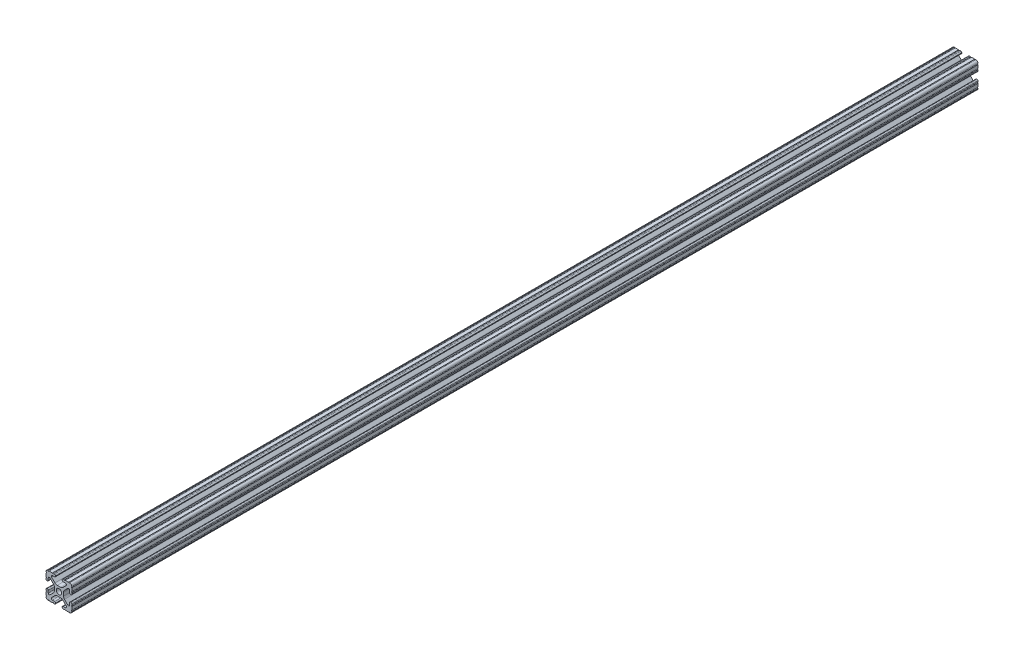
ISO-10303-21;
HEADER;
FILE_DESCRIPTION(('STEP AP214'),'2;1');
FILE_NAME('part.step','',(''),(''),'','','');
FILE_SCHEMA(('AUTOMOTIVE_DESIGN { 1 0 10303 214 1 1 1 1 }'));
ENDSEC;
DATA;
#1=APPLICATION_CONTEXT('core data for automotive mechanical design processes');
#2=APPLICATION_PROTOCOL_DEFINITION('international standard','automotive_design',2000,#1);
#3=PRODUCT_CONTEXT('',#1,'mechanical');
#4=PRODUCT('Part','Part','',(#3));
#5=PRODUCT_RELATED_PRODUCT_CATEGORY('part','',(#4));
#6=PRODUCT_DEFINITION_FORMATION('','',#4);
#7=PRODUCT_DEFINITION_CONTEXT('part definition',#1,'design');
#8=PRODUCT_DEFINITION('design','',#6,#7);
#9=PRODUCT_DEFINITION_SHAPE('','',#8);
#10=(LENGTH_UNIT() NAMED_UNIT(*) SI_UNIT(.MILLI.,.METRE.));
#11=(NAMED_UNIT(*) PLANE_ANGLE_UNIT() SI_UNIT($,.RADIAN.));
#12=(NAMED_UNIT(*) SI_UNIT($,.STERADIAN.) SOLID_ANGLE_UNIT());
#13=UNCERTAINTY_MEASURE_WITH_UNIT(LENGTH_MEASURE(1.E-05),#10,'distance_accuracy_value','');
#14=(GEOMETRIC_REPRESENTATION_CONTEXT(3) GLOBAL_UNCERTAINTY_ASSIGNED_CONTEXT((#13)) GLOBAL_UNIT_ASSIGNED_CONTEXT((#10,
#11,#12)) REPRESENTATION_CONTEXT('',''));
#15=CARTESIAN_POINT('',(0.,0.,0.));
#16=DIRECTION('',(0.,0.,1.));
#17=DIRECTION('',(1.,0.,0.));
#18=AXIS2_PLACEMENT_3D('',#15,#16,#17);
#19=CARTESIAN_POINT('',(-4.2875124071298,-10.4902000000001,927.029224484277));
#20=DIRECTION('',(0.,-1.,0.));
#21=DIRECTION('',(0.,0.,-1.));
#22=AXIS2_PLACEMENT_3D('',#19,#20,#21);
#23=PLANE('',#22);
#24=DIRECTION('',(-1.,0.,0.));
#25=VECTOR('',#24,1.);
#26=CARTESIAN_POINT('',(-4.2875124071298,-10.4902000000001,891.1082));
#27=LINE('',#26,#25);
#28=CARTESIAN_POINT('',(-4.2875124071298,-10.4902000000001,891.1082));
#29=VERTEX_POINT('',#28);
#30=CARTESIAN_POINT('',(-6.41640832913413,-10.4902000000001,891.1082));
#31=VERTEX_POINT('',#30);
#32=EDGE_CURVE('E629',#29,#31,#27,.T.);
#33=ORIENTED_EDGE('',*,*,#32,.F.);
#34=DIRECTION('',(0.,0.,-1.));
#35=VECTOR('',#34,1.);
#36=CARTESIAN_POINT('',(-4.2875124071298,-10.4902000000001,927.029224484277));
#37=LINE('',#36,#35);
#38=CARTESIAN_POINT('',(-4.2875124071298,-10.4902000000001,0.));
#39=VERTEX_POINT('',#38);
#40=EDGE_CURVE('E49',#29,#39,#37,.T.);
#41=ORIENTED_EDGE('',*,*,#40,.T.);
#42=DIRECTION('',(-1.,0.,0.));
#43=VECTOR('',#42,1.);
#44=CARTESIAN_POINT('',(-4.2875124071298,-10.4902000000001,0.));
#45=LINE('',#44,#43);
#46=CARTESIAN_POINT('',(-6.41640832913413,-10.4902000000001,0.));
#47=VERTEX_POINT('',#46);
#48=EDGE_CURVE('E632',#39,#47,#45,.T.);
#49=ORIENTED_EDGE('',*,*,#48,.T.);
#50=DIRECTION('',(0.,0.,-1.));
#51=VECTOR('',#50,1.);
#52=CARTESIAN_POINT('',(-6.41640832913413,-10.4902000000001,927.029224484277));
#53=LINE('',#52,#51);
#54=EDGE_CURVE('E626',#31,#47,#53,.T.);
#55=ORIENTED_EDGE('',*,*,#54,.F.);
#56=EDGE_LOOP('',(#33,#41,#49,#55));
#57=FACE_BOUND('',#56,.T.);
#58=ADVANCED_FACE('F33',(#57),#23,.F.);
#59=CARTESIAN_POINT('',(-4.2875124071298,-11.5392124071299,927.029224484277));
#60=DIRECTION('',(0.,0.,-1.));
#61=DIRECTION('',(-1.,0.,0.));
#62=AXIS2_PLACEMENT_3D('',#59,#60,#61);
#63=CYLINDRICAL_SURFACE('',#62,1.04901240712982);
#64=CARTESIAN_POINT('',(-4.2875124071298,-11.5392124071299,891.1082));
#65=DIRECTION('',(0.,0.,1.));
#66=DIRECTION('',(0.,-1.,0.));
#67=AXIS2_PLACEMENT_3D('',#64,#65,#66);
#68=CIRCLE('',#67,1.04901240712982);
#69=CARTESIAN_POINT('',(-3.23849999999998,-11.5392124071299,891.1082));
#70=VERTEX_POINT('',#69);
#71=EDGE_CURVE('E644',#70,#29,#68,.T.);
#72=ORIENTED_EDGE('',*,*,#71,.F.);
#73=DIRECTION('',(0.,0.,-1.));
#74=VECTOR('',#73,1.);
#75=CARTESIAN_POINT('',(-3.23849999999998,-11.5392124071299,927.029224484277));
#76=LINE('',#75,#74);
#77=CARTESIAN_POINT('',(-3.23849999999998,-11.5392124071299,0.));
#78=VERTEX_POINT('',#77);
#79=EDGE_CURVE('E1212',#70,#78,#76,.T.);
#80=ORIENTED_EDGE('',*,*,#79,.T.);
#81=CARTESIAN_POINT('',(-4.2875124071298,-11.5392124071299,0.));
#82=DIRECTION('',(0.,0.,1.));
#83=DIRECTION('',(1.,0.,0.));
#84=AXIS2_PLACEMENT_3D('',#81,#82,#83);
#85=CIRCLE('',#84,1.04901240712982);
#86=EDGE_CURVE('E1208',#78,#39,#85,.T.);
#87=ORIENTED_EDGE('',*,*,#86,.T.);
#88=ORIENTED_EDGE('',*,*,#40,.F.);
#89=EDGE_LOOP('',(#72,#80,#87,#88));
#90=FACE_BOUND('',#89,.T.);
#91=ADVANCED_FACE('F1770',(#90),#63,.T.);
#92=CARTESIAN_POINT('',(-3.23849999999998,-11.6509875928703,927.029224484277));
#93=DIRECTION('',(-1.,0.,0.));
#94=DIRECTION('',(0.,-1.,0.));
#95=AXIS2_PLACEMENT_3D('',#92,#93,#94);
#96=PLANE('',#95);
#97=DIRECTION('',(0.,1.,0.));
#98=VECTOR('',#97,1.);
#99=CARTESIAN_POINT('',(-3.23849999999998,-11.6509875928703,891.1082));
#100=LINE('',#99,#98);
#101=CARTESIAN_POINT('',(-3.23849999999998,-11.6509875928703,891.1082));
#102=VERTEX_POINT('',#101);
#103=EDGE_CURVE('E646',#102,#70,#100,.T.);
#104=ORIENTED_EDGE('',*,*,#103,.F.);
#105=DIRECTION('',(0.,0.,-1.));
#106=VECTOR('',#105,1.);
#107=CARTESIAN_POINT('',(-3.23849999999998,-11.6509875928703,927.029224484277));
#108=LINE('',#107,#106);
#109=CARTESIAN_POINT('',(-3.23849999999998,-11.6509875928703,0.));
#110=VERTEX_POINT('',#109);
#111=EDGE_CURVE('E1214',#102,#110,#108,.T.);
#112=ORIENTED_EDGE('',*,*,#111,.T.);
#113=DIRECTION('',(0.,1.,0.));
#114=VECTOR('',#113,1.);
#115=CARTESIAN_POINT('',(-3.23849999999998,-11.6509875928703,0.));
#116=LINE('',#115,#114);
#117=EDGE_CURVE('E1205',#110,#78,#116,.T.);
#118=ORIENTED_EDGE('',*,*,#117,.T.);
#119=ORIENTED_EDGE('',*,*,#79,.F.);
#120=EDGE_LOOP('',(#104,#112,#118,#119));
#121=FACE_BOUND('',#120,.T.);
#122=ADVANCED_FACE('F1767',(#121),#96,.F.);
#123=CARTESIAN_POINT('',(-4.2875124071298,-11.6509875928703,927.029224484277));
#124=DIRECTION('',(0.,0.,-1.));
#125=DIRECTION('',(-1.,0.,0.));
#126=AXIS2_PLACEMENT_3D('',#123,#124,#125);
#127=CYLINDRICAL_SURFACE('',#126,1.04901240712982);
#128=CARTESIAN_POINT('',(-4.2875124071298,-11.6509875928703,891.1082));
#129=DIRECTION('',(0.,0.,1.));
#130=DIRECTION('',(0.,-1.,0.));
#131=AXIS2_PLACEMENT_3D('',#128,#129,#130);
#132=CIRCLE('',#131,1.04901240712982);
#133=CARTESIAN_POINT('',(-4.2875124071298,-12.7000000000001,891.1082));
#134=VERTEX_POINT('',#133);
#135=EDGE_CURVE('E651',#134,#102,#132,.T.);
#136=ORIENTED_EDGE('',*,*,#135,.F.);
#137=DIRECTION('',(0.,0.,-1.));
#138=VECTOR('',#137,1.);
#139=CARTESIAN_POINT('',(-4.2875124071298,-12.7000000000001,927.029224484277));
#140=LINE('',#139,#138);
#141=CARTESIAN_POINT('',(-4.2875124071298,-12.7000000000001,0.));
#142=VERTEX_POINT('',#141);
#143=EDGE_CURVE('E1216',#134,#142,#140,.T.);
#144=ORIENTED_EDGE('',*,*,#143,.T.);
#145=CARTESIAN_POINT('',(-4.2875124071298,-11.6509875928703,0.));
#146=DIRECTION('',(0.,0.,1.));
#147=DIRECTION('',(1.,0.,0.));
#148=AXIS2_PLACEMENT_3D('',#145,#146,#147);
#149=CIRCLE('',#148,1.04901240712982);
#150=EDGE_CURVE('E1202',#142,#110,#149,.T.);
#151=ORIENTED_EDGE('',*,*,#150,.T.);
#152=ORIENTED_EDGE('',*,*,#111,.F.);
#153=EDGE_LOOP('',(#136,#144,#151,#152));
#154=FACE_BOUND('',#153,.T.);
#155=ADVANCED_FACE('F1763',(#154),#127,.T.);
#156=CARTESIAN_POINT('',(-5.31712671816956,-12.7000000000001,927.029224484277));
#157=DIRECTION('',(0.,1.,0.));
#158=DIRECTION('',(-1.,0.,0.));
#159=AXIS2_PLACEMENT_3D('',#156,#157,#158);
#160=PLANE('',#159);
#161=DIRECTION('',(1.,0.,0.));
#162=VECTOR('',#161,1.);
#163=CARTESIAN_POINT('',(-5.31712671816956,-12.7000000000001,891.1082));
#164=LINE('',#163,#162);
#165=CARTESIAN_POINT('',(-5.31712671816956,-12.7000000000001,891.1082));
#166=VERTEX_POINT('',#165);
#167=EDGE_CURVE('E654',#166,#134,#164,.T.);
#168=ORIENTED_EDGE('',*,*,#167,.F.);
#169=DIRECTION('',(0.,0.,-1.));
#170=VECTOR('',#169,1.);
#171=CARTESIAN_POINT('',(-5.31712671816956,-12.7000000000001,927.029224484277));
#172=LINE('',#171,#170);
#173=CARTESIAN_POINT('',(-5.31712671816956,-12.7000000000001,0.));
#174=VERTEX_POINT('',#173);
#175=EDGE_CURVE('E1218',#166,#174,#172,.T.);
#176=ORIENTED_EDGE('',*,*,#175,.T.);
#177=DIRECTION('',(1.,0.,0.));
#178=VECTOR('',#177,1.);
#179=CARTESIAN_POINT('',(-5.31712671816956,-12.7000000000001,0.));
#180=LINE('',#179,#178);
#181=EDGE_CURVE('E1199',#174,#142,#180,.T.);
#182=ORIENTED_EDGE('',*,*,#181,.T.);
#183=ORIENTED_EDGE('',*,*,#143,.F.);
#184=EDGE_LOOP('',(#168,#176,#182,#183));
#185=FACE_BOUND('',#184,.T.);
#186=ADVANCED_FACE('F1760',(#185),#160,.F.);
#187=CARTESIAN_POINT('',(-5.82512671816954,-12.7000000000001,927.029224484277));
#188=DIRECTION('',(0.,0.,-1.));
#189=DIRECTION('',(-1.,0.,0.));
#190=AXIS2_PLACEMENT_3D('',#187,#188,#189);
#191=CYLINDRICAL_SURFACE('',#190,0.507999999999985);
#192=CARTESIAN_POINT('',(-5.82512671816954,-12.7000000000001,891.1082));
#193=DIRECTION('',(0.,0.,1.));
#194=DIRECTION('',(0.,-1.,0.));
#195=AXIS2_PLACEMENT_3D('',#192,#193,#194);
#196=CIRCLE('',#195,0.507999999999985);
#197=CARTESIAN_POINT('',(-6.33312671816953,-12.7000000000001,891.1082));
#198=VERTEX_POINT('',#197);
#199=EDGE_CURVE('E657',#198,#166,#196,.F.);
#200=ORIENTED_EDGE('',*,*,#199,.F.);
#201=DIRECTION('',(0.,0.,-1.));
#202=VECTOR('',#201,1.);
#203=CARTESIAN_POINT('',(-6.33312671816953,-12.7000000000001,927.029224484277));
#204=LINE('',#203,#202);
#205=CARTESIAN_POINT('',(-6.33312671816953,-12.7000000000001,0.));
#206=VERTEX_POINT('',#205);
#207=EDGE_CURVE('E1220',#198,#206,#204,.T.);
#208=ORIENTED_EDGE('',*,*,#207,.T.);
#209=CARTESIAN_POINT('',(-5.82512671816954,-12.7000000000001,0.));
#210=DIRECTION('',(0.,0.,-1.));
#211=DIRECTION('',(1.,0.,0.));
#212=AXIS2_PLACEMENT_3D('',#209,#210,#211);
#213=CIRCLE('',#212,0.507999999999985);
#214=EDGE_CURVE('E1196',#206,#174,#213,.T.);
#215=ORIENTED_EDGE('',*,*,#214,.T.);
#216=ORIENTED_EDGE('',*,*,#175,.F.);
#217=EDGE_LOOP('',(#200,#208,#215,#216));
#218=FACE_BOUND('',#217,.T.);
#219=ADVANCED_FACE('F1755',(#218),#191,.F.);
#220=CARTESIAN_POINT('',(-9.55044311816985,-12.7000000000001,927.029224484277));
#221=DIRECTION('',(0.,1.,0.));
#222=DIRECTION('',(0.,0.,1.));
#223=AXIS2_PLACEMENT_3D('',#220,#221,#222);
#224=PLANE('',#223);
#225=DIRECTION('',(1.,0.,0.));
#226=VECTOR('',#225,1.);
#227=CARTESIAN_POINT('',(-9.55044311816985,-12.7000000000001,891.1082));
#228=LINE('',#227,#226);
#229=CARTESIAN_POINT('',(-9.55044311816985,-12.7000000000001,891.1082));
#230=VERTEX_POINT('',#229);
#231=EDGE_CURVE('E660',#230,#198,#228,.T.);
#232=ORIENTED_EDGE('',*,*,#231,.F.);
#233=DIRECTION('',(0.,0.,-1.));
#234=VECTOR('',#233,1.);
#235=CARTESIAN_POINT('',(-9.55044311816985,-12.7000000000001,927.029224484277));
#236=LINE('',#235,#234);
#237=CARTESIAN_POINT('',(-9.55044311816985,-12.7000000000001,0.));
#238=VERTEX_POINT('',#237);
#239=EDGE_CURVE('E1222',#230,#238,#236,.T.);
#240=ORIENTED_EDGE('',*,*,#239,.T.);
#241=DIRECTION('',(1.,0.,0.));
#242=VECTOR('',#241,1.);
#243=CARTESIAN_POINT('',(-9.55044311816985,-12.7000000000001,0.));
#244=LINE('',#243,#242);
#245=EDGE_CURVE('E1193',#238,#206,#244,.T.);
#246=ORIENTED_EDGE('',*,*,#245,.T.);
#247=ORIENTED_EDGE('',*,*,#207,.F.);
#248=EDGE_LOOP('',(#232,#240,#246,#247));
#249=FACE_BOUND('',#248,.T.);
#250=ADVANCED_FACE('F1751',(#249),#224,.F.);
#251=CARTESIAN_POINT('',(-10.0584431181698,-12.7000000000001,927.029224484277));
#252=DIRECTION('',(0.,0.,-1.));
#253=DIRECTION('',(-1.,0.,0.));
#254=AXIS2_PLACEMENT_3D('',#251,#252,#253);
#255=CYLINDRICAL_SURFACE('',#254,0.507999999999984);
#256=CARTESIAN_POINT('',(-10.0584431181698,-12.7000000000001,891.1082));
#257=DIRECTION('',(0.,0.,1.));
#258=DIRECTION('',(0.,-1.,0.));
#259=AXIS2_PLACEMENT_3D('',#256,#257,#258);
#260=CIRCLE('',#259,0.507999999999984);
#261=CARTESIAN_POINT('',(-10.5664430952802,-12.6998475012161,891.1082));
#262=VERTEX_POINT('',#261);
#263=EDGE_CURVE('E663',#262,#230,#260,.F.);
#264=ORIENTED_EDGE('',*,*,#263,.F.);
#265=DIRECTION('',(0.,0.,-1.));
#266=VECTOR('',#265,1.);
#267=CARTESIAN_POINT('',(-10.5664430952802,-12.6998475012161,927.029224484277));
#268=LINE('',#267,#266);
#269=CARTESIAN_POINT('',(-10.5664430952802,-12.6998475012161,0.));
#270=VERTEX_POINT('',#269);
#271=EDGE_CURVE('E1224',#262,#270,#268,.T.);
#272=ORIENTED_EDGE('',*,*,#271,.T.);
#273=CARTESIAN_POINT('',(-10.0584431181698,-12.7000000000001,0.));
#274=DIRECTION('',(0.,0.,-1.));
#275=DIRECTION('',(1.,0.,0.));
#276=AXIS2_PLACEMENT_3D('',#273,#274,#275);
#277=CIRCLE('',#276,0.507999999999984);
#278=EDGE_CURVE('E1190',#270,#238,#277,.T.);
#279=ORIENTED_EDGE('',*,*,#278,.T.);
#280=ORIENTED_EDGE('',*,*,#239,.F.);
#281=EDGE_LOOP('',(#264,#272,#279,#280));
#282=FACE_BOUND('',#281,.T.);
#283=ADVANCED_FACE('F1748',(#282),#255,.F.);
#284=CARTESIAN_POINT('',(-10.5918000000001,-10.5918000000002,927.029224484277));
#285=DIRECTION('',(0.,0.,-1.));
#286=DIRECTION('',(-1.,0.,0.));
#287=AXIS2_PLACEMENT_3D('',#284,#285,#286);
#288=CYLINDRICAL_SURFACE('',#287,2.1081999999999);
#289=CARTESIAN_POINT('',(-10.5918000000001,-10.5918000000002,891.1082));
#290=DIRECTION('',(0.,0.,1.));
#291=DIRECTION('',(0.,-1.,0.));
#292=AXIS2_PLACEMENT_3D('',#289,#290,#291);
#293=CIRCLE('',#292,2.1081999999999);
#294=CARTESIAN_POINT('',(-12.699846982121,-10.5663999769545,891.1082));
#295=VERTEX_POINT('',#294);
#296=EDGE_CURVE('E666',#295,#262,#293,.T.);
#297=ORIENTED_EDGE('',*,*,#296,.F.);
#298=DIRECTION('',(0.,0.,-1.));
#299=VECTOR('',#298,1.);
#300=CARTESIAN_POINT('',(-12.699846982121,-10.5663999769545,927.029224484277));
#301=LINE('',#300,#299);
#302=CARTESIAN_POINT('',(-12.699846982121,-10.5663999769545,0.));
#303=VERTEX_POINT('',#302);
#304=EDGE_CURVE('E1226',#295,#303,#301,.T.);
#305=ORIENTED_EDGE('',*,*,#304,.T.);
#306=CARTESIAN_POINT('',(-10.5918000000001,-10.5918000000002,0.));
#307=DIRECTION('',(0.,0.,1.));
#308=DIRECTION('',(1.,0.,0.));
#309=AXIS2_PLACEMENT_3D('',#306,#307,#308);
#310=CIRCLE('',#309,2.1081999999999);
#311=EDGE_CURVE('E1187',#303,#270,#310,.T.);
#312=ORIENTED_EDGE('',*,*,#311,.T.);
#313=ORIENTED_EDGE('',*,*,#271,.F.);
#314=EDGE_LOOP('',(#297,#305,#312,#313));
#315=FACE_BOUND('',#314,.T.);
#316=ADVANCED_FACE('F1743',(#315),#288,.T.);
#317=CARTESIAN_POINT('',(-12.7,-10.0584000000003,927.029224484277));
#318=DIRECTION('',(0.,0.,-1.));
#319=DIRECTION('',(-1.,0.,0.));
#320=AXIS2_PLACEMENT_3D('',#317,#318,#319);
#321=CYLINDRICAL_SURFACE('',#320,0.507999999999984);
#322=CARTESIAN_POINT('',(-12.7,-10.0584000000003,891.1082));
#323=DIRECTION('',(0.,0.,1.));
#324=DIRECTION('',(0.,-1.,0.));
#325=AXIS2_PLACEMENT_3D('',#322,#323,#324);
#326=CIRCLE('',#325,0.507999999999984);
#327=CARTESIAN_POINT('',(-12.7,-9.5504000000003,891.1082));
#328=VERTEX_POINT('',#327);
#329=EDGE_CURVE('E669',#328,#295,#326,.F.);
#330=ORIENTED_EDGE('',*,*,#329,.F.);
#331=DIRECTION('',(0.,0.,-1.));
#332=VECTOR('',#331,1.);
#333=CARTESIAN_POINT('',(-12.7,-9.5504000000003,927.029224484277));
#334=LINE('',#333,#332);
#335=CARTESIAN_POINT('',(-12.7,-9.5504000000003,0.));
#336=VERTEX_POINT('',#335);
#337=EDGE_CURVE('E1228',#328,#336,#334,.T.);
#338=ORIENTED_EDGE('',*,*,#337,.T.);
#339=CARTESIAN_POINT('',(-12.7,-10.0584000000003,0.));
#340=DIRECTION('',(0.,0.,-1.));
#341=DIRECTION('',(1.,0.,0.));
#342=AXIS2_PLACEMENT_3D('',#339,#340,#341);
#343=CIRCLE('',#342,0.507999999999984);
#344=EDGE_CURVE('E1184',#336,#303,#343,.T.);
#345=ORIENTED_EDGE('',*,*,#344,.T.);
#346=ORIENTED_EDGE('',*,*,#304,.F.);
#347=EDGE_LOOP('',(#330,#338,#345,#346));
#348=FACE_BOUND('',#347,.T.);
#349=ADVANCED_FACE('F1739',(#348),#321,.F.);
#350=CARTESIAN_POINT('',(-12.7,-6.33308359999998,927.029224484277));
#351=DIRECTION('',(1.,0.,0.));
#352=DIRECTION('',(0.,1.,0.));
#353=AXIS2_PLACEMENT_3D('',#350,#351,#352);
#354=PLANE('',#353);
#355=DIRECTION('',(0.,-1.,0.));
#356=VECTOR('',#355,1.);
#357=CARTESIAN_POINT('',(-12.7,-6.33308359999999,891.1082));
#358=LINE('',#357,#356);
#359=CARTESIAN_POINT('',(-12.7,-6.33308359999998,891.1082));
#360=VERTEX_POINT('',#359);
#361=EDGE_CURVE('E672',#360,#328,#358,.T.);
#362=ORIENTED_EDGE('',*,*,#361,.F.);
#363=DIRECTION('',(0.,0.,-1.));
#364=VECTOR('',#363,1.);
#365=CARTESIAN_POINT('',(-12.7,-6.33308359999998,927.029224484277));
#366=LINE('',#365,#364);
#367=CARTESIAN_POINT('',(-12.7,-6.33308359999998,0.));
#368=VERTEX_POINT('',#367);
#369=EDGE_CURVE('E1230',#360,#368,#366,.T.);
#370=ORIENTED_EDGE('',*,*,#369,.T.);
#371=DIRECTION('',(0.,-1.,0.));
#372=VECTOR('',#371,1.);
#373=CARTESIAN_POINT('',(-12.7,-6.33308359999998,0.));
#374=LINE('',#373,#372);
#375=EDGE_CURVE('E1181',#368,#336,#374,.T.);
#376=ORIENTED_EDGE('',*,*,#375,.T.);
#377=ORIENTED_EDGE('',*,*,#337,.F.);
#378=EDGE_LOOP('',(#362,#370,#376,#377));
#379=FACE_BOUND('',#378,.T.);
#380=ADVANCED_FACE('F1736',(#379),#354,.F.);
#381=CARTESIAN_POINT('',(-12.7,-5.8250836,927.029224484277));
#382=DIRECTION('',(0.,0.,-1.));
#383=DIRECTION('',(-1.,0.,0.));
#384=AXIS2_PLACEMENT_3D('',#381,#382,#383);
#385=CYLINDRICAL_SURFACE('',#384,0.507999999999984);
#386=CARTESIAN_POINT('',(-12.7,-5.8250836,891.1082));
#387=DIRECTION('',(0.,0.,1.));
#388=DIRECTION('',(0.,-1.,0.));
#389=AXIS2_PLACEMENT_3D('',#386,#387,#388);
#390=CIRCLE('',#389,0.507999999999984);
#391=CARTESIAN_POINT('',(-12.7,-5.31708360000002,891.1082));
#392=VERTEX_POINT('',#391);
#393=EDGE_CURVE('E675',#392,#360,#390,.F.);
#394=ORIENTED_EDGE('',*,*,#393,.F.);
#395=DIRECTION('',(0.,0.,-1.));
#396=VECTOR('',#395,1.);
#397=CARTESIAN_POINT('',(-12.7,-5.31708360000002,927.029224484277));
#398=LINE('',#397,#396);
#399=CARTESIAN_POINT('',(-12.7,-5.31708360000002,0.));
#400=VERTEX_POINT('',#399);
#401=EDGE_CURVE('E1232',#392,#400,#398,.T.);
#402=ORIENTED_EDGE('',*,*,#401,.T.);
#403=CARTESIAN_POINT('',(-12.7,-5.8250836,0.));
#404=DIRECTION('',(0.,0.,-1.));
#405=DIRECTION('',(1.,0.,0.));
#406=AXIS2_PLACEMENT_3D('',#403,#404,#405);
#407=CIRCLE('',#406,0.507999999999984);
#408=EDGE_CURVE('E1178',#400,#368,#407,.T.);
#409=ORIENTED_EDGE('',*,*,#408,.T.);
#410=ORIENTED_EDGE('',*,*,#369,.F.);
#411=EDGE_LOOP('',(#394,#402,#409,#410));
#412=FACE_BOUND('',#411,.T.);
#413=ADVANCED_FACE('F1731',(#412),#385,.F.);
#414=CARTESIAN_POINT('',(-12.7,-4.28746928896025,927.029224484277));
#415=DIRECTION('',(1.,0.,0.));
#416=DIRECTION('',(0.,1.,0.));
#417=AXIS2_PLACEMENT_3D('',#414,#415,#416);
#418=PLANE('',#417);
#419=DIRECTION('',(0.,-1.,0.));
#420=VECTOR('',#419,1.);
#421=CARTESIAN_POINT('',(-12.7,-4.28746928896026,891.1082));
#422=LINE('',#421,#420);
#423=CARTESIAN_POINT('',(-12.7,-4.28746928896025,891.1082));
#424=VERTEX_POINT('',#423);
#425=EDGE_CURVE('E678',#424,#392,#422,.T.);
#426=ORIENTED_EDGE('',*,*,#425,.F.);
#427=DIRECTION('',(0.,0.,-1.));
#428=VECTOR('',#427,1.);
#429=CARTESIAN_POINT('',(-12.7,-4.28746928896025,927.029224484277));
#430=LINE('',#429,#428);
#431=CARTESIAN_POINT('',(-12.7,-4.28746928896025,0.));
#432=VERTEX_POINT('',#431);
#433=EDGE_CURVE('E1234',#424,#432,#430,.T.);
#434=ORIENTED_EDGE('',*,*,#433,.T.);
#435=DIRECTION('',(0.,-1.,0.));
#436=VECTOR('',#435,1.);
#437=CARTESIAN_POINT('',(-12.7,-4.28746928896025,0.));
#438=LINE('',#437,#436);
#439=EDGE_CURVE('E1175',#432,#400,#438,.T.);
#440=ORIENTED_EDGE('',*,*,#439,.T.);
#441=ORIENTED_EDGE('',*,*,#401,.F.);
#442=EDGE_LOOP('',(#426,#434,#440,#441));
#443=FACE_BOUND('',#442,.T.);
#444=ADVANCED_FACE('F1727',(#443),#418,.F.);
#445=CARTESIAN_POINT('',(-11.6509875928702,-4.28746928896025,927.029224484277));
#446=DIRECTION('',(0.,0.,-1.));
#447=DIRECTION('',(-1.,0.,0.));
#448=AXIS2_PLACEMENT_3D('',#445,#446,#447);
#449=CYLINDRICAL_SURFACE('',#448,1.04901240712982);
#450=CARTESIAN_POINT('',(-11.6509875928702,-4.28746928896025,891.1082));
#451=DIRECTION('',(0.,0.,1.));
#452=DIRECTION('',(0.,-1.,0.));
#453=AXIS2_PLACEMENT_3D('',#450,#451,#452);
#454=CIRCLE('',#453,1.04901240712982);
#455=CARTESIAN_POINT('',(-11.6509875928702,-3.23845688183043,891.1082));
#456=VERTEX_POINT('',#455);
#457=EDGE_CURVE('E681',#456,#424,#454,.T.);
#458=ORIENTED_EDGE('',*,*,#457,.F.);
#459=DIRECTION('',(0.,0.,-1.));
#460=VECTOR('',#459,1.);
#461=CARTESIAN_POINT('',(-11.6509875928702,-3.23845688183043,927.029224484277));
#462=LINE('',#461,#460);
#463=CARTESIAN_POINT('',(-11.6509875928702,-3.23845688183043,0.));
#464=VERTEX_POINT('',#463);
#465=EDGE_CURVE('E1236',#456,#464,#462,.T.);
#466=ORIENTED_EDGE('',*,*,#465,.T.);
#467=CARTESIAN_POINT('',(-11.6509875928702,-4.28746928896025,0.));
#468=DIRECTION('',(0.,0.,1.));
#469=DIRECTION('',(1.,0.,0.));
#470=AXIS2_PLACEMENT_3D('',#467,#468,#469);
#471=CIRCLE('',#470,1.04901240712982);
#472=EDGE_CURVE('E1172',#464,#432,#471,.T.);
#473=ORIENTED_EDGE('',*,*,#472,.T.);
#474=ORIENTED_EDGE('',*,*,#433,.F.);
#475=EDGE_LOOP('',(#458,#466,#473,#474));
#476=FACE_BOUND('',#475,.T.);
#477=ADVANCED_FACE('F1724',(#476),#449,.T.);
#478=CARTESIAN_POINT('',(-11.5392124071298,-3.23845688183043,927.029224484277));
#479=DIRECTION('',(0.,-1.,0.));
#480=DIRECTION('',(0.,0.,-1.));
#481=AXIS2_PLACEMENT_3D('',#478,#479,#480);
#482=PLANE('',#481);
#483=DIRECTION('',(-1.,0.,0.));
#484=VECTOR('',#483,1.);
#485=CARTESIAN_POINT('',(-11.5392124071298,-3.23845688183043,891.1082));
#486=LINE('',#485,#484);
#487=CARTESIAN_POINT('',(-11.5392124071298,-3.23845688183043,891.1082));
#488=VERTEX_POINT('',#487);
#489=EDGE_CURVE('E684',#488,#456,#486,.T.);
#490=ORIENTED_EDGE('',*,*,#489,.F.);
#491=DIRECTION('',(0.,0.,-1.));
#492=VECTOR('',#491,1.);
#493=CARTESIAN_POINT('',(-11.5392124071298,-3.23845688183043,927.029224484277));
#494=LINE('',#493,#492);
#495=CARTESIAN_POINT('',(-11.5392124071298,-3.23845688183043,0.));
#496=VERTEX_POINT('',#495);
#497=EDGE_CURVE('E1238',#488,#496,#494,.T.);
#498=ORIENTED_EDGE('',*,*,#497,.T.);
#499=DIRECTION('',(-1.,0.,0.));
#500=VECTOR('',#499,1.);
#501=CARTESIAN_POINT('',(-11.5392124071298,-3.23845688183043,0.));
#502=LINE('',#501,#500);
#503=EDGE_CURVE('E1169',#496,#464,#502,.T.);
#504=ORIENTED_EDGE('',*,*,#503,.T.);
#505=ORIENTED_EDGE('',*,*,#465,.F.);
#506=EDGE_LOOP('',(#490,#498,#504,#505));
#507=FACE_BOUND('',#506,.T.);
#508=ADVANCED_FACE('F1719',(#507),#482,.F.);
#509=CARTESIAN_POINT('',(-11.5392124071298,-4.28746928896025,927.029224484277));
#510=DIRECTION('',(0.,0.,-1.));
#511=DIRECTION('',(-1.,0.,0.));
#512=AXIS2_PLACEMENT_3D('',#509,#510,#511);
#513=CYLINDRICAL_SURFACE('',#512,1.04901240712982);
#514=CARTESIAN_POINT('',(-11.5392124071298,-4.28746928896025,891.1082));
#515=DIRECTION('',(0.,0.,1.));
#516=DIRECTION('',(0.,-1.,0.));
#517=AXIS2_PLACEMENT_3D('',#514,#515,#516);
#518=CIRCLE('',#517,1.04901240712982);
#519=CARTESIAN_POINT('',(-10.4902,-4.28746928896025,891.1082));
#520=VERTEX_POINT('',#519);
#521=EDGE_CURVE('E687',#520,#488,#518,.T.);
#522=ORIENTED_EDGE('',*,*,#521,.F.);
#523=DIRECTION('',(0.,0.,-1.));
#524=VECTOR('',#523,1.);
#525=CARTESIAN_POINT('',(-10.4902,-4.28746928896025,927.029224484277));
#526=LINE('',#525,#524);
#527=CARTESIAN_POINT('',(-10.4902,-4.28746928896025,0.));
#528=VERTEX_POINT('',#527);
#529=EDGE_CURVE('E1240',#520,#528,#526,.T.);
#530=ORIENTED_EDGE('',*,*,#529,.T.);
#531=CARTESIAN_POINT('',(-11.5392124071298,-4.28746928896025,0.));
#532=DIRECTION('',(0.,0.,1.));
#533=DIRECTION('',(1.,0.,0.));
#534=AXIS2_PLACEMENT_3D('',#531,#532,#533);
#535=CIRCLE('',#534,1.04901240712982);
#536=EDGE_CURVE('E1166',#528,#496,#535,.T.);
#537=ORIENTED_EDGE('',*,*,#536,.T.);
#538=ORIENTED_EDGE('',*,*,#497,.F.);
#539=EDGE_LOOP('',(#522,#530,#537,#538));
#540=FACE_BOUND('',#539,.T.);
#541=ADVANCED_FACE('F1715',(#540),#513,.T.);
#542=CARTESIAN_POINT('',(-10.4902,-6.4020890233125,927.029224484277));
#543=DIRECTION('',(-1.,0.,0.));
#544=DIRECTION('',(0.,0.,1.));
#545=AXIS2_PLACEMENT_3D('',#542,#543,#544);
#546=PLANE('',#545);
#547=DIRECTION('',(0.,1.,0.));
#548=VECTOR('',#547,1.);
#549=CARTESIAN_POINT('',(-10.4902,-6.40208902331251,891.1082));
#550=LINE('',#549,#548);
#551=CARTESIAN_POINT('',(-10.4902,-6.4020890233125,891.1082));
#552=VERTEX_POINT('',#551);
#553=EDGE_CURVE('E690',#552,#520,#550,.T.);
#554=ORIENTED_EDGE('',*,*,#553,.F.);
#555=DIRECTION('',(0.,0.,-1.));
#556=VECTOR('',#555,1.);
#557=CARTESIAN_POINT('',(-10.4902,-6.4020890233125,927.029224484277));
#558=LINE('',#557,#556);
#559=CARTESIAN_POINT('',(-10.4902,-6.4020890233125,0.));
#560=VERTEX_POINT('',#559);
#561=EDGE_CURVE('E1242',#552,#560,#558,.T.);
#562=ORIENTED_EDGE('',*,*,#561,.T.);
#563=DIRECTION('',(0.,1.,0.));
#564=VECTOR('',#563,1.);
#565=CARTESIAN_POINT('',(-10.4902,-6.4020890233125,0.));
#566=LINE('',#565,#564);
#567=EDGE_CURVE('E1163',#560,#528,#566,.T.);
#568=ORIENTED_EDGE('',*,*,#567,.T.);
#569=ORIENTED_EDGE('',*,*,#529,.F.);
#570=EDGE_LOOP('',(#554,#562,#568,#569));
#571=FACE_BOUND('',#570,.T.);
#572=ADVANCED_FACE('F1712',(#571),#546,.F.);
#573=CARTESIAN_POINT('',(-9.4627890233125,-6.4020890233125,927.029224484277));
#574=DIRECTION('',(0.,0.,-1.));
#575=DIRECTION('',(-1.,0.,0.));
#576=AXIS2_PLACEMENT_3D('',#573,#574,#575);
#577=CYLINDRICAL_SURFACE('',#576,1.0274109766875);
#578=CARTESIAN_POINT('',(-9.4627890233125,-6.4020890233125,891.1082));
#579=DIRECTION('',(0.,0.,1.));
#580=DIRECTION('',(0.,-1.,0.));
#581=AXIS2_PLACEMENT_3D('',#578,#579,#580);
#582=CIRCLE('',#581,1.0274109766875);
#583=CARTESIAN_POINT('',(-8.7371313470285,-7.12940893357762,891.1082));
#584=VERTEX_POINT('',#583);
#585=EDGE_CURVE('E693',#584,#552,#582,.F.);
#586=ORIENTED_EDGE('',*,*,#585,.F.);
#587=DIRECTION('',(0.,0.,-1.));
#588=VECTOR('',#587,1.);
#589=CARTESIAN_POINT('',(-8.7371313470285,-7.12940893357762,927.029224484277));
#590=LINE('',#589,#588);
#591=CARTESIAN_POINT('',(-8.7371313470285,-7.12940893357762,0.));
#592=VERTEX_POINT('',#591);
#593=EDGE_CURVE('E1244',#584,#592,#590,.T.);
#594=ORIENTED_EDGE('',*,*,#593,.T.);
#595=CARTESIAN_POINT('',(-9.4627890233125,-6.4020890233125,0.));
#596=DIRECTION('',(0.,0.,-1.));
#597=DIRECTION('',(1.,0.,0.));
#598=AXIS2_PLACEMENT_3D('',#595,#596,#597);
#599=CIRCLE('',#598,1.0274109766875);
#600=EDGE_CURVE('E1160',#592,#560,#599,.T.);
#601=ORIENTED_EDGE('',*,*,#600,.T.);
#602=ORIENTED_EDGE('',*,*,#561,.F.);
#603=EDGE_LOOP('',(#586,#594,#601,#602));
#604=FACE_BOUND('',#603,.T.);
#605=ADVANCED_FACE('F1707',(#604),#577,.F.);
#606=CARTESIAN_POINT('',(-5.44100583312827,-3.84081646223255,927.029224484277));
#607=DIRECTION('',(0.706297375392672,-0.707915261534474,0.));
#608=DIRECTION('',(0.707915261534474,0.706297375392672,0.));
#609=AXIS2_PLACEMENT_3D('',#606,#607,#608);
#610=PLANE('',#609);
#611=DIRECTION('',(-0.707915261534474,-0.706297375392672,0.));
#612=VECTOR('',#611,1.);
#613=CARTESIAN_POINT('',(-5.44100583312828,-3.84081646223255,891.1082));
#614=LINE('',#613,#612);
#615=CARTESIAN_POINT('',(-5.44100583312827,-3.84081646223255,891.1082));
#616=VERTEX_POINT('',#615);
#617=EDGE_CURVE('E696',#616,#584,#614,.T.);
#618=ORIENTED_EDGE('',*,*,#617,.F.);
#619=DIRECTION('',(0.,0.,-1.));
#620=VECTOR('',#619,1.);
#621=CARTESIAN_POINT('',(-5.44100583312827,-3.84081646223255,927.029224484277));
#622=LINE('',#621,#620);
#623=CARTESIAN_POINT('',(-5.44100583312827,-3.84081646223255,0.));
#624=VERTEX_POINT('',#623);
#625=EDGE_CURVE('E1246',#616,#624,#622,.T.);
#626=ORIENTED_EDGE('',*,*,#625,.T.);
#627=DIRECTION('',(-0.707915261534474,-0.706297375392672,0.));
#628=VECTOR('',#627,1.);
#629=CARTESIAN_POINT('',(-5.44100583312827,-3.84081646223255,0.));
#630=LINE('',#629,#628);
#631=EDGE_CURVE('E1157',#624,#592,#630,.T.);
#632=ORIENTED_EDGE('',*,*,#631,.T.);
#633=ORIENTED_EDGE('',*,*,#593,.F.);
#634=EDGE_LOOP('',(#618,#626,#632,#633));
#635=FACE_BOUND('',#634,.T.);
#636=ADVANCED_FACE('F1703',(#635),#610,.F.);
#637=CARTESIAN_POINT('',(-7.68350000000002,-1.59318550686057,927.029224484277));
#638=DIRECTION('',(0.,0.,-1.));
#639=DIRECTION('',(-1.,0.,0.));
#640=AXIS2_PLACEMENT_3D('',#637,#638,#639);
#641=CYLINDRICAL_SURFACE('',#640,3.17500000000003);
#642=CARTESIAN_POINT('',(-7.68350000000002,-1.59318550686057,891.1082));
#643=DIRECTION('',(0.,0.,1.));
#644=DIRECTION('',(0.,-1.,0.));
#645=AXIS2_PLACEMENT_3D('',#642,#643,#644);
#646=CIRCLE('',#645,3.17500000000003);
#647=CARTESIAN_POINT('',(-4.5085,-1.59318550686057,891.1082));
#648=VERTEX_POINT('',#647);
#649=EDGE_CURVE('E699',#648,#616,#646,.F.);
#650=ORIENTED_EDGE('',*,*,#649,.F.);
#651=DIRECTION('',(0.,0.,-1.));
#652=VECTOR('',#651,1.);
#653=CARTESIAN_POINT('',(-4.5085,-1.59318550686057,927.029224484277));
#654=LINE('',#653,#652);
#655=CARTESIAN_POINT('',(-4.5085,-1.59318550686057,0.));
#656=VERTEX_POINT('',#655);
#657=EDGE_CURVE('E1248',#648,#656,#654,.T.);
#658=ORIENTED_EDGE('',*,*,#657,.T.);
#659=CARTESIAN_POINT('',(-7.68350000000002,-1.59318550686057,0.));
#660=DIRECTION('',(0.,0.,-1.));
#661=DIRECTION('',(1.,0.,0.));
#662=AXIS2_PLACEMENT_3D('',#659,#660,#661);
#663=CIRCLE('',#662,3.17500000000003);
#664=EDGE_CURVE('E1154',#656,#624,#663,.T.);
#665=ORIENTED_EDGE('',*,*,#664,.T.);
#666=ORIENTED_EDGE('',*,*,#625,.F.);
#667=EDGE_LOOP('',(#650,#658,#665,#666));
#668=FACE_BOUND('',#667,.T.);
#669=ADVANCED_FACE('F1700',(#668),#641,.F.);
#670=CARTESIAN_POINT('',(-4.5085,1.59318550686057,927.029224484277));
#671=DIRECTION('',(1.,0.,0.));
#672=DIRECTION('',(0.,1.,0.));
#673=AXIS2_PLACEMENT_3D('',#670,#671,#672);
#674=PLANE('',#673);
#675=DIRECTION('',(0.,-1.,0.));
#676=VECTOR('',#675,1.);
#677=CARTESIAN_POINT('',(-4.5085,1.59318550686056,891.1082));
#678=LINE('',#677,#676);
#679=CARTESIAN_POINT('',(-4.50850000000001,1.59318550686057,891.1082));
#680=VERTEX_POINT('',#679);
#681=EDGE_CURVE('E702',#680,#648,#678,.T.);
#682=ORIENTED_EDGE('',*,*,#681,.F.);
#683=DIRECTION('',(0.,0.,-1.));
#684=VECTOR('',#683,1.);
#685=CARTESIAN_POINT('',(-4.50850000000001,1.59318550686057,927.029224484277));
#686=LINE('',#685,#684);
#687=CARTESIAN_POINT('',(-4.50850000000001,1.59318550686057,0.));
#688=VERTEX_POINT('',#687);
#689=EDGE_CURVE('E1250',#680,#688,#686,.T.);
#690=ORIENTED_EDGE('',*,*,#689,.T.);
#691=DIRECTION('',(0.,-1.,0.));
#692=VECTOR('',#691,1.);
#693=CARTESIAN_POINT('',(-4.5085,1.59318550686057,0.));
#694=LINE('',#693,#692);
#695=EDGE_CURVE('E1151',#688,#656,#694,.T.);
#696=ORIENTED_EDGE('',*,*,#695,.T.);
#697=ORIENTED_EDGE('',*,*,#657,.F.);
#698=EDGE_LOOP('',(#682,#690,#696,#697));
#699=FACE_BOUND('',#698,.T.);
#700=ADVANCED_FACE('F1695',(#699),#674,.F.);
#701=CARTESIAN_POINT('',(-7.68350000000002,1.59318550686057,927.029224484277));
#702=DIRECTION('',(0.,0.,-1.));
#703=DIRECTION('',(-1.,0.,0.));
#704=AXIS2_PLACEMENT_3D('',#701,#702,#703);
#705=CYLINDRICAL_SURFACE('',#704,3.17500000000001);
#706=CARTESIAN_POINT('',(-7.68350000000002,1.59318550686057,891.1082));
#707=DIRECTION('',(0.,0.,1.));
#708=DIRECTION('',(0.,-1.,0.));
#709=AXIS2_PLACEMENT_3D('',#706,#707,#708);
#710=CIRCLE('',#709,3.17500000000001);
#711=CARTESIAN_POINT('',(-5.44100583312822,3.84081646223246,891.1082));
#712=VERTEX_POINT('',#711);
#713=EDGE_CURVE('E705',#712,#680,#710,.F.);
#714=ORIENTED_EDGE('',*,*,#713,.F.);
#715=DIRECTION('',(0.,0.,-1.));
#716=VECTOR('',#715,1.);
#717=CARTESIAN_POINT('',(-5.44100583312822,3.84081646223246,927.029224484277));
#718=LINE('',#717,#716);
#719=CARTESIAN_POINT('',(-5.44100583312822,3.84081646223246,0.));
#720=VERTEX_POINT('',#719);
#721=EDGE_CURVE('E1252',#712,#720,#718,.T.);
#722=ORIENTED_EDGE('',*,*,#721,.T.);
#723=CARTESIAN_POINT('',(-7.68350000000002,1.59318550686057,0.));
#724=DIRECTION('',(0.,0.,-1.));
#725=DIRECTION('',(1.,0.,0.));
#726=AXIS2_PLACEMENT_3D('',#723,#724,#725);
#727=CIRCLE('',#726,3.17500000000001);
#728=EDGE_CURVE('E1148',#720,#688,#727,.T.);
#729=ORIENTED_EDGE('',*,*,#728,.T.);
#730=ORIENTED_EDGE('',*,*,#689,.F.);
#731=EDGE_LOOP('',(#714,#722,#729,#730));
#732=FACE_BOUND('',#731,.T.);
#733=ADVANCED_FACE('F1691',(#732),#705,.F.);
#734=CARTESIAN_POINT('',(-8.73713134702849,7.12940893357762,927.029224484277));
#735=DIRECTION('',(0.706297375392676,0.707915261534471,0.));
#736=DIRECTION('',(-0.707915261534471,0.706297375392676,0.));
#737=AXIS2_PLACEMENT_3D('',#734,#735,#736);
#738=PLANE('',#737);
#739=DIRECTION('',(0.707915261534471,-0.706297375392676,0.));
#740=VECTOR('',#739,1.);
#741=CARTESIAN_POINT('',(-8.73713134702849,7.12940893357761,891.1082));
#742=LINE('',#741,#740);
#743=CARTESIAN_POINT('',(-8.73713134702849,7.12940893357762,891.1082));
#744=VERTEX_POINT('',#743);
#745=EDGE_CURVE('E708',#744,#712,#742,.T.);
#746=ORIENTED_EDGE('',*,*,#745,.F.);
#747=DIRECTION('',(0.,0.,-1.));
#748=VECTOR('',#747,1.);
#749=CARTESIAN_POINT('',(-8.73713134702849,7.12940893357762,927.029224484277));
#750=LINE('',#749,#748);
#751=CARTESIAN_POINT('',(-8.73713134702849,7.12940893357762,0.));
#752=VERTEX_POINT('',#751);
#753=EDGE_CURVE('E1254',#744,#752,#750,.T.);
#754=ORIENTED_EDGE('',*,*,#753,.T.);
#755=DIRECTION('',(0.707915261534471,-0.706297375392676,0.));
#756=VECTOR('',#755,1.);
#757=CARTESIAN_POINT('',(-8.73713134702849,7.12940893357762,0.));
#758=LINE('',#757,#756);
#759=EDGE_CURVE('E1145',#752,#720,#758,.T.);
#760=ORIENTED_EDGE('',*,*,#759,.T.);
#761=ORIENTED_EDGE('',*,*,#721,.F.);
#762=EDGE_LOOP('',(#746,#754,#760,#761));
#763=FACE_BOUND('',#762,.T.);
#764=ADVANCED_FACE('F1688',(#763),#738,.F.);
#765=CARTESIAN_POINT('',(-9.4627890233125,6.4020890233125,927.029224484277));
#766=DIRECTION('',(0.,0.,-1.));
#767=DIRECTION('',(-1.,0.,0.));
#768=AXIS2_PLACEMENT_3D('',#765,#766,#767);
#769=CYLINDRICAL_SURFACE('',#768,1.0274109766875);
#770=CARTESIAN_POINT('',(-9.4627890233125,6.4020890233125,891.1082));
#771=DIRECTION('',(0.,0.,1.));
#772=DIRECTION('',(0.,-1.,0.));
#773=AXIS2_PLACEMENT_3D('',#770,#771,#772);
#774=CIRCLE('',#773,1.0274109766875);
#775=CARTESIAN_POINT('',(-10.4902,6.4020890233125,891.1082));
#776=VERTEX_POINT('',#775);
#777=EDGE_CURVE('E711',#776,#744,#774,.F.);
#778=ORIENTED_EDGE('',*,*,#777,.F.);
#779=DIRECTION('',(0.,0.,-1.));
#780=VECTOR('',#779,1.);
#781=CARTESIAN_POINT('',(-10.4902,6.4020890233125,927.029224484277));
#782=LINE('',#781,#780);
#783=CARTESIAN_POINT('',(-10.4902,6.4020890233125,0.));
#784=VERTEX_POINT('',#783);
#785=EDGE_CURVE('E1256',#776,#784,#782,.T.);
#786=ORIENTED_EDGE('',*,*,#785,.T.);
#787=CARTESIAN_POINT('',(-9.4627890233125,6.4020890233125,0.));
#788=DIRECTION('',(0.,0.,-1.));
#789=DIRECTION('',(1.,0.,0.));
#790=AXIS2_PLACEMENT_3D('',#787,#788,#789);
#791=CIRCLE('',#790,1.0274109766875);
#792=EDGE_CURVE('E1142',#784,#752,#791,.T.);
#793=ORIENTED_EDGE('',*,*,#792,.T.);
#794=ORIENTED_EDGE('',*,*,#753,.F.);
#795=EDGE_LOOP('',(#778,#786,#793,#794));
#796=FACE_BOUND('',#795,.T.);
#797=ADVANCED_FACE('F1683',(#796),#769,.F.);
#798=CARTESIAN_POINT('',(-10.4902,4.28746928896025,927.029224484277));
#799=DIRECTION('',(-1.,0.,0.));
#800=DIRECTION('',(0.,-1.,0.));
#801=AXIS2_PLACEMENT_3D('',#798,#799,#800);
#802=PLANE('',#801);
#803=DIRECTION('',(0.,1.,0.));
#804=VECTOR('',#803,1.);
#805=CARTESIAN_POINT('',(-10.4902,4.28746928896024,891.1082));
#806=LINE('',#805,#804);
#807=CARTESIAN_POINT('',(-10.4902,4.28746928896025,891.1082));
#808=VERTEX_POINT('',#807);
#809=EDGE_CURVE('E714',#808,#776,#806,.T.);
#810=ORIENTED_EDGE('',*,*,#809,.F.);
#811=DIRECTION('',(0.,0.,-1.));
#812=VECTOR('',#811,1.);
#813=CARTESIAN_POINT('',(-10.4902,4.28746928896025,927.029224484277));
#814=LINE('',#813,#812);
#815=CARTESIAN_POINT('',(-10.4902,4.28746928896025,0.));
#816=VERTEX_POINT('',#815);
#817=EDGE_CURVE('E1258',#808,#816,#814,.T.);
#818=ORIENTED_EDGE('',*,*,#817,.T.);
#819=DIRECTION('',(0.,1.,0.));
#820=VECTOR('',#819,1.);
#821=CARTESIAN_POINT('',(-10.4902,4.28746928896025,0.));
#822=LINE('',#821,#820);
#823=EDGE_CURVE('E1139',#816,#784,#822,.T.);
#824=ORIENTED_EDGE('',*,*,#823,.T.);
#825=ORIENTED_EDGE('',*,*,#785,.F.);
#826=EDGE_LOOP('',(#810,#818,#824,#825));
#827=FACE_BOUND('',#826,.T.);
#828=ADVANCED_FACE('F1679',(#827),#802,.F.);
#829=CARTESIAN_POINT('',(-11.5392124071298,4.28746928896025,927.029224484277));
#830=DIRECTION('',(0.,0.,-1.));
#831=DIRECTION('',(-1.,0.,0.));
#832=AXIS2_PLACEMENT_3D('',#829,#830,#831);
#833=CYLINDRICAL_SURFACE('',#832,1.04901240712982);
#834=CARTESIAN_POINT('',(-11.5392124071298,4.28746928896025,891.1082));
#835=DIRECTION('',(0.,0.,1.));
#836=DIRECTION('',(0.,-1.,0.));
#837=AXIS2_PLACEMENT_3D('',#834,#835,#836);
#838=CIRCLE('',#837,1.04901240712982);
#839=CARTESIAN_POINT('',(-11.5392124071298,3.23845688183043,891.1082));
#840=VERTEX_POINT('',#839);
#841=EDGE_CURVE('E717',#840,#808,#838,.T.);
#842=ORIENTED_EDGE('',*,*,#841,.F.);
#843=DIRECTION('',(0.,0.,-1.));
#844=VECTOR('',#843,1.);
#845=CARTESIAN_POINT('',(-11.5392124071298,3.23845688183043,927.029224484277));
#846=LINE('',#845,#844);
#847=CARTESIAN_POINT('',(-11.5392124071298,3.23845688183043,0.));
#848=VERTEX_POINT('',#847);
#849=EDGE_CURVE('E1260',#840,#848,#846,.T.);
#850=ORIENTED_EDGE('',*,*,#849,.T.);
#851=CARTESIAN_POINT('',(-11.5392124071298,4.28746928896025,0.));
#852=DIRECTION('',(0.,0.,1.));
#853=DIRECTION('',(1.,0.,0.));
#854=AXIS2_PLACEMENT_3D('',#851,#852,#853);
#855=CIRCLE('',#854,1.04901240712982);
#856=EDGE_CURVE('E1136',#848,#816,#855,.T.);
#857=ORIENTED_EDGE('',*,*,#856,.T.);
#858=ORIENTED_EDGE('',*,*,#817,.F.);
#859=EDGE_LOOP('',(#842,#850,#857,#858));
#860=FACE_BOUND('',#859,.T.);
#861=ADVANCED_FACE('F1676',(#860),#833,.T.);
#862=CARTESIAN_POINT('',(-11.6509875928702,3.23845688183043,927.029224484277));
#863=DIRECTION('',(0.,1.,0.));
#864=DIRECTION('',(-1.,0.,0.));
#865=AXIS2_PLACEMENT_3D('',#862,#863,#864);
#866=PLANE('',#865);
#867=DIRECTION('',(1.,0.,0.));
#868=VECTOR('',#867,1.);
#869=CARTESIAN_POINT('',(-11.6509875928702,3.23845688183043,891.1082));
#870=LINE('',#869,#868);
#871=CARTESIAN_POINT('',(-11.6509875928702,3.23845688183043,891.1082));
#872=VERTEX_POINT('',#871);
#873=EDGE_CURVE('E720',#872,#840,#870,.T.);
#874=ORIENTED_EDGE('',*,*,#873,.F.);
#875=DIRECTION('',(0.,0.,-1.));
#876=VECTOR('',#875,1.);
#877=CARTESIAN_POINT('',(-11.6509875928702,3.23845688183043,927.029224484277));
#878=LINE('',#877,#876);
#879=CARTESIAN_POINT('',(-11.6509875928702,3.23845688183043,0.));
#880=VERTEX_POINT('',#879);
#881=EDGE_CURVE('E1262',#872,#880,#878,.T.);
#882=ORIENTED_EDGE('',*,*,#881,.T.);
#883=DIRECTION('',(1.,0.,0.));
#884=VECTOR('',#883,1.);
#885=CARTESIAN_POINT('',(-11.6509875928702,3.23845688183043,0.));
#886=LINE('',#885,#884);
#887=EDGE_CURVE('E1133',#880,#848,#886,.T.);
#888=ORIENTED_EDGE('',*,*,#887,.T.);
#889=ORIENTED_EDGE('',*,*,#849,.F.);
#890=EDGE_LOOP('',(#874,#882,#888,#889));
#891=FACE_BOUND('',#890,.T.);
#892=ADVANCED_FACE('F1671',(#891),#866,.F.);
#893=CARTESIAN_POINT('',(-11.6509875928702,4.28746928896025,927.029224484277));
#894=DIRECTION('',(0.,0.,-1.));
#895=DIRECTION('',(-1.,0.,0.));
#896=AXIS2_PLACEMENT_3D('',#893,#894,#895);
#897=CYLINDRICAL_SURFACE('',#896,1.04901240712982);
#898=CARTESIAN_POINT('',(-11.6509875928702,4.28746928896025,891.1082));
#899=DIRECTION('',(0.,0.,1.));
#900=DIRECTION('',(0.,-1.,0.));
#901=AXIS2_PLACEMENT_3D('',#898,#899,#900);
#902=CIRCLE('',#901,1.04901240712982);
#903=CARTESIAN_POINT('',(-12.7,4.28746928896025,891.1082));
#904=VERTEX_POINT('',#903);
#905=EDGE_CURVE('E723',#904,#872,#902,.T.);
#906=ORIENTED_EDGE('',*,*,#905,.F.);
#907=DIRECTION('',(0.,0.,-1.));
#908=VECTOR('',#907,1.);
#909=CARTESIAN_POINT('',(-12.7,4.28746928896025,927.029224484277));
#910=LINE('',#909,#908);
#911=CARTESIAN_POINT('',(-12.7,4.28746928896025,0.));
#912=VERTEX_POINT('',#911);
#913=EDGE_CURVE('E1264',#904,#912,#910,.T.);
#914=ORIENTED_EDGE('',*,*,#913,.T.);
#915=CARTESIAN_POINT('',(-11.6509875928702,4.28746928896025,0.));
#916=DIRECTION('',(0.,0.,1.));
#917=DIRECTION('',(1.,0.,0.));
#918=AXIS2_PLACEMENT_3D('',#915,#916,#917);
#919=CIRCLE('',#918,1.04901240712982);
#920=EDGE_CURVE('E1130',#912,#880,#919,.T.);
#921=ORIENTED_EDGE('',*,*,#920,.T.);
#922=ORIENTED_EDGE('',*,*,#881,.F.);
#923=EDGE_LOOP('',(#906,#914,#921,#922));
#924=FACE_BOUND('',#923,.T.);
#925=ADVANCED_FACE('F1667',(#924),#897,.T.);
#926=CARTESIAN_POINT('',(-12.7,5.31708360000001,927.029224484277));
#927=DIRECTION('',(1.,0.,0.));
#928=DIRECTION('',(0.,1.,0.));
#929=AXIS2_PLACEMENT_3D('',#926,#927,#928);
#930=PLANE('',#929);
#931=DIRECTION('',(0.,-1.,0.));
#932=VECTOR('',#931,1.);
#933=CARTESIAN_POINT('',(-12.7,5.3170836,891.1082));
#934=LINE('',#933,#932);
#935=CARTESIAN_POINT('',(-12.7,5.31708360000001,891.1082));
#936=VERTEX_POINT('',#935);
#937=EDGE_CURVE('E726',#936,#904,#934,.T.);
#938=ORIENTED_EDGE('',*,*,#937,.F.);
#939=DIRECTION('',(0.,0.,-1.));
#940=VECTOR('',#939,1.);
#941=CARTESIAN_POINT('',(-12.7,5.31708360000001,927.029224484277));
#942=LINE('',#941,#940);
#943=CARTESIAN_POINT('',(-12.7,5.31708360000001,0.));
#944=VERTEX_POINT('',#943);
#945=EDGE_CURVE('E1266',#936,#944,#942,.T.);
#946=ORIENTED_EDGE('',*,*,#945,.T.);
#947=DIRECTION('',(0.,-1.,0.));
#948=VECTOR('',#947,1.);
#949=CARTESIAN_POINT('',(-12.7,5.31708360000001,0.));
#950=LINE('',#949,#948);
#951=EDGE_CURVE('E1127',#944,#912,#950,.T.);
#952=ORIENTED_EDGE('',*,*,#951,.T.);
#953=ORIENTED_EDGE('',*,*,#913,.F.);
#954=EDGE_LOOP('',(#938,#946,#952,#953));
#955=FACE_BOUND('',#954,.T.);
#956=ADVANCED_FACE('F1664',(#955),#930,.F.);
#957=CARTESIAN_POINT('',(-12.7,5.8250836,927.029224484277));
#958=DIRECTION('',(0.,0.,-1.));
#959=DIRECTION('',(-1.,0.,0.));
#960=AXIS2_PLACEMENT_3D('',#957,#958,#959);
#961=CYLINDRICAL_SURFACE('',#960,0.507999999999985);
#962=CARTESIAN_POINT('',(-12.7,5.8250836,891.1082));
#963=DIRECTION('',(0.,0.,1.));
#964=DIRECTION('',(0.,-1.,0.));
#965=AXIS2_PLACEMENT_3D('',#962,#963,#964);
#966=CIRCLE('',#965,0.507999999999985);
#967=CARTESIAN_POINT('',(-12.7,6.33308359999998,891.1082));
#968=VERTEX_POINT('',#967);
#969=EDGE_CURVE('E729',#968,#936,#966,.F.);
#970=ORIENTED_EDGE('',*,*,#969,.F.);
#971=DIRECTION('',(0.,0.,-1.));
#972=VECTOR('',#971,1.);
#973=CARTESIAN_POINT('',(-12.7,6.33308359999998,927.029224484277));
#974=LINE('',#973,#972);
#975=CARTESIAN_POINT('',(-12.7,6.33308359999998,0.));
#976=VERTEX_POINT('',#975);
#977=EDGE_CURVE('E1268',#968,#976,#974,.T.);
#978=ORIENTED_EDGE('',*,*,#977,.T.);
#979=CARTESIAN_POINT('',(-12.7,5.8250836,0.));
#980=DIRECTION('',(0.,0.,-1.));
#981=DIRECTION('',(1.,0.,0.));
#982=AXIS2_PLACEMENT_3D('',#979,#980,#981);
#983=CIRCLE('',#982,0.507999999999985);
#984=EDGE_CURVE('E1124',#976,#944,#983,.T.);
#985=ORIENTED_EDGE('',*,*,#984,.T.);
#986=ORIENTED_EDGE('',*,*,#945,.F.);
#987=EDGE_LOOP('',(#970,#978,#985,#986));
#988=FACE_BOUND('',#987,.T.);
#989=ADVANCED_FACE('F1659',(#988),#961,.F.);
#990=CARTESIAN_POINT('',(-12.7,9.5504000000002,927.029224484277));
#991=DIRECTION('',(1.,0.,0.));
#992=DIRECTION('',(0.,0.,-1.));
#993=AXIS2_PLACEMENT_3D('',#990,#991,#992);
#994=PLANE('',#993);
#995=DIRECTION('',(0.,-1.,0.));
#996=VECTOR('',#995,1.);
#997=CARTESIAN_POINT('',(-12.7,9.55040000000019,891.1082));
#998=LINE('',#997,#996);
#999=CARTESIAN_POINT('',(-12.7,9.55040000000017,891.1082));
#1000=VERTEX_POINT('',#999);
#1001=EDGE_CURVE('E732',#1000,#968,#998,.T.);
#1002=ORIENTED_EDGE('',*,*,#1001,.F.);
#1003=DIRECTION('',(0.,0.,-1.));
#1004=VECTOR('',#1003,1.);
#1005=CARTESIAN_POINT('',(-12.7,9.55040000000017,927.029224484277));
#1006=LINE('',#1005,#1004);
#1007=CARTESIAN_POINT('',(-12.7,9.55040000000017,0.));
#1008=VERTEX_POINT('',#1007);
#1009=EDGE_CURVE('E1270',#1000,#1008,#1006,.T.);
#1010=ORIENTED_EDGE('',*,*,#1009,.T.);
#1011=DIRECTION('',(0.,-1.,0.));
#1012=VECTOR('',#1011,1.);
#1013=CARTESIAN_POINT('',(-12.7,9.5504000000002,0.));
#1014=LINE('',#1013,#1012);
#1015=EDGE_CURVE('E1121',#1008,#976,#1014,.T.);
#1016=ORIENTED_EDGE('',*,*,#1015,.T.);
#1017=ORIENTED_EDGE('',*,*,#977,.F.);
#1018=EDGE_LOOP('',(#1002,#1010,#1016,#1017));
#1019=FACE_BOUND('',#1018,.T.);
#1020=ADVANCED_FACE('F1655',(#1019),#994,.F.);
#1021=CARTESIAN_POINT('',(-12.7,10.0584000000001,927.029224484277));
#1022=DIRECTION('',(0.,0.,-1.));
#1023=DIRECTION('',(-1.,0.,0.));
#1024=AXIS2_PLACEMENT_3D('',#1021,#1022,#1023);
#1025=CYLINDRICAL_SURFACE('',#1024,0.50799999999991);
#1026=CARTESIAN_POINT('',(-12.7,10.0584000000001,891.1082));
#1027=DIRECTION('',(0.,0.,1.));
#1028=DIRECTION('',(0.,-1.,0.));
#1029=AXIS2_PLACEMENT_3D('',#1026,#1027,#1028);
#1030=CIRCLE('',#1029,0.50799999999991);
#1031=CARTESIAN_POINT('',(-12.699846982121,10.5663999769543,891.1082));
#1032=VERTEX_POINT('',#1031);
#1033=EDGE_CURVE('E735',#1032,#1000,#1030,.F.);
#1034=ORIENTED_EDGE('',*,*,#1033,.F.);
#1035=DIRECTION('',(0.,0.,-1.));
#1036=VECTOR('',#1035,1.);
#1037=CARTESIAN_POINT('',(-12.699846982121,10.5663999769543,927.029224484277));
#1038=LINE('',#1037,#1036);
#1039=CARTESIAN_POINT('',(-12.699846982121,10.5663999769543,0.));
#1040=VERTEX_POINT('',#1039);
#1041=EDGE_CURVE('E1272',#1032,#1040,#1038,.T.);
#1042=ORIENTED_EDGE('',*,*,#1041,.T.);
#1043=CARTESIAN_POINT('',(-12.7,10.0584000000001,0.));
#1044=DIRECTION('',(0.,0.,-1.));
#1045=DIRECTION('',(1.,0.,0.));
#1046=AXIS2_PLACEMENT_3D('',#1043,#1044,#1045);
#1047=CIRCLE('',#1046,0.50799999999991);
#1048=EDGE_CURVE('E1118',#1040,#1008,#1047,.T.);
#1049=ORIENTED_EDGE('',*,*,#1048,.T.);
#1050=ORIENTED_EDGE('',*,*,#1009,.F.);
#1051=EDGE_LOOP('',(#1034,#1042,#1049,#1050));
#1052=FACE_BOUND('',#1051,.T.);
#1053=ADVANCED_FACE('F1652',(#1052),#1025,.F.);
#1054=CARTESIAN_POINT('',(-10.5918000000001,10.5918000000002,927.029224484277));
#1055=DIRECTION('',(0.,0.,-1.));
#1056=DIRECTION('',(-1.,0.,0.));
#1057=AXIS2_PLACEMENT_3D('',#1054,#1055,#1056);
#1058=CYLINDRICAL_SURFACE('',#1057,2.1081999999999);
#1059=CARTESIAN_POINT('',(-10.5918000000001,10.5918000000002,891.1082));
#1060=DIRECTION('',(0.,0.,1.));
#1061=DIRECTION('',(0.,-1.,0.));
#1062=AXIS2_PLACEMENT_3D('',#1059,#1060,#1061);
#1063=CIRCLE('',#1062,2.1081999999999);
#1064=CARTESIAN_POINT('',(-10.5664430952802,12.6998475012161,891.1082));
#1065=VERTEX_POINT('',#1064);
#1066=EDGE_CURVE('E738',#1065,#1032,#1063,.T.);
#1067=ORIENTED_EDGE('',*,*,#1066,.F.);
#1068=DIRECTION('',(0.,0.,-1.));
#1069=VECTOR('',#1068,1.);
#1070=CARTESIAN_POINT('',(-10.5664430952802,12.6998475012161,927.029224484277));
#1071=LINE('',#1070,#1069);
#1072=CARTESIAN_POINT('',(-10.5664430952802,12.6998475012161,0.));
#1073=VERTEX_POINT('',#1072);
#1074=EDGE_CURVE('E1274',#1065,#1073,#1071,.T.);
#1075=ORIENTED_EDGE('',*,*,#1074,.T.);
#1076=CARTESIAN_POINT('',(-10.5918000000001,10.5918000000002,0.));
#1077=DIRECTION('',(0.,0.,1.));
#1078=DIRECTION('',(1.,0.,0.));
#1079=AXIS2_PLACEMENT_3D('',#1076,#1077,#1078);
#1080=CIRCLE('',#1079,2.1081999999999);
#1081=EDGE_CURVE('E1115',#1073,#1040,#1080,.T.);
#1082=ORIENTED_EDGE('',*,*,#1081,.T.);
#1083=ORIENTED_EDGE('',*,*,#1041,.F.);
#1084=EDGE_LOOP('',(#1067,#1075,#1082,#1083));
#1085=FACE_BOUND('',#1084,.T.);
#1086=ADVANCED_FACE('F1647',(#1085),#1058,.T.);
#1087=CARTESIAN_POINT('',(-10.0584431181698,12.7000000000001,927.029224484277));
#1088=DIRECTION('',(0.,0.,-1.));
#1089=DIRECTION('',(-1.,0.,0.));
#1090=AXIS2_PLACEMENT_3D('',#1087,#1088,#1089);
#1091=CYLINDRICAL_SURFACE('',#1090,0.507999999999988);
#1092=CARTESIAN_POINT('',(-10.0584431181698,12.7000000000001,891.1082));
#1093=DIRECTION('',(0.,0.,1.));
#1094=DIRECTION('',(0.,-1.,0.));
#1095=AXIS2_PLACEMENT_3D('',#1092,#1093,#1094);
#1096=CIRCLE('',#1095,0.507999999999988);
#1097=CARTESIAN_POINT('',(-9.55044311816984,12.7000000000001,891.1082));
#1098=VERTEX_POINT('',#1097);
#1099=EDGE_CURVE('E741',#1098,#1065,#1096,.F.);
#1100=ORIENTED_EDGE('',*,*,#1099,.F.);
#1101=DIRECTION('',(0.,0.,-1.));
#1102=VECTOR('',#1101,1.);
#1103=CARTESIAN_POINT('',(-9.55044311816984,12.7000000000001,927.029224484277));
#1104=LINE('',#1103,#1102);
#1105=CARTESIAN_POINT('',(-9.55044311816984,12.7000000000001,0.));
#1106=VERTEX_POINT('',#1105);
#1107=EDGE_CURVE('E1276',#1098,#1106,#1104,.T.);
#1108=ORIENTED_EDGE('',*,*,#1107,.T.);
#1109=CARTESIAN_POINT('',(-10.0584431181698,12.7000000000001,0.));
#1110=DIRECTION('',(0.,0.,-1.));
#1111=DIRECTION('',(1.,0.,0.));
#1112=AXIS2_PLACEMENT_3D('',#1109,#1110,#1111);
#1113=CIRCLE('',#1112,0.507999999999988);
#1114=EDGE_CURVE('E1112',#1106,#1073,#1113,.T.);
#1115=ORIENTED_EDGE('',*,*,#1114,.T.);
#1116=ORIENTED_EDGE('',*,*,#1074,.F.);
#1117=EDGE_LOOP('',(#1100,#1108,#1115,#1116));
#1118=FACE_BOUND('',#1117,.T.);
#1119=ADVANCED_FACE('F1643',(#1118),#1091,.F.);
#1120=CARTESIAN_POINT('',(-6.33312671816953,12.7000000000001,927.029224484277));
#1121=DIRECTION('',(0.,-1.,0.));
#1122=DIRECTION('',(0.,0.,-1.));
#1123=AXIS2_PLACEMENT_3D('',#1120,#1121,#1122);
#1124=PLANE('',#1123);
#1125=DIRECTION('',(-1.,0.,0.));
#1126=VECTOR('',#1125,1.);
#1127=CARTESIAN_POINT('',(-6.33312671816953,12.7000000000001,891.1082));
#1128=LINE('',#1127,#1126);
#1129=CARTESIAN_POINT('',(-6.33312671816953,12.7000000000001,891.1082));
#1130=VERTEX_POINT('',#1129);
#1131=EDGE_CURVE('E744',#1130,#1098,#1128,.T.);
#1132=ORIENTED_EDGE('',*,*,#1131,.F.);
#1133=DIRECTION('',(0.,0.,-1.));
#1134=VECTOR('',#1133,1.);
#1135=CARTESIAN_POINT('',(-6.33312671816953,12.7000000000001,927.029224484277));
#1136=LINE('',#1135,#1134);
#1137=CARTESIAN_POINT('',(-6.33312671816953,12.7000000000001,0.));
#1138=VERTEX_POINT('',#1137);
#1139=EDGE_CURVE('E1278',#1130,#1138,#1136,.T.);
#1140=ORIENTED_EDGE('',*,*,#1139,.T.);
#1141=DIRECTION('',(-1.,0.,0.));
#1142=VECTOR('',#1141,1.);
#1143=CARTESIAN_POINT('',(-6.33312671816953,12.7000000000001,0.));
#1144=LINE('',#1143,#1142);
#1145=EDGE_CURVE('E1109',#1138,#1106,#1144,.T.);
#1146=ORIENTED_EDGE('',*,*,#1145,.T.);
#1147=ORIENTED_EDGE('',*,*,#1107,.F.);
#1148=EDGE_LOOP('',(#1132,#1140,#1146,#1147));
#1149=FACE_BOUND('',#1148,.T.);
#1150=ADVANCED_FACE('F1640',(#1149),#1124,.F.);
#1151=CARTESIAN_POINT('',(-5.82512671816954,12.7000000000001,927.029224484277));
#1152=DIRECTION('',(0.,0.,-1.));
#1153=DIRECTION('',(-1.,0.,0.));
#1154=AXIS2_PLACEMENT_3D('',#1151,#1152,#1153);
#1155=CYLINDRICAL_SURFACE('',#1154,0.507999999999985);
#1156=CARTESIAN_POINT('',(-5.82512671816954,12.7000000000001,891.1082));
#1157=DIRECTION('',(0.,0.,1.));
#1158=DIRECTION('',(0.,-1.,0.));
#1159=AXIS2_PLACEMENT_3D('',#1156,#1157,#1158);
#1160=CIRCLE('',#1159,0.507999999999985);
#1161=CARTESIAN_POINT('',(-5.31712671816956,12.7000000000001,891.1082));
#1162=VERTEX_POINT('',#1161);
#1163=EDGE_CURVE('E747',#1162,#1130,#1160,.F.);
#1164=ORIENTED_EDGE('',*,*,#1163,.F.);
#1165=DIRECTION('',(0.,0.,-1.));
#1166=VECTOR('',#1165,1.);
#1167=CARTESIAN_POINT('',(-5.31712671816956,12.7000000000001,927.029224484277));
#1168=LINE('',#1167,#1166);
#1169=CARTESIAN_POINT('',(-5.31712671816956,12.7000000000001,0.));
#1170=VERTEX_POINT('',#1169);
#1171=EDGE_CURVE('E1280',#1162,#1170,#1168,.T.);
#1172=ORIENTED_EDGE('',*,*,#1171,.T.);
#1173=CARTESIAN_POINT('',(-5.82512671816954,12.7000000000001,0.));
#1174=DIRECTION('',(0.,0.,-1.));
#1175=DIRECTION('',(1.,0.,0.));
#1176=AXIS2_PLACEMENT_3D('',#1173,#1174,#1175);
#1177=CIRCLE('',#1176,0.507999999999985);
#1178=EDGE_CURVE('E1106',#1170,#1138,#1177,.T.);
#1179=ORIENTED_EDGE('',*,*,#1178,.T.);
#1180=ORIENTED_EDGE('',*,*,#1139,.F.);
#1181=EDGE_LOOP('',(#1164,#1172,#1179,#1180));
#1182=FACE_BOUND('',#1181,.T.);
#1183=ADVANCED_FACE('F1635',(#1182),#1155,.F.);
#1184=CARTESIAN_POINT('',(-4.2875124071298,12.7000000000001,927.029224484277));
#1185=DIRECTION('',(0.,-1.,0.));
#1186=DIRECTION('',(1.,0.,0.));
#1187=AXIS2_PLACEMENT_3D('',#1184,#1185,#1186);
#1188=PLANE('',#1187);
#1189=DIRECTION('',(-1.,0.,0.));
#1190=VECTOR('',#1189,1.);
#1191=CARTESIAN_POINT('',(-4.2875124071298,12.7000000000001,891.1082));
#1192=LINE('',#1191,#1190);
#1193=CARTESIAN_POINT('',(-4.2875124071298,12.7000000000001,891.1082));
#1194=VERTEX_POINT('',#1193);
#1195=EDGE_CURVE('E750',#1194,#1162,#1192,.T.);
#1196=ORIENTED_EDGE('',*,*,#1195,.F.);
#1197=DIRECTION('',(0.,0.,-1.));
#1198=VECTOR('',#1197,1.);
#1199=CARTESIAN_POINT('',(-4.2875124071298,12.7000000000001,927.029224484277));
#1200=LINE('',#1199,#1198);
#1201=CARTESIAN_POINT('',(-4.2875124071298,12.7000000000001,0.));
#1202=VERTEX_POINT('',#1201);
#1203=EDGE_CURVE('E1282',#1194,#1202,#1200,.T.);
#1204=ORIENTED_EDGE('',*,*,#1203,.T.);
#1205=DIRECTION('',(-1.,0.,0.));
#1206=VECTOR('',#1205,1.);
#1207=CARTESIAN_POINT('',(-4.2875124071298,12.7000000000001,0.));
#1208=LINE('',#1207,#1206);
#1209=EDGE_CURVE('E1103',#1202,#1170,#1208,.T.);
#1210=ORIENTED_EDGE('',*,*,#1209,.T.);
#1211=ORIENTED_EDGE('',*,*,#1171,.F.);
#1212=EDGE_LOOP('',(#1196,#1204,#1210,#1211));
#1213=FACE_BOUND('',#1212,.T.);
#1214=ADVANCED_FACE('F1631',(#1213),#1188,.F.);
#1215=CARTESIAN_POINT('',(-4.2875124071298,11.6509875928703,927.029224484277));
#1216=DIRECTION('',(0.,0.,-1.));
#1217=DIRECTION('',(-1.,0.,0.));
#1218=AXIS2_PLACEMENT_3D('',#1215,#1216,#1217);
#1219=CYLINDRICAL_SURFACE('',#1218,1.04901240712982);
#1220=CARTESIAN_POINT('',(-4.2875124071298,11.6509875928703,891.1082));
#1221=DIRECTION('',(0.,0.,1.));
#1222=DIRECTION('',(0.,-1.,0.));
#1223=AXIS2_PLACEMENT_3D('',#1220,#1221,#1222);
#1224=CIRCLE('',#1223,1.04901240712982);
#1225=CARTESIAN_POINT('',(-3.23849999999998,11.6509875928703,891.1082));
#1226=VERTEX_POINT('',#1225);
#1227=EDGE_CURVE('E753',#1226,#1194,#1224,.T.);
#1228=ORIENTED_EDGE('',*,*,#1227,.F.);
#1229=DIRECTION('',(0.,0.,-1.));
#1230=VECTOR('',#1229,1.);
#1231=CARTESIAN_POINT('',(-3.23849999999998,11.6509875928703,927.029224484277));
#1232=LINE('',#1231,#1230);
#1233=CARTESIAN_POINT('',(-3.23849999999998,11.6509875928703,0.));
#1234=VERTEX_POINT('',#1233);
#1235=EDGE_CURVE('E1284',#1226,#1234,#1232,.T.);
#1236=ORIENTED_EDGE('',*,*,#1235,.T.);
#1237=CARTESIAN_POINT('',(-4.2875124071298,11.6509875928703,0.));
#1238=DIRECTION('',(0.,0.,1.));
#1239=DIRECTION('',(1.,0.,0.));
#1240=AXIS2_PLACEMENT_3D('',#1237,#1238,#1239);
#1241=CIRCLE('',#1240,1.04901240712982);
#1242=EDGE_CURVE('E1100',#1234,#1202,#1241,.T.);
#1243=ORIENTED_EDGE('',*,*,#1242,.T.);
#1244=ORIENTED_EDGE('',*,*,#1203,.F.);
#1245=EDGE_LOOP('',(#1228,#1236,#1243,#1244));
#1246=FACE_BOUND('',#1245,.T.);
#1247=ADVANCED_FACE('F1628',(#1246),#1219,.T.);
#1248=CARTESIAN_POINT('',(-3.23849999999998,11.5392124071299,927.029224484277));
#1249=DIRECTION('',(-1.,0.,0.));
#1250=DIRECTION('',(0.,-1.,0.));
#1251=AXIS2_PLACEMENT_3D('',#1248,#1249,#1250);
#1252=PLANE('',#1251);
#1253=DIRECTION('',(0.,1.,0.));
#1254=VECTOR('',#1253,1.);
#1255=CARTESIAN_POINT('',(-3.23849999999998,11.5392124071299,891.1082));
#1256=LINE('',#1255,#1254);
#1257=CARTESIAN_POINT('',(-3.23849999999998,11.5392124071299,891.1082));
#1258=VERTEX_POINT('',#1257);
#1259=EDGE_CURVE('E756',#1258,#1226,#1256,.T.);
#1260=ORIENTED_EDGE('',*,*,#1259,.F.);
#1261=DIRECTION('',(0.,0.,-1.));
#1262=VECTOR('',#1261,1.);
#1263=CARTESIAN_POINT('',(-3.23849999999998,11.5392124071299,927.029224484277));
#1264=LINE('',#1263,#1262);
#1265=CARTESIAN_POINT('',(-3.23849999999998,11.5392124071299,0.));
#1266=VERTEX_POINT('',#1265);
#1267=EDGE_CURVE('E1286',#1258,#1266,#1264,.T.);
#1268=ORIENTED_EDGE('',*,*,#1267,.T.);
#1269=DIRECTION('',(0.,1.,0.));
#1270=VECTOR('',#1269,1.);
#1271=CARTESIAN_POINT('',(-3.23849999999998,11.5392124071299,0.));
#1272=LINE('',#1271,#1270);
#1273=EDGE_CURVE('E1097',#1266,#1234,#1272,.T.);
#1274=ORIENTED_EDGE('',*,*,#1273,.T.);
#1275=ORIENTED_EDGE('',*,*,#1235,.F.);
#1276=EDGE_LOOP('',(#1260,#1268,#1274,#1275));
#1277=FACE_BOUND('',#1276,.T.);
#1278=ADVANCED_FACE('F1623',(#1277),#1252,.F.);
#1279=CARTESIAN_POINT('',(-4.2875124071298,11.5392124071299,927.029224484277));
#1280=DIRECTION('',(0.,0.,-1.));
#1281=DIRECTION('',(-1.,0.,0.));
#1282=AXIS2_PLACEMENT_3D('',#1279,#1280,#1281);
#1283=CYLINDRICAL_SURFACE('',#1282,1.04901240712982);
#1284=CARTESIAN_POINT('',(-4.2875124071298,11.5392124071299,891.1082));
#1285=DIRECTION('',(0.,0.,1.));
#1286=DIRECTION('',(0.,-1.,0.));
#1287=AXIS2_PLACEMENT_3D('',#1284,#1285,#1286);
#1288=CIRCLE('',#1287,1.04901240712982);
#1289=CARTESIAN_POINT('',(-4.2875124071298,10.4902000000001,891.1082));
#1290=VERTEX_POINT('',#1289);
#1291=EDGE_CURVE('E759',#1290,#1258,#1288,.T.);
#1292=ORIENTED_EDGE('',*,*,#1291,.F.);
#1293=DIRECTION('',(0.,0.,-1.));
#1294=VECTOR('',#1293,1.);
#1295=CARTESIAN_POINT('',(-4.2875124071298,10.4902000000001,927.029224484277));
#1296=LINE('',#1295,#1294);
#1297=CARTESIAN_POINT('',(-4.2875124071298,10.4902000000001,0.));
#1298=VERTEX_POINT('',#1297);
#1299=EDGE_CURVE('E1288',#1290,#1298,#1296,.T.);
#1300=ORIENTED_EDGE('',*,*,#1299,.T.);
#1301=CARTESIAN_POINT('',(-4.2875124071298,11.5392124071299,0.));
#1302=DIRECTION('',(0.,0.,1.));
#1303=DIRECTION('',(1.,0.,0.));
#1304=AXIS2_PLACEMENT_3D('',#1301,#1302,#1303);
#1305=CIRCLE('',#1304,1.04901240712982);
#1306=EDGE_CURVE('E1094',#1298,#1266,#1305,.T.);
#1307=ORIENTED_EDGE('',*,*,#1306,.T.);
#1308=ORIENTED_EDGE('',*,*,#1267,.F.);
#1309=EDGE_LOOP('',(#1292,#1300,#1307,#1308));
#1310=FACE_BOUND('',#1309,.T.);
#1311=ADVANCED_FACE('F1619',(#1310),#1283,.T.);
#1312=CARTESIAN_POINT('',(-6.47678859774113,10.4902000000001,927.029224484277));
#1313=DIRECTION('',(0.,1.,0.));
#1314=DIRECTION('',(0.,0.,1.));
#1315=AXIS2_PLACEMENT_3D('',#1312,#1313,#1314);
#1316=PLANE('',#1315);
#1317=DIRECTION('',(1.,0.,0.));
#1318=VECTOR('',#1317,1.);
#1319=CARTESIAN_POINT('',(-6.47678859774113,10.4902000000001,891.1082));
#1320=LINE('',#1319,#1318);
#1321=CARTESIAN_POINT('',(-6.47678859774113,10.4902000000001,891.1082));
#1322=VERTEX_POINT('',#1321);
#1323=EDGE_CURVE('E762',#1322,#1290,#1320,.T.);
#1324=ORIENTED_EDGE('',*,*,#1323,.F.);
#1325=DIRECTION('',(0.,0.,-1.));
#1326=VECTOR('',#1325,1.);
#1327=CARTESIAN_POINT('',(-6.47678859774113,10.4902000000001,927.029224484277));
#1328=LINE('',#1327,#1326);
#1329=CARTESIAN_POINT('',(-6.47678859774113,10.4902000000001,0.));
#1330=VERTEX_POINT('',#1329);
#1331=EDGE_CURVE('E1290',#1322,#1330,#1328,.T.);
#1332=ORIENTED_EDGE('',*,*,#1331,.T.);
#1333=DIRECTION('',(1.,0.,0.));
#1334=VECTOR('',#1333,1.);
#1335=CARTESIAN_POINT('',(-6.47678859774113,10.4902000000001,0.));
#1336=LINE('',#1335,#1334);
#1337=EDGE_CURVE('E1091',#1330,#1298,#1336,.T.);
#1338=ORIENTED_EDGE('',*,*,#1337,.T.);
#1339=ORIENTED_EDGE('',*,*,#1299,.F.);
#1340=EDGE_LOOP('',(#1324,#1332,#1338,#1339));
#1341=FACE_BOUND('',#1340,.T.);
#1342=ADVANCED_FACE('F1616',(#1341),#1316,.F.);
#1343=CARTESIAN_POINT('',(-6.47678859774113,9.45629072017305,927.029224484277));
#1344=DIRECTION('',(0.,0.,-1.));
#1345=DIRECTION('',(-1.,0.,0.));
#1346=AXIS2_PLACEMENT_3D('',#1343,#1344,#1345);
#1347=CYLINDRICAL_SURFACE('',#1346,1.03390927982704);
#1348=CARTESIAN_POINT('',(-6.47678859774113,9.45629072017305,891.1082));
#1349=DIRECTION('',(0.,0.,1.));
#1350=DIRECTION('',(0.,-1.,0.));
#1351=AXIS2_PLACEMENT_3D('',#1348,#1349,#1350);
#1352=CIRCLE('',#1351,1.03390927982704);
#1353=CARTESIAN_POINT('',(-7.20703600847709,8.72437056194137,891.1082));
#1354=VERTEX_POINT('',#1353);
#1355=EDGE_CURVE('E765',#1354,#1322,#1352,.F.);
#1356=ORIENTED_EDGE('',*,*,#1355,.F.);
#1357=DIRECTION('',(0.,0.,-1.));
#1358=VECTOR('',#1357,1.);
#1359=CARTESIAN_POINT('',(-7.20703600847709,8.72437056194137,927.029224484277));
#1360=LINE('',#1359,#1358);
#1361=CARTESIAN_POINT('',(-7.20703600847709,8.72437056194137,0.));
#1362=VERTEX_POINT('',#1361);
#1363=EDGE_CURVE('E1292',#1354,#1362,#1360,.T.);
#1364=ORIENTED_EDGE('',*,*,#1363,.T.);
#1365=CARTESIAN_POINT('',(-6.47678859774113,9.45629072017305,0.));
#1366=DIRECTION('',(0.,0.,-1.));
#1367=DIRECTION('',(1.,0.,0.));
#1368=AXIS2_PLACEMENT_3D('',#1365,#1366,#1367);
#1369=CIRCLE('',#1368,1.03390927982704);
#1370=EDGE_CURVE('E1088',#1362,#1330,#1369,.T.);
#1371=ORIENTED_EDGE('',*,*,#1370,.T.);
#1372=ORIENTED_EDGE('',*,*,#1331,.F.);
#1373=EDGE_LOOP('',(#1356,#1364,#1371,#1372));
#1374=FACE_BOUND('',#1373,.T.);
#1375=ADVANCED_FACE('F1611',(#1374),#1347,.F.);
#1376=CARTESIAN_POINT('',(-3.89827256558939,5.42316904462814,927.029224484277));
#1377=DIRECTION('',(-0.706297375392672,-0.707915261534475,0.));
#1378=DIRECTION('',(0.707915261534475,-0.706297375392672,0.));
#1379=AXIS2_PLACEMENT_3D('',#1376,#1377,#1378);
#1380=PLANE('',#1379);
#1381=DIRECTION('',(-0.707915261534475,0.706297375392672,0.));
#1382=VECTOR('',#1381,1.);
#1383=CARTESIAN_POINT('',(-3.89827256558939,5.42316904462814,891.1082));
#1384=LINE('',#1383,#1382);
#1385=CARTESIAN_POINT('',(-3.89827256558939,5.42316904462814,891.1082));
#1386=VERTEX_POINT('',#1385);
#1387=EDGE_CURVE('E768',#1386,#1354,#1384,.T.);
#1388=ORIENTED_EDGE('',*,*,#1387,.F.);
#1389=DIRECTION('',(0.,0.,-1.));
#1390=VECTOR('',#1389,1.);
#1391=CARTESIAN_POINT('',(-3.89827256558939,5.42316904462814,927.029224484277));
#1392=LINE('',#1391,#1390);
#1393=CARTESIAN_POINT('',(-3.89827256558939,5.42316904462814,0.));
#1394=VERTEX_POINT('',#1393);
#1395=EDGE_CURVE('E1294',#1386,#1394,#1392,.T.);
#1396=ORIENTED_EDGE('',*,*,#1395,.T.);
#1397=DIRECTION('',(-0.707915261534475,0.706297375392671,0.));
#1398=VECTOR('',#1397,1.);
#1399=CARTESIAN_POINT('',(-3.89827256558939,5.42316904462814,0.));
#1400=LINE('',#1399,#1398);
#1401=EDGE_CURVE('E1085',#1394,#1362,#1400,.T.);
#1402=ORIENTED_EDGE('',*,*,#1401,.T.);
#1403=ORIENTED_EDGE('',*,*,#1363,.F.);
#1404=EDGE_LOOP('',(#1388,#1396,#1402,#1403));
#1405=FACE_BOUND('',#1404,.T.);
#1406=ADVANCED_FACE('F1607',(#1405),#1380,.F.);
#1407=CARTESIAN_POINT('',(-1.65577839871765,7.67080000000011,927.029224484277));
#1408=DIRECTION('',(0.,0.,-1.));
#1409=DIRECTION('',(-1.,0.,0.));
#1410=AXIS2_PLACEMENT_3D('',#1407,#1408,#1409);
#1411=CYLINDRICAL_SURFACE('',#1410,3.17500000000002);
#1412=CARTESIAN_POINT('',(-1.65577839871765,7.67080000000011,891.1082));
#1413=DIRECTION('',(0.,0.,1.));
#1414=DIRECTION('',(0.,-1.,0.));
#1415=AXIS2_PLACEMENT_3D('',#1412,#1413,#1414);
#1416=CIRCLE('',#1415,3.17500000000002);
#1417=CARTESIAN_POINT('',(-1.65577839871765,4.49580000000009,891.1082));
#1418=VERTEX_POINT('',#1417);
#1419=EDGE_CURVE('E771',#1418,#1386,#1416,.F.);
#1420=ORIENTED_EDGE('',*,*,#1419,.F.);
#1421=DIRECTION('',(0.,0.,-1.));
#1422=VECTOR('',#1421,1.);
#1423=CARTESIAN_POINT('',(-1.65577839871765,4.49580000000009,927.029224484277));
#1424=LINE('',#1423,#1422);
#1425=CARTESIAN_POINT('',(-1.65577839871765,4.49580000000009,0.));
#1426=VERTEX_POINT('',#1425);
#1427=EDGE_CURVE('E1296',#1418,#1426,#1424,.T.);
#1428=ORIENTED_EDGE('',*,*,#1427,.T.);
#1429=CARTESIAN_POINT('',(-1.65577839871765,7.67080000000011,0.));
#1430=DIRECTION('',(0.,0.,-1.));
#1431=DIRECTION('',(1.,0.,0.));
#1432=AXIS2_PLACEMENT_3D('',#1429,#1430,#1431);
#1433=CIRCLE('',#1432,3.17500000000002);
#1434=EDGE_CURVE('E1082',#1426,#1394,#1433,.T.);
#1435=ORIENTED_EDGE('',*,*,#1434,.T.);
#1436=ORIENTED_EDGE('',*,*,#1395,.F.);
#1437=EDGE_LOOP('',(#1420,#1428,#1435,#1436));
#1438=FACE_BOUND('',#1437,.T.);
#1439=ADVANCED_FACE('F1604',(#1438),#1411,.F.);
#1440=CARTESIAN_POINT('',(1.65577839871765,4.49580000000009,927.029224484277));
#1441=DIRECTION('',(0.,-1.,0.));
#1442=DIRECTION('',(1.,0.,0.));
#1443=AXIS2_PLACEMENT_3D('',#1440,#1441,#1442);
#1444=PLANE('',#1443);
#1445=DIRECTION('',(-1.,0.,0.));
#1446=VECTOR('',#1445,1.);
#1447=CARTESIAN_POINT('',(1.65577839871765,4.49580000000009,891.1082));
#1448=LINE('',#1447,#1446);
#1449=CARTESIAN_POINT('',(1.65577839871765,4.49580000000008,891.1082));
#1450=VERTEX_POINT('',#1449);
#1451=EDGE_CURVE('E774',#1450,#1418,#1448,.T.);
#1452=ORIENTED_EDGE('',*,*,#1451,.F.);
#1453=DIRECTION('',(0.,0.,-1.));
#1454=VECTOR('',#1453,1.);
#1455=CARTESIAN_POINT('',(1.65577839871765,4.49580000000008,927.029224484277));
#1456=LINE('',#1455,#1454);
#1457=CARTESIAN_POINT('',(1.65577839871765,4.49580000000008,0.));
#1458=VERTEX_POINT('',#1457);
#1459=EDGE_CURVE('E1298',#1450,#1458,#1456,.T.);
#1460=ORIENTED_EDGE('',*,*,#1459,.T.);
#1461=DIRECTION('',(-1.,0.,0.));
#1462=VECTOR('',#1461,1.);
#1463=CARTESIAN_POINT('',(1.65577839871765,4.49580000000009,0.));
#1464=LINE('',#1463,#1462);
#1465=EDGE_CURVE('E1079',#1458,#1426,#1464,.T.);
#1466=ORIENTED_EDGE('',*,*,#1465,.T.);
#1467=ORIENTED_EDGE('',*,*,#1427,.F.);
#1468=EDGE_LOOP('',(#1452,#1460,#1466,#1467));
#1469=FACE_BOUND('',#1468,.T.);
#1470=ADVANCED_FACE('F1599',(#1469),#1444,.F.);
#1471=CARTESIAN_POINT('',(1.65577839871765,7.67080000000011,927.029224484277));
#1472=DIRECTION('',(0.,0.,-1.));
#1473=DIRECTION('',(-1.,0.,0.));
#1474=AXIS2_PLACEMENT_3D('',#1471,#1472,#1473);
#1475=CYLINDRICAL_SURFACE('',#1474,3.17500000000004);
#1476=CARTESIAN_POINT('',(1.65577839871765,7.67080000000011,891.1082));
#1477=DIRECTION('',(0.,0.,1.));
#1478=DIRECTION('',(0.,-1.,0.));
#1479=AXIS2_PLACEMENT_3D('',#1476,#1477,#1478);
#1480=CIRCLE('',#1479,3.17500000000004);
#1481=CARTESIAN_POINT('',(3.89827256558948,5.42316904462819,891.1082));
#1482=VERTEX_POINT('',#1481);
#1483=EDGE_CURVE('E777',#1482,#1450,#1480,.F.);
#1484=ORIENTED_EDGE('',*,*,#1483,.F.);
#1485=DIRECTION('',(0.,0.,-1.));
#1486=VECTOR('',#1485,1.);
#1487=CARTESIAN_POINT('',(3.89827256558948,5.42316904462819,927.029224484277));
#1488=LINE('',#1487,#1486);
#1489=CARTESIAN_POINT('',(3.89827256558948,5.42316904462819,0.));
#1490=VERTEX_POINT('',#1489);
#1491=EDGE_CURVE('E1300',#1482,#1490,#1488,.T.);
#1492=ORIENTED_EDGE('',*,*,#1491,.T.);
#1493=CARTESIAN_POINT('',(1.65577839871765,7.67080000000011,0.));
#1494=DIRECTION('',(0.,0.,-1.));
#1495=DIRECTION('',(1.,0.,0.));
#1496=AXIS2_PLACEMENT_3D('',#1493,#1494,#1495);
#1497=CIRCLE('',#1496,3.17500000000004);
#1498=EDGE_CURVE('E1076',#1490,#1458,#1497,.T.);
#1499=ORIENTED_EDGE('',*,*,#1498,.T.);
#1500=ORIENTED_EDGE('',*,*,#1459,.F.);
#1501=EDGE_LOOP('',(#1484,#1492,#1499,#1500));
#1502=FACE_BOUND('',#1501,.T.);
#1503=ADVANCED_FACE('F1595',(#1502),#1475,.F.);
#1504=CARTESIAN_POINT('',(7.2070360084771,8.72437056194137,927.029224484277));
#1505=DIRECTION('',(0.706297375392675,-0.707915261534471,0.));
#1506=DIRECTION('',(0.707915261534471,0.706297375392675,0.));
#1507=AXIS2_PLACEMENT_3D('',#1504,#1505,#1506);
#1508=PLANE('',#1507);
#1509=DIRECTION('',(-0.707915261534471,-0.706297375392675,0.));
#1510=VECTOR('',#1509,1.);
#1511=CARTESIAN_POINT('',(7.20703600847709,8.72437056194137,891.1082));
#1512=LINE('',#1511,#1510);
#1513=CARTESIAN_POINT('',(7.2070360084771,8.72437056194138,891.1082));
#1514=VERTEX_POINT('',#1513);
#1515=EDGE_CURVE('E780',#1514,#1482,#1512,.T.);
#1516=ORIENTED_EDGE('',*,*,#1515,.F.);
#1517=DIRECTION('',(0.,0.,-1.));
#1518=VECTOR('',#1517,1.);
#1519=CARTESIAN_POINT('',(7.2070360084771,8.72437056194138,927.029224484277));
#1520=LINE('',#1519,#1518);
#1521=CARTESIAN_POINT('',(7.2070360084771,8.72437056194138,0.));
#1522=VERTEX_POINT('',#1521);
#1523=EDGE_CURVE('E1302',#1514,#1522,#1520,.T.);
#1524=ORIENTED_EDGE('',*,*,#1523,.T.);
#1525=DIRECTION('',(-0.707915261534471,-0.706297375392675,0.));
#1526=VECTOR('',#1525,1.);
#1527=CARTESIAN_POINT('',(7.2070360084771,8.72437056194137,0.));
#1528=LINE('',#1527,#1526);
#1529=EDGE_CURVE('E1073',#1522,#1490,#1528,.T.);
#1530=ORIENTED_EDGE('',*,*,#1529,.T.);
#1531=ORIENTED_EDGE('',*,*,#1491,.F.);
#1532=EDGE_LOOP('',(#1516,#1524,#1530,#1531));
#1533=FACE_BOUND('',#1532,.T.);
#1534=ADVANCED_FACE('F1592',(#1533),#1508,.F.);
#1535=CARTESIAN_POINT('',(6.47678859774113,9.45629072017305,927.029224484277));
#1536=DIRECTION('',(0.,0.,-1.));
#1537=DIRECTION('',(-1.,0.,0.));
#1538=AXIS2_PLACEMENT_3D('',#1535,#1536,#1537);
#1539=CYLINDRICAL_SURFACE('',#1538,1.03390927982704);
#1540=CARTESIAN_POINT('',(6.47678859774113,9.45629072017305,891.1082));
#1541=DIRECTION('',(0.,0.,1.));
#1542=DIRECTION('',(0.,-1.,0.));
#1543=AXIS2_PLACEMENT_3D('',#1540,#1541,#1542);
#1544=CIRCLE('',#1543,1.03390927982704);
#1545=CARTESIAN_POINT('',(6.47678859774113,10.4902000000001,891.1082));
#1546=VERTEX_POINT('',#1545);
#1547=EDGE_CURVE('E783',#1546,#1514,#1544,.F.);
#1548=ORIENTED_EDGE('',*,*,#1547,.F.);
#1549=DIRECTION('',(0.,0.,-1.));
#1550=VECTOR('',#1549,1.);
#1551=CARTESIAN_POINT('',(6.47678859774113,10.4902000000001,927.029224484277));
#1552=LINE('',#1551,#1550);
#1553=CARTESIAN_POINT('',(6.47678859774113,10.4902000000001,0.));
#1554=VERTEX_POINT('',#1553);
#1555=EDGE_CURVE('E1304',#1546,#1554,#1552,.T.);
#1556=ORIENTED_EDGE('',*,*,#1555,.T.);
#1557=CARTESIAN_POINT('',(6.47678859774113,9.45629072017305,0.));
#1558=DIRECTION('',(0.,0.,-1.));
#1559=DIRECTION('',(1.,0.,0.));
#1560=AXIS2_PLACEMENT_3D('',#1557,#1558,#1559);
#1561=CIRCLE('',#1560,1.03390927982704);
#1562=EDGE_CURVE('E1070',#1554,#1522,#1561,.T.);
#1563=ORIENTED_EDGE('',*,*,#1562,.T.);
#1564=ORIENTED_EDGE('',*,*,#1523,.F.);
#1565=EDGE_LOOP('',(#1548,#1556,#1563,#1564));
#1566=FACE_BOUND('',#1565,.T.);
#1567=ADVANCED_FACE('F1587',(#1566),#1539,.F.);
#1568=CARTESIAN_POINT('',(4.2875124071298,10.4902000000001,927.029224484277));
#1569=DIRECTION('',(0.,1.,0.));
#1570=DIRECTION('',(-1.,0.,0.));
#1571=AXIS2_PLACEMENT_3D('',#1568,#1569,#1570);
#1572=PLANE('',#1571);
#1573=DIRECTION('',(1.,0.,0.));
#1574=VECTOR('',#1573,1.);
#1575=CARTESIAN_POINT('',(4.2875124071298,10.4902000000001,891.1082));
#1576=LINE('',#1575,#1574);
#1577=CARTESIAN_POINT('',(4.2875124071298,10.4902000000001,891.1082));
#1578=VERTEX_POINT('',#1577);
#1579=EDGE_CURVE('E786',#1578,#1546,#1576,.T.);
#1580=ORIENTED_EDGE('',*,*,#1579,.F.);
#1581=DIRECTION('',(0.,0.,-1.));
#1582=VECTOR('',#1581,1.);
#1583=CARTESIAN_POINT('',(4.2875124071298,10.4902000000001,927.029224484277));
#1584=LINE('',#1583,#1582);
#1585=CARTESIAN_POINT('',(4.2875124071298,10.4902000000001,0.));
#1586=VERTEX_POINT('',#1585);
#1587=EDGE_CURVE('E1306',#1578,#1586,#1584,.T.);
#1588=ORIENTED_EDGE('',*,*,#1587,.T.);
#1589=DIRECTION('',(1.,0.,0.));
#1590=VECTOR('',#1589,1.);
#1591=CARTESIAN_POINT('',(4.2875124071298,10.4902000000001,0.));
#1592=LINE('',#1591,#1590);
#1593=EDGE_CURVE('E1067',#1586,#1554,#1592,.T.);
#1594=ORIENTED_EDGE('',*,*,#1593,.T.);
#1595=ORIENTED_EDGE('',*,*,#1555,.F.);
#1596=EDGE_LOOP('',(#1580,#1588,#1594,#1595));
#1597=FACE_BOUND('',#1596,.T.);
#1598=ADVANCED_FACE('F1583',(#1597),#1572,.F.);
#1599=CARTESIAN_POINT('',(4.2875124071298,11.5392124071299,927.029224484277));
#1600=DIRECTION('',(0.,0.,-1.));
#1601=DIRECTION('',(-1.,0.,0.));
#1602=AXIS2_PLACEMENT_3D('',#1599,#1600,#1601);
#1603=CYLINDRICAL_SURFACE('',#1602,1.04901240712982);
#1604=CARTESIAN_POINT('',(4.2875124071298,11.5392124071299,891.1082));
#1605=DIRECTION('',(0.,0.,1.));
#1606=DIRECTION('',(0.,-1.,0.));
#1607=AXIS2_PLACEMENT_3D('',#1604,#1605,#1606);
#1608=CIRCLE('',#1607,1.04901240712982);
#1609=CARTESIAN_POINT('',(3.23849999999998,11.5392124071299,891.1082));
#1610=VERTEX_POINT('',#1609);
#1611=EDGE_CURVE('E789',#1610,#1578,#1608,.T.);
#1612=ORIENTED_EDGE('',*,*,#1611,.F.);
#1613=DIRECTION('',(0.,0.,-1.));
#1614=VECTOR('',#1613,1.);
#1615=CARTESIAN_POINT('',(3.23849999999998,11.5392124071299,927.029224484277));
#1616=LINE('',#1615,#1614);
#1617=CARTESIAN_POINT('',(3.23849999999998,11.5392124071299,0.));
#1618=VERTEX_POINT('',#1617);
#1619=EDGE_CURVE('E1308',#1610,#1618,#1616,.T.);
#1620=ORIENTED_EDGE('',*,*,#1619,.T.);
#1621=CARTESIAN_POINT('',(4.2875124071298,11.5392124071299,0.));
#1622=DIRECTION('',(0.,0.,1.));
#1623=DIRECTION('',(1.,0.,0.));
#1624=AXIS2_PLACEMENT_3D('',#1621,#1622,#1623);
#1625=CIRCLE('',#1624,1.04901240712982);
#1626=EDGE_CURVE('E1064',#1618,#1586,#1625,.T.);
#1627=ORIENTED_EDGE('',*,*,#1626,.T.);
#1628=ORIENTED_EDGE('',*,*,#1587,.F.);
#1629=EDGE_LOOP('',(#1612,#1620,#1627,#1628));
#1630=FACE_BOUND('',#1629,.T.);
#1631=ADVANCED_FACE('F1580',(#1630),#1603,.T.);
#1632=CARTESIAN_POINT('',(3.23849999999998,11.6509875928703,927.029224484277));
#1633=DIRECTION('',(1.,0.,0.));
#1634=DIRECTION('',(0.,1.,0.));
#1635=AXIS2_PLACEMENT_3D('',#1632,#1633,#1634);
#1636=PLANE('',#1635);
#1637=DIRECTION('',(0.,-1.,0.));
#1638=VECTOR('',#1637,1.);
#1639=CARTESIAN_POINT('',(3.23849999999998,11.6509875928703,891.1082));
#1640=LINE('',#1639,#1638);
#1641=CARTESIAN_POINT('',(3.23849999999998,11.6509875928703,891.1082));
#1642=VERTEX_POINT('',#1641);
#1643=EDGE_CURVE('E792',#1642,#1610,#1640,.T.);
#1644=ORIENTED_EDGE('',*,*,#1643,.F.);
#1645=DIRECTION('',(0.,0.,-1.));
#1646=VECTOR('',#1645,1.);
#1647=CARTESIAN_POINT('',(3.23849999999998,11.6509875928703,927.029224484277));
#1648=LINE('',#1647,#1646);
#1649=CARTESIAN_POINT('',(3.23849999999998,11.6509875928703,0.));
#1650=VERTEX_POINT('',#1649);
#1651=EDGE_CURVE('E1310',#1642,#1650,#1648,.T.);
#1652=ORIENTED_EDGE('',*,*,#1651,.T.);
#1653=DIRECTION('',(0.,-1.,0.));
#1654=VECTOR('',#1653,1.);
#1655=CARTESIAN_POINT('',(3.23849999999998,11.6509875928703,0.));
#1656=LINE('',#1655,#1654);
#1657=EDGE_CURVE('E1061',#1650,#1618,#1656,.T.);
#1658=ORIENTED_EDGE('',*,*,#1657,.T.);
#1659=ORIENTED_EDGE('',*,*,#1619,.F.);
#1660=EDGE_LOOP('',(#1644,#1652,#1658,#1659));
#1661=FACE_BOUND('',#1660,.T.);
#1662=ADVANCED_FACE('F1575',(#1661),#1636,.F.);
#1663=CARTESIAN_POINT('',(4.2875124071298,11.6509875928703,927.029224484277));
#1664=DIRECTION('',(0.,0.,-1.));
#1665=DIRECTION('',(-1.,0.,0.));
#1666=AXIS2_PLACEMENT_3D('',#1663,#1664,#1665);
#1667=CYLINDRICAL_SURFACE('',#1666,1.04901240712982);
#1668=CARTESIAN_POINT('',(4.2875124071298,11.6509875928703,891.1082));
#1669=DIRECTION('',(0.,0.,1.));
#1670=DIRECTION('',(0.,-1.,0.));
#1671=AXIS2_PLACEMENT_3D('',#1668,#1669,#1670);
#1672=CIRCLE('',#1671,1.04901240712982);
#1673=CARTESIAN_POINT('',(4.2875124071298,12.7000000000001,891.1082));
#1674=VERTEX_POINT('',#1673);
#1675=EDGE_CURVE('E795',#1674,#1642,#1672,.T.);
#1676=ORIENTED_EDGE('',*,*,#1675,.F.);
#1677=DIRECTION('',(0.,0.,-1.));
#1678=VECTOR('',#1677,1.);
#1679=CARTESIAN_POINT('',(4.2875124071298,12.7000000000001,927.029224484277));
#1680=LINE('',#1679,#1678);
#1681=CARTESIAN_POINT('',(4.2875124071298,12.7000000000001,0.));
#1682=VERTEX_POINT('',#1681);
#1683=EDGE_CURVE('E1312',#1674,#1682,#1680,.T.);
#1684=ORIENTED_EDGE('',*,*,#1683,.T.);
#1685=CARTESIAN_POINT('',(4.2875124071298,11.6509875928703,0.));
#1686=DIRECTION('',(0.,0.,1.));
#1687=DIRECTION('',(1.,0.,0.));
#1688=AXIS2_PLACEMENT_3D('',#1685,#1686,#1687);
#1689=CIRCLE('',#1688,1.04901240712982);
#1690=EDGE_CURVE('E1058',#1682,#1650,#1689,.T.);
#1691=ORIENTED_EDGE('',*,*,#1690,.T.);
#1692=ORIENTED_EDGE('',*,*,#1651,.F.);
#1693=EDGE_LOOP('',(#1676,#1684,#1691,#1692));
#1694=FACE_BOUND('',#1693,.T.);
#1695=ADVANCED_FACE('F1571',(#1694),#1667,.T.);
#1696=CARTESIAN_POINT('',(5.31712671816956,12.7000000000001,927.029224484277));
#1697=DIRECTION('',(0.,-1.,0.));
#1698=DIRECTION('',(1.,0.,0.));
#1699=AXIS2_PLACEMENT_3D('',#1696,#1697,#1698);
#1700=PLANE('',#1699);
#1701=DIRECTION('',(-1.,0.,0.));
#1702=VECTOR('',#1701,1.);
#1703=CARTESIAN_POINT('',(5.31712671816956,12.7000000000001,891.1082));
#1704=LINE('',#1703,#1702);
#1705=CARTESIAN_POINT('',(5.31712671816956,12.7000000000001,891.1082));
#1706=VERTEX_POINT('',#1705);
#1707=EDGE_CURVE('E798',#1706,#1674,#1704,.T.);
#1708=ORIENTED_EDGE('',*,*,#1707,.F.);
#1709=DIRECTION('',(0.,0.,-1.));
#1710=VECTOR('',#1709,1.);
#1711=CARTESIAN_POINT('',(5.31712671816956,12.7000000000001,927.029224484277));
#1712=LINE('',#1711,#1710);
#1713=CARTESIAN_POINT('',(5.31712671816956,12.7000000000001,0.));
#1714=VERTEX_POINT('',#1713);
#1715=EDGE_CURVE('E1314',#1706,#1714,#1712,.T.);
#1716=ORIENTED_EDGE('',*,*,#1715,.T.);
#1717=DIRECTION('',(-1.,0.,0.));
#1718=VECTOR('',#1717,1.);
#1719=CARTESIAN_POINT('',(5.31712671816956,12.7000000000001,0.));
#1720=LINE('',#1719,#1718);
#1721=EDGE_CURVE('E1055',#1714,#1682,#1720,.T.);
#1722=ORIENTED_EDGE('',*,*,#1721,.T.);
#1723=ORIENTED_EDGE('',*,*,#1683,.F.);
#1724=EDGE_LOOP('',(#1708,#1716,#1722,#1723));
#1725=FACE_BOUND('',#1724,.T.);
#1726=ADVANCED_FACE('F1568',(#1725),#1700,.F.);
#1727=CARTESIAN_POINT('',(5.82512671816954,12.7000000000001,927.029224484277));
#1728=DIRECTION('',(0.,0.,-1.));
#1729=DIRECTION('',(-1.,0.,0.));
#1730=AXIS2_PLACEMENT_3D('',#1727,#1728,#1729);
#1731=CYLINDRICAL_SURFACE('',#1730,0.507999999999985);
#1732=CARTESIAN_POINT('',(5.82512671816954,12.7000000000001,891.1082));
#1733=DIRECTION('',(0.,0.,1.));
#1734=DIRECTION('',(0.,-1.,0.));
#1735=AXIS2_PLACEMENT_3D('',#1732,#1733,#1734);
#1736=CIRCLE('',#1735,0.507999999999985);
#1737=CARTESIAN_POINT('',(6.33312671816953,12.7000000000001,891.1082));
#1738=VERTEX_POINT('',#1737);
#1739=EDGE_CURVE('E801',#1738,#1706,#1736,.F.);
#1740=ORIENTED_EDGE('',*,*,#1739,.F.);
#1741=DIRECTION('',(0.,0.,-1.));
#1742=VECTOR('',#1741,1.);
#1743=CARTESIAN_POINT('',(6.33312671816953,12.7000000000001,927.029224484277));
#1744=LINE('',#1743,#1742);
#1745=CARTESIAN_POINT('',(6.33312671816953,12.7000000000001,0.));
#1746=VERTEX_POINT('',#1745);
#1747=EDGE_CURVE('E1316',#1738,#1746,#1744,.T.);
#1748=ORIENTED_EDGE('',*,*,#1747,.T.);
#1749=CARTESIAN_POINT('',(5.82512671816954,12.7000000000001,0.));
#1750=DIRECTION('',(0.,0.,-1.));
#1751=DIRECTION('',(1.,0.,0.));
#1752=AXIS2_PLACEMENT_3D('',#1749,#1750,#1751);
#1753=CIRCLE('',#1752,0.507999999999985);
#1754=EDGE_CURVE('E1052',#1746,#1714,#1753,.T.);
#1755=ORIENTED_EDGE('',*,*,#1754,.T.);
#1756=ORIENTED_EDGE('',*,*,#1715,.F.);
#1757=EDGE_LOOP('',(#1740,#1748,#1755,#1756));
#1758=FACE_BOUND('',#1757,.T.);
#1759=ADVANCED_FACE('F1563',(#1758),#1731,.F.);
#1760=CARTESIAN_POINT('',(9.55044311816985,12.7000000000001,927.029224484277));
#1761=DIRECTION('',(0.,-1.,0.));
#1762=DIRECTION('',(0.,0.,-1.));
#1763=AXIS2_PLACEMENT_3D('',#1760,#1761,#1762);
#1764=PLANE('',#1763);
#1765=DIRECTION('',(-1.,0.,0.));
#1766=VECTOR('',#1765,1.);
#1767=CARTESIAN_POINT('',(9.55044311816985,12.7000000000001,891.1082));
#1768=LINE('',#1767,#1766);
#1769=CARTESIAN_POINT('',(9.55044311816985,12.7000000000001,891.1082));
#1770=VERTEX_POINT('',#1769);
#1771=EDGE_CURVE('E804',#1770,#1738,#1768,.T.);
#1772=ORIENTED_EDGE('',*,*,#1771,.F.);
#1773=DIRECTION('',(0.,0.,-1.));
#1774=VECTOR('',#1773,1.);
#1775=CARTESIAN_POINT('',(9.55044311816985,12.7000000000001,927.029224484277));
#1776=LINE('',#1775,#1774);
#1777=CARTESIAN_POINT('',(9.55044311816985,12.7000000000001,0.));
#1778=VERTEX_POINT('',#1777);
#1779=EDGE_CURVE('E1318',#1770,#1778,#1776,.T.);
#1780=ORIENTED_EDGE('',*,*,#1779,.T.);
#1781=DIRECTION('',(-1.,0.,0.));
#1782=VECTOR('',#1781,1.);
#1783=CARTESIAN_POINT('',(9.55044311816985,12.7000000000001,0.));
#1784=LINE('',#1783,#1782);
#1785=EDGE_CURVE('E1049',#1778,#1746,#1784,.T.);
#1786=ORIENTED_EDGE('',*,*,#1785,.T.);
#1787=ORIENTED_EDGE('',*,*,#1747,.F.);
#1788=EDGE_LOOP('',(#1772,#1780,#1786,#1787));
#1789=FACE_BOUND('',#1788,.T.);
#1790=ADVANCED_FACE('F1559',(#1789),#1764,.F.);
#1791=CARTESIAN_POINT('',(10.0584431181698,12.7000000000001,927.029224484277));
#1792=DIRECTION('',(0.,0.,-1.));
#1793=DIRECTION('',(-1.,0.,0.));
#1794=AXIS2_PLACEMENT_3D('',#1791,#1792,#1793);
#1795=CYLINDRICAL_SURFACE('',#1794,0.507999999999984);
#1796=CARTESIAN_POINT('',(10.0584431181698,12.7000000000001,891.1082));
#1797=DIRECTION('',(0.,0.,1.));
#1798=DIRECTION('',(0.,-1.,0.));
#1799=AXIS2_PLACEMENT_3D('',#1796,#1797,#1798);
#1800=CIRCLE('',#1799,0.507999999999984);
#1801=CARTESIAN_POINT('',(10.5664430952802,12.6998475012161,891.1082));
#1802=VERTEX_POINT('',#1801);
#1803=EDGE_CURVE('E807',#1802,#1770,#1800,.F.);
#1804=ORIENTED_EDGE('',*,*,#1803,.F.);
#1805=DIRECTION('',(0.,0.,-1.));
#1806=VECTOR('',#1805,1.);
#1807=CARTESIAN_POINT('',(10.5664430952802,12.6998475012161,927.029224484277));
#1808=LINE('',#1807,#1806);
#1809=CARTESIAN_POINT('',(10.5664430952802,12.6998475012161,0.));
#1810=VERTEX_POINT('',#1809);
#1811=EDGE_CURVE('E1320',#1802,#1810,#1808,.T.);
#1812=ORIENTED_EDGE('',*,*,#1811,.T.);
#1813=CARTESIAN_POINT('',(10.0584431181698,12.7000000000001,0.));
#1814=DIRECTION('',(0.,0.,-1.));
#1815=DIRECTION('',(1.,0.,0.));
#1816=AXIS2_PLACEMENT_3D('',#1813,#1814,#1815);
#1817=CIRCLE('',#1816,0.507999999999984);
#1818=EDGE_CURVE('E1046',#1810,#1778,#1817,.T.);
#1819=ORIENTED_EDGE('',*,*,#1818,.T.);
#1820=ORIENTED_EDGE('',*,*,#1779,.F.);
#1821=EDGE_LOOP('',(#1804,#1812,#1819,#1820));
#1822=FACE_BOUND('',#1821,.T.);
#1823=ADVANCED_FACE('F1556',(#1822),#1795,.F.);
#1824=CARTESIAN_POINT('',(10.5918000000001,10.5918000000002,927.029224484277));
#1825=DIRECTION('',(0.,0.,-1.));
#1826=DIRECTION('',(-1.,0.,0.));
#1827=AXIS2_PLACEMENT_3D('',#1824,#1825,#1826);
#1828=CYLINDRICAL_SURFACE('',#1827,2.1081999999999);
#1829=CARTESIAN_POINT('',(10.5918000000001,10.5918000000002,891.1082));
#1830=DIRECTION('',(0.,0.,1.));
#1831=DIRECTION('',(0.,-1.,0.));
#1832=AXIS2_PLACEMENT_3D('',#1829,#1830,#1831);
#1833=CIRCLE('',#1832,2.1081999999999);
#1834=CARTESIAN_POINT('',(12.699846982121,10.5663999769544,891.1082));
#1835=VERTEX_POINT('',#1834);
#1836=EDGE_CURVE('E810',#1835,#1802,#1833,.T.);
#1837=ORIENTED_EDGE('',*,*,#1836,.F.);
#1838=DIRECTION('',(0.,0.,-1.));
#1839=VECTOR('',#1838,1.);
#1840=CARTESIAN_POINT('',(12.699846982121,10.5663999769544,927.029224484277));
#1841=LINE('',#1840,#1839);
#1842=CARTESIAN_POINT('',(12.699846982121,10.5663999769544,0.));
#1843=VERTEX_POINT('',#1842);
#1844=EDGE_CURVE('E1322',#1835,#1843,#1841,.T.);
#1845=ORIENTED_EDGE('',*,*,#1844,.T.);
#1846=CARTESIAN_POINT('',(10.5918000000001,10.5918000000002,0.));
#1847=DIRECTION('',(0.,0.,1.));
#1848=DIRECTION('',(1.,0.,0.));
#1849=AXIS2_PLACEMENT_3D('',#1846,#1847,#1848);
#1850=CIRCLE('',#1849,2.1081999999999);
#1851=EDGE_CURVE('E1043',#1843,#1810,#1850,.T.);
#1852=ORIENTED_EDGE('',*,*,#1851,.T.);
#1853=ORIENTED_EDGE('',*,*,#1811,.F.);
#1854=EDGE_LOOP('',(#1837,#1845,#1852,#1853));
#1855=FACE_BOUND('',#1854,.T.);
#1856=ADVANCED_FACE('F1551',(#1855),#1828,.T.);
#1857=CARTESIAN_POINT('',(12.7,10.0584000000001,927.029224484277));
#1858=DIRECTION('',(0.,0.,-1.));
#1859=DIRECTION('',(-1.,0.,0.));
#1860=AXIS2_PLACEMENT_3D('',#1857,#1858,#1859);
#1861=CYLINDRICAL_SURFACE('',#1860,0.508000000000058);
#1862=CARTESIAN_POINT('',(12.7,10.0584000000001,891.1082));
#1863=DIRECTION('',(0.,0.,1.));
#1864=DIRECTION('',(0.,-1.,0.));
#1865=AXIS2_PLACEMENT_3D('',#1862,#1863,#1864);
#1866=CIRCLE('',#1865,0.508000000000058);
#1867=CARTESIAN_POINT('',(12.7,9.55040000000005,891.1082));
#1868=VERTEX_POINT('',#1867);
#1869=EDGE_CURVE('E813',#1868,#1835,#1866,.F.);
#1870=ORIENTED_EDGE('',*,*,#1869,.F.);
#1871=DIRECTION('',(0.,0.,-1.));
#1872=VECTOR('',#1871,1.);
#1873=CARTESIAN_POINT('',(12.7,9.55040000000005,927.029224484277));
#1874=LINE('',#1873,#1872);
#1875=CARTESIAN_POINT('',(12.7,9.55040000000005,0.));
#1876=VERTEX_POINT('',#1875);
#1877=EDGE_CURVE('E1324',#1868,#1876,#1874,.T.);
#1878=ORIENTED_EDGE('',*,*,#1877,.T.);
#1879=CARTESIAN_POINT('',(12.7,10.0584000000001,0.));
#1880=DIRECTION('',(0.,0.,-1.));
#1881=DIRECTION('',(1.,0.,0.));
#1882=AXIS2_PLACEMENT_3D('',#1879,#1880,#1881);
#1883=CIRCLE('',#1882,0.508000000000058);
#1884=EDGE_CURVE('E1040',#1876,#1843,#1883,.T.);
#1885=ORIENTED_EDGE('',*,*,#1884,.T.);
#1886=ORIENTED_EDGE('',*,*,#1844,.F.);
#1887=EDGE_LOOP('',(#1870,#1878,#1885,#1886));
#1888=FACE_BOUND('',#1887,.T.);
#1889=ADVANCED_FACE('F1547',(#1888),#1861,.F.);
#1890=CARTESIAN_POINT('',(12.7,6.33308359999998,927.029224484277));
#1891=DIRECTION('',(-1.,0.,0.));
#1892=DIRECTION('',(0.,0.,1.));
#1893=AXIS2_PLACEMENT_3D('',#1890,#1891,#1892);
#1894=PLANE('',#1893);
#1895=DIRECTION('',(0.,1.,0.));
#1896=VECTOR('',#1895,1.);
#1897=CARTESIAN_POINT('',(12.7,6.33308359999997,891.1082));
#1898=LINE('',#1897,#1896);
#1899=CARTESIAN_POINT('',(12.7,6.33308359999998,891.1082));
#1900=VERTEX_POINT('',#1899);
#1901=EDGE_CURVE('E816',#1900,#1868,#1898,.T.);
#1902=ORIENTED_EDGE('',*,*,#1901,.F.);
#1903=DIRECTION('',(0.,0.,-1.));
#1904=VECTOR('',#1903,1.);
#1905=CARTESIAN_POINT('',(12.7,6.33308359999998,927.029224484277));
#1906=LINE('',#1905,#1904);
#1907=CARTESIAN_POINT('',(12.7,6.33308359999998,0.));
#1908=VERTEX_POINT('',#1907);
#1909=EDGE_CURVE('E1326',#1900,#1908,#1906,.T.);
#1910=ORIENTED_EDGE('',*,*,#1909,.T.);
#1911=DIRECTION('',(0.,1.,0.));
#1912=VECTOR('',#1911,1.);
#1913=CARTESIAN_POINT('',(12.7,6.33308359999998,0.));
#1914=LINE('',#1913,#1912);
#1915=EDGE_CURVE('E1037',#1908,#1876,#1914,.T.);
#1916=ORIENTED_EDGE('',*,*,#1915,.T.);
#1917=ORIENTED_EDGE('',*,*,#1877,.F.);
#1918=EDGE_LOOP('',(#1902,#1910,#1916,#1917));
#1919=FACE_BOUND('',#1918,.T.);
#1920=ADVANCED_FACE('F1544',(#1919),#1894,.F.);
#1921=CARTESIAN_POINT('',(12.7,5.8250836,927.029224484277));
#1922=DIRECTION('',(0.,0.,-1.));
#1923=DIRECTION('',(-1.,0.,0.));
#1924=AXIS2_PLACEMENT_3D('',#1921,#1922,#1923);
#1925=CYLINDRICAL_SURFACE('',#1924,0.507999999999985);
#1926=CARTESIAN_POINT('',(12.7,5.8250836,891.1082));
#1927=DIRECTION('',(0.,0.,1.));
#1928=DIRECTION('',(0.,-1.,0.));
#1929=AXIS2_PLACEMENT_3D('',#1926,#1927,#1928);
#1930=CIRCLE('',#1929,0.507999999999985);
#1931=CARTESIAN_POINT('',(12.7,5.31708360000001,891.1082));
#1932=VERTEX_POINT('',#1931);
#1933=EDGE_CURVE('E819',#1932,#1900,#1930,.F.);
#1934=ORIENTED_EDGE('',*,*,#1933,.F.);
#1935=DIRECTION('',(0.,0.,-1.));
#1936=VECTOR('',#1935,1.);
#1937=CARTESIAN_POINT('',(12.7,5.31708360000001,927.029224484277));
#1938=LINE('',#1937,#1936);
#1939=CARTESIAN_POINT('',(12.7,5.31708360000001,0.));
#1940=VERTEX_POINT('',#1939);
#1941=EDGE_CURVE('E1328',#1932,#1940,#1938,.T.);
#1942=ORIENTED_EDGE('',*,*,#1941,.T.);
#1943=CARTESIAN_POINT('',(12.7,5.8250836,0.));
#1944=DIRECTION('',(0.,0.,-1.));
#1945=DIRECTION('',(1.,0.,0.));
#1946=AXIS2_PLACEMENT_3D('',#1943,#1944,#1945);
#1947=CIRCLE('',#1946,0.507999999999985);
#1948=EDGE_CURVE('E1034',#1940,#1908,#1947,.T.);
#1949=ORIENTED_EDGE('',*,*,#1948,.T.);
#1950=ORIENTED_EDGE('',*,*,#1909,.F.);
#1951=EDGE_LOOP('',(#1934,#1942,#1949,#1950));
#1952=FACE_BOUND('',#1951,.T.);
#1953=ADVANCED_FACE('F1539',(#1952),#1925,.F.);
#1954=CARTESIAN_POINT('',(12.7,4.28746928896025,927.029224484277));
#1955=DIRECTION('',(-1.,0.,0.));
#1956=DIRECTION('',(0.,-1.,0.));
#1957=AXIS2_PLACEMENT_3D('',#1954,#1955,#1956);
#1958=PLANE('',#1957);
#1959=DIRECTION('',(0.,1.,0.));
#1960=VECTOR('',#1959,1.);
#1961=CARTESIAN_POINT('',(12.7,4.28746928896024,891.1082));
#1962=LINE('',#1961,#1960);
#1963=CARTESIAN_POINT('',(12.7,4.28746928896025,891.1082));
#1964=VERTEX_POINT('',#1963);
#1965=EDGE_CURVE('E822',#1964,#1932,#1962,.T.);
#1966=ORIENTED_EDGE('',*,*,#1965,.F.);
#1967=DIRECTION('',(0.,0.,-1.));
#1968=VECTOR('',#1967,1.);
#1969=CARTESIAN_POINT('',(12.7,4.28746928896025,927.029224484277));
#1970=LINE('',#1969,#1968);
#1971=CARTESIAN_POINT('',(12.7,4.28746928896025,0.));
#1972=VERTEX_POINT('',#1971);
#1973=EDGE_CURVE('E1330',#1964,#1972,#1970,.T.);
#1974=ORIENTED_EDGE('',*,*,#1973,.T.);
#1975=DIRECTION('',(0.,1.,0.));
#1976=VECTOR('',#1975,1.);
#1977=CARTESIAN_POINT('',(12.7,4.28746928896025,0.));
#1978=LINE('',#1977,#1976);
#1979=EDGE_CURVE('E1031',#1972,#1940,#1978,.T.);
#1980=ORIENTED_EDGE('',*,*,#1979,.T.);
#1981=ORIENTED_EDGE('',*,*,#1941,.F.);
#1982=EDGE_LOOP('',(#1966,#1974,#1980,#1981));
#1983=FACE_BOUND('',#1982,.T.);
#1984=ADVANCED_FACE('F1535',(#1983),#1958,.F.);
#1985=CARTESIAN_POINT('',(11.6509875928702,4.28746928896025,927.029224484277));
#1986=DIRECTION('',(0.,0.,-1.));
#1987=DIRECTION('',(-1.,0.,0.));
#1988=AXIS2_PLACEMENT_3D('',#1985,#1986,#1987);
#1989=CYLINDRICAL_SURFACE('',#1988,1.04901240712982);
#1990=CARTESIAN_POINT('',(11.6509875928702,4.28746928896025,891.1082));
#1991=DIRECTION('',(0.,0.,1.));
#1992=DIRECTION('',(0.,-1.,0.));
#1993=AXIS2_PLACEMENT_3D('',#1990,#1991,#1992);
#1994=CIRCLE('',#1993,1.04901240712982);
#1995=CARTESIAN_POINT('',(11.6509875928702,3.23845688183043,891.1082));
#1996=VERTEX_POINT('',#1995);
#1997=EDGE_CURVE('E825',#1996,#1964,#1994,.T.);
#1998=ORIENTED_EDGE('',*,*,#1997,.F.);
#1999=DIRECTION('',(0.,0.,-1.));
#2000=VECTOR('',#1999,1.);
#2001=CARTESIAN_POINT('',(11.6509875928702,3.23845688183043,927.029224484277));
#2002=LINE('',#2001,#2000);
#2003=CARTESIAN_POINT('',(11.6509875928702,3.23845688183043,0.));
#2004=VERTEX_POINT('',#2003);
#2005=EDGE_CURVE('E1332',#1996,#2004,#2002,.T.);
#2006=ORIENTED_EDGE('',*,*,#2005,.T.);
#2007=CARTESIAN_POINT('',(11.6509875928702,4.28746928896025,0.));
#2008=DIRECTION('',(0.,0.,1.));
#2009=DIRECTION('',(1.,0.,0.));
#2010=AXIS2_PLACEMENT_3D('',#2007,#2008,#2009);
#2011=CIRCLE('',#2010,1.04901240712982);
#2012=EDGE_CURVE('E1028',#2004,#1972,#2011,.T.);
#2013=ORIENTED_EDGE('',*,*,#2012,.T.);
#2014=ORIENTED_EDGE('',*,*,#1973,.F.);
#2015=EDGE_LOOP('',(#1998,#2006,#2013,#2014));
#2016=FACE_BOUND('',#2015,.T.);
#2017=ADVANCED_FACE('F1532',(#2016),#1989,.T.);
#2018=CARTESIAN_POINT('',(11.5392124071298,3.23845688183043,927.029224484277));
#2019=DIRECTION('',(0.,1.,0.));
#2020=DIRECTION('',(-1.,0.,0.));
#2021=AXIS2_PLACEMENT_3D('',#2018,#2019,#2020);
#2022=PLANE('',#2021);
#2023=DIRECTION('',(1.,0.,0.));
#2024=VECTOR('',#2023,1.);
#2025=CARTESIAN_POINT('',(11.5392124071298,3.23845688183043,891.1082));
#2026=LINE('',#2025,#2024);
#2027=CARTESIAN_POINT('',(11.5392124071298,3.23845688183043,891.1082));
#2028=VERTEX_POINT('',#2027);
#2029=EDGE_CURVE('E828',#2028,#1996,#2026,.T.);
#2030=ORIENTED_EDGE('',*,*,#2029,.F.);
#2031=DIRECTION('',(0.,0.,-1.));
#2032=VECTOR('',#2031,1.);
#2033=CARTESIAN_POINT('',(11.5392124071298,3.23845688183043,927.029224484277));
#2034=LINE('',#2033,#2032);
#2035=CARTESIAN_POINT('',(11.5392124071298,3.23845688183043,0.));
#2036=VERTEX_POINT('',#2035);
#2037=EDGE_CURVE('E1334',#2028,#2036,#2034,.T.);
#2038=ORIENTED_EDGE('',*,*,#2037,.T.);
#2039=DIRECTION('',(1.,0.,0.));
#2040=VECTOR('',#2039,1.);
#2041=CARTESIAN_POINT('',(11.5392124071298,3.23845688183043,0.));
#2042=LINE('',#2041,#2040);
#2043=EDGE_CURVE('E1025',#2036,#2004,#2042,.T.);
#2044=ORIENTED_EDGE('',*,*,#2043,.T.);
#2045=ORIENTED_EDGE('',*,*,#2005,.F.);
#2046=EDGE_LOOP('',(#2030,#2038,#2044,#2045));
#2047=FACE_BOUND('',#2046,.T.);
#2048=ADVANCED_FACE('F1527',(#2047),#2022,.F.);
#2049=CARTESIAN_POINT('',(11.5392124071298,4.28746928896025,927.029224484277));
#2050=DIRECTION('',(0.,0.,-1.));
#2051=DIRECTION('',(-1.,0.,0.));
#2052=AXIS2_PLACEMENT_3D('',#2049,#2050,#2051);
#2053=CYLINDRICAL_SURFACE('',#2052,1.04901240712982);
#2054=CARTESIAN_POINT('',(11.5392124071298,4.28746928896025,891.1082));
#2055=DIRECTION('',(0.,0.,1.));
#2056=DIRECTION('',(0.,-1.,0.));
#2057=AXIS2_PLACEMENT_3D('',#2054,#2055,#2056);
#2058=CIRCLE('',#2057,1.04901240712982);
#2059=CARTESIAN_POINT('',(10.4902,4.28746928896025,891.1082));
#2060=VERTEX_POINT('',#2059);
#2061=EDGE_CURVE('E831',#2060,#2028,#2058,.T.);
#2062=ORIENTED_EDGE('',*,*,#2061,.F.);
#2063=DIRECTION('',(0.,0.,-1.));
#2064=VECTOR('',#2063,1.);
#2065=CARTESIAN_POINT('',(10.4902,4.28746928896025,927.029224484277));
#2066=LINE('',#2065,#2064);
#2067=CARTESIAN_POINT('',(10.4902,4.28746928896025,0.));
#2068=VERTEX_POINT('',#2067);
#2069=EDGE_CURVE('E1336',#2060,#2068,#2066,.T.);
#2070=ORIENTED_EDGE('',*,*,#2069,.T.);
#2071=CARTESIAN_POINT('',(11.5392124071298,4.28746928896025,0.));
#2072=DIRECTION('',(0.,0.,1.));
#2073=DIRECTION('',(1.,0.,0.));
#2074=AXIS2_PLACEMENT_3D('',#2071,#2072,#2073);
#2075=CIRCLE('',#2074,1.04901240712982);
#2076=EDGE_CURVE('E1022',#2068,#2036,#2075,.T.);
#2077=ORIENTED_EDGE('',*,*,#2076,.T.);
#2078=ORIENTED_EDGE('',*,*,#2037,.F.);
#2079=EDGE_LOOP('',(#2062,#2070,#2077,#2078));
#2080=FACE_BOUND('',#2079,.T.);
#2081=ADVANCED_FACE('F1523',(#2080),#2053,.T.);
#2082=CARTESIAN_POINT('',(10.4902,6.4020890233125,927.029224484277));
#2083=DIRECTION('',(1.,0.,0.));
#2084=DIRECTION('',(0.,0.,-1.));
#2085=AXIS2_PLACEMENT_3D('',#2082,#2083,#2084);
#2086=PLANE('',#2085);
#2087=DIRECTION('',(0.,-1.,0.));
#2088=VECTOR('',#2087,1.);
#2089=CARTESIAN_POINT('',(10.4902,6.40208902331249,891.1082));
#2090=LINE('',#2089,#2088);
#2091=CARTESIAN_POINT('',(10.4902,6.4020890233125,891.1082));
#2092=VERTEX_POINT('',#2091);
#2093=EDGE_CURVE('E834',#2092,#2060,#2090,.T.);
#2094=ORIENTED_EDGE('',*,*,#2093,.F.);
#2095=DIRECTION('',(0.,0.,-1.));
#2096=VECTOR('',#2095,1.);
#2097=CARTESIAN_POINT('',(10.4902,6.4020890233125,927.029224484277));
#2098=LINE('',#2097,#2096);
#2099=CARTESIAN_POINT('',(10.4902,6.4020890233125,0.));
#2100=VERTEX_POINT('',#2099);
#2101=EDGE_CURVE('E1338',#2092,#2100,#2098,.T.);
#2102=ORIENTED_EDGE('',*,*,#2101,.T.);
#2103=DIRECTION('',(0.,-1.,0.));
#2104=VECTOR('',#2103,1.);
#2105=CARTESIAN_POINT('',(10.4902,6.4020890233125,0.));
#2106=LINE('',#2105,#2104);
#2107=EDGE_CURVE('E1019',#2100,#2068,#2106,.T.);
#2108=ORIENTED_EDGE('',*,*,#2107,.T.);
#2109=ORIENTED_EDGE('',*,*,#2069,.F.);
#2110=EDGE_LOOP('',(#2094,#2102,#2108,#2109));
#2111=FACE_BOUND('',#2110,.T.);
#2112=ADVANCED_FACE('F1520',(#2111),#2086,.F.);
#2113=CARTESIAN_POINT('',(9.4627890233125,6.4020890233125,927.029224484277));
#2114=DIRECTION('',(0.,0.,-1.));
#2115=DIRECTION('',(-1.,0.,0.));
#2116=AXIS2_PLACEMENT_3D('',#2113,#2114,#2115);
#2117=CYLINDRICAL_SURFACE('',#2116,1.0274109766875);
#2118=CARTESIAN_POINT('',(9.4627890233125,6.4020890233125,891.1082));
#2119=DIRECTION('',(0.,0.,1.));
#2120=DIRECTION('',(0.,-1.,0.));
#2121=AXIS2_PLACEMENT_3D('',#2118,#2119,#2120);
#2122=CIRCLE('',#2121,1.0274109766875);
#2123=CARTESIAN_POINT('',(8.73713134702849,7.12940893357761,891.1082));
#2124=VERTEX_POINT('',#2123);
#2125=EDGE_CURVE('E837',#2124,#2092,#2122,.F.);
#2126=ORIENTED_EDGE('',*,*,#2125,.F.);
#2127=DIRECTION('',(0.,0.,-1.));
#2128=VECTOR('',#2127,1.);
#2129=CARTESIAN_POINT('',(8.73713134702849,7.12940893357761,927.029224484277));
#2130=LINE('',#2129,#2128);
#2131=CARTESIAN_POINT('',(8.73713134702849,7.12940893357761,0.));
#2132=VERTEX_POINT('',#2131);
#2133=EDGE_CURVE('E1340',#2124,#2132,#2130,.T.);
#2134=ORIENTED_EDGE('',*,*,#2133,.T.);
#2135=CARTESIAN_POINT('',(9.4627890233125,6.4020890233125,0.));
#2136=DIRECTION('',(0.,0.,-1.));
#2137=DIRECTION('',(1.,0.,0.));
#2138=AXIS2_PLACEMENT_3D('',#2135,#2136,#2137);
#2139=CIRCLE('',#2138,1.0274109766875);
#2140=EDGE_CURVE('E1016',#2132,#2100,#2139,.T.);
#2141=ORIENTED_EDGE('',*,*,#2140,.T.);
#2142=ORIENTED_EDGE('',*,*,#2101,.F.);
#2143=EDGE_LOOP('',(#2126,#2134,#2141,#2142));
#2144=FACE_BOUND('',#2143,.T.);
#2145=ADVANCED_FACE('F1515',(#2144),#2117,.F.);
#2146=CARTESIAN_POINT('',(5.44100583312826,3.8408164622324,927.029224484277));
#2147=DIRECTION('',(-0.706297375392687,0.70791526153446,0.));
#2148=DIRECTION('',(-0.70791526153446,-0.706297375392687,0.));
#2149=AXIS2_PLACEMENT_3D('',#2146,#2147,#2148);
#2150=PLANE('',#2149);
#2151=DIRECTION('',(0.70791526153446,0.706297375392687,0.));
#2152=VECTOR('',#2151,1.);
#2153=CARTESIAN_POINT('',(5.44100583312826,3.8408164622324,891.1082));
#2154=LINE('',#2153,#2152);
#2155=CARTESIAN_POINT('',(5.44100583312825,3.84081646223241,891.1082));
#2156=VERTEX_POINT('',#2155);
#2157=EDGE_CURVE('E840',#2156,#2124,#2154,.T.);
#2158=ORIENTED_EDGE('',*,*,#2157,.F.);
#2159=DIRECTION('',(0.,0.,-1.));
#2160=VECTOR('',#2159,1.);
#2161=CARTESIAN_POINT('',(5.44100583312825,3.84081646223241,927.029224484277));
#2162=LINE('',#2161,#2160);
#2163=CARTESIAN_POINT('',(5.44100583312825,3.84081646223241,0.));
#2164=VERTEX_POINT('',#2163);
#2165=EDGE_CURVE('E1342',#2156,#2164,#2162,.T.);
#2166=ORIENTED_EDGE('',*,*,#2165,.T.);
#2167=DIRECTION('',(0.70791526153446,0.706297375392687,0.));
#2168=VECTOR('',#2167,1.);
#2169=CARTESIAN_POINT('',(5.44100583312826,3.8408164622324,0.));
#2170=LINE('',#2169,#2168);
#2171=EDGE_CURVE('E1013',#2164,#2132,#2170,.T.);
#2172=ORIENTED_EDGE('',*,*,#2171,.T.);
#2173=ORIENTED_EDGE('',*,*,#2133,.F.);
#2174=EDGE_LOOP('',(#2158,#2166,#2172,#2173));
#2175=FACE_BOUND('',#2174,.T.);
#2176=ADVANCED_FACE('F1511',(#2175),#2150,.F.);
#2177=CARTESIAN_POINT('',(7.68350000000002,1.59318550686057,927.029224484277));
#2178=DIRECTION('',(0.,0.,-1.));
#2179=DIRECTION('',(-1.,0.,0.));
#2180=AXIS2_PLACEMENT_3D('',#2177,#2178,#2179);
#2181=CYLINDRICAL_SURFACE('',#2180,3.17499999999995);
#2182=CARTESIAN_POINT('',(7.68350000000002,1.59318550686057,891.1082));
#2183=DIRECTION('',(0.,0.,1.));
#2184=DIRECTION('',(0.,-1.,0.));
#2185=AXIS2_PLACEMENT_3D('',#2182,#2183,#2184);
#2186=CIRCLE('',#2185,3.17499999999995);
#2187=CARTESIAN_POINT('',(4.50850000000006,1.59318550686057,891.1082));
#2188=VERTEX_POINT('',#2187);
#2189=EDGE_CURVE('E843',#2188,#2156,#2186,.F.);
#2190=ORIENTED_EDGE('',*,*,#2189,.F.);
#2191=DIRECTION('',(0.,0.,-1.));
#2192=VECTOR('',#2191,1.);
#2193=CARTESIAN_POINT('',(4.50850000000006,1.59318550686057,927.029224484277));
#2194=LINE('',#2193,#2192);
#2195=CARTESIAN_POINT('',(4.50850000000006,1.59318550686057,0.));
#2196=VERTEX_POINT('',#2195);
#2197=EDGE_CURVE('E1344',#2188,#2196,#2194,.T.);
#2198=ORIENTED_EDGE('',*,*,#2197,.T.);
#2199=CARTESIAN_POINT('',(7.68350000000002,1.59318550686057,0.));
#2200=DIRECTION('',(0.,0.,-1.));
#2201=DIRECTION('',(1.,0.,0.));
#2202=AXIS2_PLACEMENT_3D('',#2199,#2200,#2201);
#2203=CIRCLE('',#2202,3.17499999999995);
#2204=EDGE_CURVE('E1010',#2196,#2164,#2203,.T.);
#2205=ORIENTED_EDGE('',*,*,#2204,.T.);
#2206=ORIENTED_EDGE('',*,*,#2165,.F.);
#2207=EDGE_LOOP('',(#2190,#2198,#2205,#2206));
#2208=FACE_BOUND('',#2207,.T.);
#2209=ADVANCED_FACE('F1508',(#2208),#2181,.F.);
#2210=CARTESIAN_POINT('',(4.5085,-1.59318550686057,927.029224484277));
#2211=DIRECTION('',(-1.,0.,0.));
#2212=DIRECTION('',(0.,-1.,0.));
#2213=AXIS2_PLACEMENT_3D('',#2210,#2211,#2212);
#2214=PLANE('',#2213);
#2215=DIRECTION('',(0.,1.,0.));
#2216=VECTOR('',#2215,1.);
#2217=CARTESIAN_POINT('',(4.5085,-1.59318550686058,891.1082));
#2218=LINE('',#2217,#2216);
#2219=CARTESIAN_POINT('',(4.50850000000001,-1.59318550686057,891.1082));
#2220=VERTEX_POINT('',#2219);
#2221=EDGE_CURVE('E846',#2220,#2188,#2218,.T.);
#2222=ORIENTED_EDGE('',*,*,#2221,.F.);
#2223=DIRECTION('',(0.,0.,-1.));
#2224=VECTOR('',#2223,1.);
#2225=CARTESIAN_POINT('',(4.50850000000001,-1.59318550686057,927.029224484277));
#2226=LINE('',#2225,#2224);
#2227=CARTESIAN_POINT('',(4.50850000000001,-1.59318550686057,0.));
#2228=VERTEX_POINT('',#2227);
#2229=EDGE_CURVE('E1346',#2220,#2228,#2226,.T.);
#2230=ORIENTED_EDGE('',*,*,#2229,.T.);
#2231=DIRECTION('',(0.,1.,0.));
#2232=VECTOR('',#2231,1.);
#2233=CARTESIAN_POINT('',(4.5085,-1.59318550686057,0.));
#2234=LINE('',#2233,#2232);
#2235=EDGE_CURVE('E1007',#2228,#2196,#2234,.T.);
#2236=ORIENTED_EDGE('',*,*,#2235,.T.);
#2237=ORIENTED_EDGE('',*,*,#2197,.F.);
#2238=EDGE_LOOP('',(#2222,#2230,#2236,#2237));
#2239=FACE_BOUND('',#2238,.T.);
#2240=ADVANCED_FACE('F1503',(#2239),#2214,.F.);
#2241=CARTESIAN_POINT('',(7.68350000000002,-1.59318550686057,927.029224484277));
#2242=DIRECTION('',(0.,0.,-1.));
#2243=DIRECTION('',(-1.,0.,0.));
#2244=AXIS2_PLACEMENT_3D('',#2241,#2242,#2243);
#2245=CYLINDRICAL_SURFACE('',#2244,3.17500000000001);
#2246=CARTESIAN_POINT('',(7.68350000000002,-1.59318550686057,891.1082));
#2247=DIRECTION('',(0.,0.,1.));
#2248=DIRECTION('',(0.,-1.,0.));
#2249=AXIS2_PLACEMENT_3D('',#2246,#2247,#2248);
#2250=CIRCLE('',#2249,3.17500000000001);
#2251=CARTESIAN_POINT('',(5.44100583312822,-3.84081646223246,891.1082));
#2252=VERTEX_POINT('',#2251);
#2253=EDGE_CURVE('E849',#2252,#2220,#2250,.F.);
#2254=ORIENTED_EDGE('',*,*,#2253,.F.);
#2255=DIRECTION('',(0.,0.,-1.));
#2256=VECTOR('',#2255,1.);
#2257=CARTESIAN_POINT('',(5.44100583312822,-3.84081646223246,927.029224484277));
#2258=LINE('',#2257,#2256);
#2259=CARTESIAN_POINT('',(5.44100583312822,-3.84081646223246,0.));
#2260=VERTEX_POINT('',#2259);
#2261=EDGE_CURVE('E1348',#2252,#2260,#2258,.T.);
#2262=ORIENTED_EDGE('',*,*,#2261,.T.);
#2263=CARTESIAN_POINT('',(7.68350000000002,-1.59318550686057,0.));
#2264=DIRECTION('',(0.,0.,-1.));
#2265=DIRECTION('',(1.,0.,0.));
#2266=AXIS2_PLACEMENT_3D('',#2263,#2264,#2265);
#2267=CIRCLE('',#2266,3.17500000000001);
#2268=EDGE_CURVE('E1004',#2260,#2228,#2267,.T.);
#2269=ORIENTED_EDGE('',*,*,#2268,.T.);
#2270=ORIENTED_EDGE('',*,*,#2229,.F.);
#2271=EDGE_LOOP('',(#2254,#2262,#2269,#2270));
#2272=FACE_BOUND('',#2271,.T.);
#2273=ADVANCED_FACE('F1499',(#2272),#2245,.F.);
#2274=CARTESIAN_POINT('',(8.7371313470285,-7.12940893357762,927.029224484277));
#2275=DIRECTION('',(-0.706297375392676,-0.70791526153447,0.));
#2276=DIRECTION('',(0.70791526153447,-0.706297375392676,0.));
#2277=AXIS2_PLACEMENT_3D('',#2274,#2275,#2276);
#2278=PLANE('',#2277);
#2279=DIRECTION('',(-0.70791526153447,0.706297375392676,0.));
#2280=VECTOR('',#2279,1.);
#2281=CARTESIAN_POINT('',(8.7371313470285,-7.12940893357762,891.1082));
#2282=LINE('',#2281,#2280);
#2283=CARTESIAN_POINT('',(8.7371313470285,-7.12940893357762,891.1082));
#2284=VERTEX_POINT('',#2283);
#2285=EDGE_CURVE('E852',#2284,#2252,#2282,.T.);
#2286=ORIENTED_EDGE('',*,*,#2285,.F.);
#2287=DIRECTION('',(0.,0.,-1.));
#2288=VECTOR('',#2287,1.);
#2289=CARTESIAN_POINT('',(8.7371313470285,-7.12940893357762,927.029224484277));
#2290=LINE('',#2289,#2288);
#2291=CARTESIAN_POINT('',(8.7371313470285,-7.12940893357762,0.));
#2292=VERTEX_POINT('',#2291);
#2293=EDGE_CURVE('E1350',#2284,#2292,#2290,.T.);
#2294=ORIENTED_EDGE('',*,*,#2293,.T.);
#2295=DIRECTION('',(-0.70791526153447,0.706297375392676,0.));
#2296=VECTOR('',#2295,1.);
#2297=CARTESIAN_POINT('',(8.7371313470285,-7.12940893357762,0.));
#2298=LINE('',#2297,#2296);
#2299=EDGE_CURVE('E1001',#2292,#2260,#2298,.T.);
#2300=ORIENTED_EDGE('',*,*,#2299,.T.);
#2301=ORIENTED_EDGE('',*,*,#2261,.F.);
#2302=EDGE_LOOP('',(#2286,#2294,#2300,#2301));
#2303=FACE_BOUND('',#2302,.T.);
#2304=ADVANCED_FACE('F1496',(#2303),#2278,.F.);
#2305=CARTESIAN_POINT('',(9.4627890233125,-6.4020890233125,927.029224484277));
#2306=DIRECTION('',(0.,0.,-1.));
#2307=DIRECTION('',(-1.,0.,0.));
#2308=AXIS2_PLACEMENT_3D('',#2305,#2306,#2307);
#2309=CYLINDRICAL_SURFACE('',#2308,1.0274109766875);
#2310=CARTESIAN_POINT('',(9.4627890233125,-6.4020890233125,891.1082));
#2311=DIRECTION('',(0.,0.,1.));
#2312=DIRECTION('',(0.,-1.,0.));
#2313=AXIS2_PLACEMENT_3D('',#2310,#2311,#2312);
#2314=CIRCLE('',#2313,1.0274109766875);
#2315=CARTESIAN_POINT('',(10.4902,-6.4020890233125,891.1082));
#2316=VERTEX_POINT('',#2315);
#2317=EDGE_CURVE('E855',#2316,#2284,#2314,.F.);
#2318=ORIENTED_EDGE('',*,*,#2317,.F.);
#2319=DIRECTION('',(0.,0.,-1.));
#2320=VECTOR('',#2319,1.);
#2321=CARTESIAN_POINT('',(10.4902,-6.4020890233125,927.029224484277));
#2322=LINE('',#2321,#2320);
#2323=CARTESIAN_POINT('',(10.4902,-6.4020890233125,0.));
#2324=VERTEX_POINT('',#2323);
#2325=EDGE_CURVE('E1352',#2316,#2324,#2322,.T.);
#2326=ORIENTED_EDGE('',*,*,#2325,.T.);
#2327=CARTESIAN_POINT('',(9.4627890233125,-6.4020890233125,0.));
#2328=DIRECTION('',(0.,0.,-1.));
#2329=DIRECTION('',(1.,0.,0.));
#2330=AXIS2_PLACEMENT_3D('',#2327,#2328,#2329);
#2331=CIRCLE('',#2330,1.0274109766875);
#2332=EDGE_CURVE('E998',#2324,#2292,#2331,.T.);
#2333=ORIENTED_EDGE('',*,*,#2332,.T.);
#2334=ORIENTED_EDGE('',*,*,#2293,.F.);
#2335=EDGE_LOOP('',(#2318,#2326,#2333,#2334));
#2336=FACE_BOUND('',#2335,.T.);
#2337=ADVANCED_FACE('F1491',(#2336),#2309,.F.);
#2338=CARTESIAN_POINT('',(10.4902,-4.28746928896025,927.029224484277));
#2339=DIRECTION('',(1.,0.,0.));
#2340=DIRECTION('',(0.,1.,0.));
#2341=AXIS2_PLACEMENT_3D('',#2338,#2339,#2340);
#2342=PLANE('',#2341);
#2343=DIRECTION('',(0.,-1.,0.));
#2344=VECTOR('',#2343,1.);
#2345=CARTESIAN_POINT('',(10.4902,-4.28746928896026,891.1082));
#2346=LINE('',#2345,#2344);
#2347=CARTESIAN_POINT('',(10.4902,-4.28746928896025,891.1082));
#2348=VERTEX_POINT('',#2347);
#2349=EDGE_CURVE('E858',#2348,#2316,#2346,.T.);
#2350=ORIENTED_EDGE('',*,*,#2349,.F.);
#2351=DIRECTION('',(0.,0.,-1.));
#2352=VECTOR('',#2351,1.);
#2353=CARTESIAN_POINT('',(10.4902,-4.28746928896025,927.029224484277));
#2354=LINE('',#2353,#2352);
#2355=CARTESIAN_POINT('',(10.4902,-4.28746928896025,0.));
#2356=VERTEX_POINT('',#2355);
#2357=EDGE_CURVE('E1354',#2348,#2356,#2354,.T.);
#2358=ORIENTED_EDGE('',*,*,#2357,.T.);
#2359=DIRECTION('',(0.,-1.,0.));
#2360=VECTOR('',#2359,1.);
#2361=CARTESIAN_POINT('',(10.4902,-4.28746928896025,0.));
#2362=LINE('',#2361,#2360);
#2363=EDGE_CURVE('E995',#2356,#2324,#2362,.T.);
#2364=ORIENTED_EDGE('',*,*,#2363,.T.);
#2365=ORIENTED_EDGE('',*,*,#2325,.F.);
#2366=EDGE_LOOP('',(#2350,#2358,#2364,#2365));
#2367=FACE_BOUND('',#2366,.T.);
#2368=ADVANCED_FACE('F1487',(#2367),#2342,.F.);
#2369=CARTESIAN_POINT('',(11.5392124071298,-4.28746928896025,927.029224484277));
#2370=DIRECTION('',(0.,0.,-1.));
#2371=DIRECTION('',(-1.,0.,0.));
#2372=AXIS2_PLACEMENT_3D('',#2369,#2370,#2371);
#2373=CYLINDRICAL_SURFACE('',#2372,1.04901240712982);
#2374=CARTESIAN_POINT('',(11.5392124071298,-4.28746928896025,891.1082));
#2375=DIRECTION('',(0.,0.,1.));
#2376=DIRECTION('',(0.,-1.,0.));
#2377=AXIS2_PLACEMENT_3D('',#2374,#2375,#2376);
#2378=CIRCLE('',#2377,1.04901240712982);
#2379=CARTESIAN_POINT('',(11.5392124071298,-3.23845688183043,891.1082));
#2380=VERTEX_POINT('',#2379);
#2381=EDGE_CURVE('E861',#2380,#2348,#2378,.T.);
#2382=ORIENTED_EDGE('',*,*,#2381,.F.);
#2383=DIRECTION('',(0.,0.,-1.));
#2384=VECTOR('',#2383,1.);
#2385=CARTESIAN_POINT('',(11.5392124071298,-3.23845688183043,927.029224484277));
#2386=LINE('',#2385,#2384);
#2387=CARTESIAN_POINT('',(11.5392124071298,-3.23845688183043,0.));
#2388=VERTEX_POINT('',#2387);
#2389=EDGE_CURVE('E1356',#2380,#2388,#2386,.T.);
#2390=ORIENTED_EDGE('',*,*,#2389,.T.);
#2391=CARTESIAN_POINT('',(11.5392124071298,-4.28746928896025,0.));
#2392=DIRECTION('',(0.,0.,1.));
#2393=DIRECTION('',(1.,0.,0.));
#2394=AXIS2_PLACEMENT_3D('',#2391,#2392,#2393);
#2395=CIRCLE('',#2394,1.04901240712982);
#2396=EDGE_CURVE('E992',#2388,#2356,#2395,.T.);
#2397=ORIENTED_EDGE('',*,*,#2396,.T.);
#2398=ORIENTED_EDGE('',*,*,#2357,.F.);
#2399=EDGE_LOOP('',(#2382,#2390,#2397,#2398));
#2400=FACE_BOUND('',#2399,.T.);
#2401=ADVANCED_FACE('F1484',(#2400),#2373,.T.);
#2402=CARTESIAN_POINT('',(11.6509875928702,-3.23845688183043,927.029224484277));
#2403=DIRECTION('',(0.,-1.,0.));
#2404=DIRECTION('',(1.,0.,0.));
#2405=AXIS2_PLACEMENT_3D('',#2402,#2403,#2404);
#2406=PLANE('',#2405);
#2407=DIRECTION('',(-1.,0.,0.));
#2408=VECTOR('',#2407,1.);
#2409=CARTESIAN_POINT('',(11.6509875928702,-3.23845688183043,891.1082));
#2410=LINE('',#2409,#2408);
#2411=CARTESIAN_POINT('',(11.6509875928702,-3.23845688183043,891.1082));
#2412=VERTEX_POINT('',#2411);
#2413=EDGE_CURVE('E864',#2412,#2380,#2410,.T.);
#2414=ORIENTED_EDGE('',*,*,#2413,.F.);
#2415=DIRECTION('',(0.,0.,-1.));
#2416=VECTOR('',#2415,1.);
#2417=CARTESIAN_POINT('',(11.6509875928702,-3.23845688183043,927.029224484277));
#2418=LINE('',#2417,#2416);
#2419=CARTESIAN_POINT('',(11.6509875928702,-3.23845688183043,0.));
#2420=VERTEX_POINT('',#2419);
#2421=EDGE_CURVE('E1358',#2412,#2420,#2418,.T.);
#2422=ORIENTED_EDGE('',*,*,#2421,.T.);
#2423=DIRECTION('',(-1.,0.,0.));
#2424=VECTOR('',#2423,1.);
#2425=CARTESIAN_POINT('',(11.6509875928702,-3.23845688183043,0.));
#2426=LINE('',#2425,#2424);
#2427=EDGE_CURVE('E989',#2420,#2388,#2426,.T.);
#2428=ORIENTED_EDGE('',*,*,#2427,.T.);
#2429=ORIENTED_EDGE('',*,*,#2389,.F.);
#2430=EDGE_LOOP('',(#2414,#2422,#2428,#2429));
#2431=FACE_BOUND('',#2430,.T.);
#2432=ADVANCED_FACE('F1479',(#2431),#2406,.F.);
#2433=CARTESIAN_POINT('',(11.6509875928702,-4.28746928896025,927.029224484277));
#2434=DIRECTION('',(0.,0.,-1.));
#2435=DIRECTION('',(-1.,0.,0.));
#2436=AXIS2_PLACEMENT_3D('',#2433,#2434,#2435);
#2437=CYLINDRICAL_SURFACE('',#2436,1.04901240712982);
#2438=CARTESIAN_POINT('',(11.6509875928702,-4.28746928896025,891.1082));
#2439=DIRECTION('',(0.,0.,1.));
#2440=DIRECTION('',(0.,-1.,0.));
#2441=AXIS2_PLACEMENT_3D('',#2438,#2439,#2440);
#2442=CIRCLE('',#2441,1.04901240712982);
#2443=CARTESIAN_POINT('',(12.7,-4.28746928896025,891.1082));
#2444=VERTEX_POINT('',#2443);
#2445=EDGE_CURVE('E867',#2444,#2412,#2442,.T.);
#2446=ORIENTED_EDGE('',*,*,#2445,.F.);
#2447=DIRECTION('',(0.,0.,-1.));
#2448=VECTOR('',#2447,1.);
#2449=CARTESIAN_POINT('',(12.7,-4.28746928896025,927.029224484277));
#2450=LINE('',#2449,#2448);
#2451=CARTESIAN_POINT('',(12.7,-4.28746928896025,0.));
#2452=VERTEX_POINT('',#2451);
#2453=EDGE_CURVE('E1360',#2444,#2452,#2450,.T.);
#2454=ORIENTED_EDGE('',*,*,#2453,.T.);
#2455=CARTESIAN_POINT('',(11.6509875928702,-4.28746928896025,0.));
#2456=DIRECTION('',(0.,0.,1.));
#2457=DIRECTION('',(1.,0.,0.));
#2458=AXIS2_PLACEMENT_3D('',#2455,#2456,#2457);
#2459=CIRCLE('',#2458,1.04901240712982);
#2460=EDGE_CURVE('E986',#2452,#2420,#2459,.T.);
#2461=ORIENTED_EDGE('',*,*,#2460,.T.);
#2462=ORIENTED_EDGE('',*,*,#2421,.F.);
#2463=EDGE_LOOP('',(#2446,#2454,#2461,#2462));
#2464=FACE_BOUND('',#2463,.T.);
#2465=ADVANCED_FACE('F1475',(#2464),#2437,.T.);
#2466=CARTESIAN_POINT('',(12.7,-5.31708360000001,927.029224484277));
#2467=DIRECTION('',(-1.,0.,0.));
#2468=DIRECTION('',(0.,-1.,0.));
#2469=AXIS2_PLACEMENT_3D('',#2466,#2467,#2468);
#2470=PLANE('',#2469);
#2471=DIRECTION('',(0.,1.,0.));
#2472=VECTOR('',#2471,1.);
#2473=CARTESIAN_POINT('',(12.7,-5.31708360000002,891.1082));
#2474=LINE('',#2473,#2472);
#2475=CARTESIAN_POINT('',(12.7,-5.31708360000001,891.1082));
#2476=VERTEX_POINT('',#2475);
#2477=EDGE_CURVE('E870',#2476,#2444,#2474,.T.);
#2478=ORIENTED_EDGE('',*,*,#2477,.F.);
#2479=DIRECTION('',(0.,0.,-1.));
#2480=VECTOR('',#2479,1.);
#2481=CARTESIAN_POINT('',(12.7,-5.31708360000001,927.029224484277));
#2482=LINE('',#2481,#2480);
#2483=CARTESIAN_POINT('',(12.7,-5.31708360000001,0.));
#2484=VERTEX_POINT('',#2483);
#2485=EDGE_CURVE('E1362',#2476,#2484,#2482,.T.);
#2486=ORIENTED_EDGE('',*,*,#2485,.T.);
#2487=DIRECTION('',(0.,1.,0.));
#2488=VECTOR('',#2487,1.);
#2489=CARTESIAN_POINT('',(12.7,-5.31708360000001,0.));
#2490=LINE('',#2489,#2488);
#2491=EDGE_CURVE('E983',#2484,#2452,#2490,.T.);
#2492=ORIENTED_EDGE('',*,*,#2491,.T.);
#2493=ORIENTED_EDGE('',*,*,#2453,.F.);
#2494=EDGE_LOOP('',(#2478,#2486,#2492,#2493));
#2495=FACE_BOUND('',#2494,.T.);
#2496=ADVANCED_FACE('F1472',(#2495),#2470,.F.);
#2497=CARTESIAN_POINT('',(12.7,-5.8250836,927.029224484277));
#2498=DIRECTION('',(0.,0.,-1.));
#2499=DIRECTION('',(-1.,0.,0.));
#2500=AXIS2_PLACEMENT_3D('',#2497,#2498,#2499);
#2501=CYLINDRICAL_SURFACE('',#2500,0.507999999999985);
#2502=CARTESIAN_POINT('',(12.7,-5.8250836,891.1082));
#2503=DIRECTION('',(0.,0.,1.));
#2504=DIRECTION('',(0.,-1.,0.));
#2505=AXIS2_PLACEMENT_3D('',#2502,#2503,#2504);
#2506=CIRCLE('',#2505,0.507999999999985);
#2507=CARTESIAN_POINT('',(12.7,-6.33308359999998,891.1082));
#2508=VERTEX_POINT('',#2507);
#2509=EDGE_CURVE('E873',#2508,#2476,#2506,.F.);
#2510=ORIENTED_EDGE('',*,*,#2509,.F.);
#2511=DIRECTION('',(0.,0.,-1.));
#2512=VECTOR('',#2511,1.);
#2513=CARTESIAN_POINT('',(12.7,-6.33308359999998,927.029224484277));
#2514=LINE('',#2513,#2512);
#2515=CARTESIAN_POINT('',(12.7,-6.33308359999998,0.));
#2516=VERTEX_POINT('',#2515);
#2517=EDGE_CURVE('E1364',#2508,#2516,#2514,.T.);
#2518=ORIENTED_EDGE('',*,*,#2517,.T.);
#2519=CARTESIAN_POINT('',(12.7,-5.8250836,0.));
#2520=DIRECTION('',(0.,0.,-1.));
#2521=DIRECTION('',(1.,0.,0.));
#2522=AXIS2_PLACEMENT_3D('',#2519,#2520,#2521);
#2523=CIRCLE('',#2522,0.507999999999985);
#2524=EDGE_CURVE('E980',#2516,#2484,#2523,.T.);
#2525=ORIENTED_EDGE('',*,*,#2524,.T.);
#2526=ORIENTED_EDGE('',*,*,#2485,.F.);
#2527=EDGE_LOOP('',(#2510,#2518,#2525,#2526));
#2528=FACE_BOUND('',#2527,.T.);
#2529=ADVANCED_FACE('F1467',(#2528),#2501,.F.);
#2530=CARTESIAN_POINT('',(12.7,-9.5504000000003,927.029224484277));
#2531=DIRECTION('',(-1.,0.,0.));
#2532=DIRECTION('',(0.,-1.,0.));
#2533=AXIS2_PLACEMENT_3D('',#2530,#2531,#2532);
#2534=PLANE('',#2533);
#2535=DIRECTION('',(0.,1.,0.));
#2536=VECTOR('',#2535,1.);
#2537=CARTESIAN_POINT('',(12.7,-9.55040000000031,891.1082));
#2538=LINE('',#2537,#2536);
#2539=CARTESIAN_POINT('',(12.7,-9.5504000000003,891.1082));
#2540=VERTEX_POINT('',#2539);
#2541=EDGE_CURVE('E876',#2540,#2508,#2538,.T.);
#2542=ORIENTED_EDGE('',*,*,#2541,.F.);
#2543=DIRECTION('',(0.,0.,-1.));
#2544=VECTOR('',#2543,1.);
#2545=CARTESIAN_POINT('',(12.7,-9.5504000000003,927.029224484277));
#2546=LINE('',#2545,#2544);
#2547=CARTESIAN_POINT('',(12.7,-9.5504000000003,0.));
#2548=VERTEX_POINT('',#2547);
#2549=EDGE_CURVE('E1366',#2540,#2548,#2546,.T.);
#2550=ORIENTED_EDGE('',*,*,#2549,.T.);
#2551=DIRECTION('',(0.,1.,0.));
#2552=VECTOR('',#2551,1.);
#2553=CARTESIAN_POINT('',(12.7,-9.5504000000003,0.));
#2554=LINE('',#2553,#2552);
#2555=EDGE_CURVE('E977',#2548,#2516,#2554,.T.);
#2556=ORIENTED_EDGE('',*,*,#2555,.T.);
#2557=ORIENTED_EDGE('',*,*,#2517,.F.);
#2558=EDGE_LOOP('',(#2542,#2550,#2556,#2557));
#2559=FACE_BOUND('',#2558,.T.);
#2560=ADVANCED_FACE('F1463',(#2559),#2534,.F.);
#2561=CARTESIAN_POINT('',(12.7,-10.0584000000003,927.029224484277));
#2562=DIRECTION('',(0.,0.,-1.));
#2563=DIRECTION('',(-1.,0.,0.));
#2564=AXIS2_PLACEMENT_3D('',#2561,#2562,#2563);
#2565=CYLINDRICAL_SURFACE('',#2564,0.507999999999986);
#2566=CARTESIAN_POINT('',(12.7,-10.0584000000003,891.1082));
#2567=DIRECTION('',(0.,0.,1.));
#2568=DIRECTION('',(0.,-1.,0.));
#2569=AXIS2_PLACEMENT_3D('',#2566,#2567,#2568);
#2570=CIRCLE('',#2569,0.507999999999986);
#2571=CARTESIAN_POINT('',(12.699846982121,-10.5663999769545,891.1082));
#2572=VERTEX_POINT('',#2571);
#2573=EDGE_CURVE('E879',#2572,#2540,#2570,.F.);
#2574=ORIENTED_EDGE('',*,*,#2573,.F.);
#2575=DIRECTION('',(0.,0.,-1.));
#2576=VECTOR('',#2575,1.);
#2577=CARTESIAN_POINT('',(12.699846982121,-10.5663999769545,927.029224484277));
#2578=LINE('',#2577,#2576);
#2579=CARTESIAN_POINT('',(12.699846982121,-10.5663999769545,0.));
#2580=VERTEX_POINT('',#2579);
#2581=EDGE_CURVE('E1368',#2572,#2580,#2578,.T.);
#2582=ORIENTED_EDGE('',*,*,#2581,.T.);
#2583=CARTESIAN_POINT('',(12.7,-10.0584000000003,0.));
#2584=DIRECTION('',(0.,0.,-1.));
#2585=DIRECTION('',(1.,0.,0.));
#2586=AXIS2_PLACEMENT_3D('',#2583,#2584,#2585);
#2587=CIRCLE('',#2586,0.507999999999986);
#2588=EDGE_CURVE('E974',#2580,#2548,#2587,.T.);
#2589=ORIENTED_EDGE('',*,*,#2588,.T.);
#2590=ORIENTED_EDGE('',*,*,#2549,.F.);
#2591=EDGE_LOOP('',(#2574,#2582,#2589,#2590));
#2592=FACE_BOUND('',#2591,.T.);
#2593=ADVANCED_FACE('F1460',(#2592),#2565,.F.);
#2594=CARTESIAN_POINT('',(10.5918000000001,-10.5918000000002,927.029224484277));
#2595=DIRECTION('',(0.,0.,-1.));
#2596=DIRECTION('',(-1.,0.,0.));
#2597=AXIS2_PLACEMENT_3D('',#2594,#2595,#2596);
#2598=CYLINDRICAL_SURFACE('',#2597,2.1081999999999);
#2599=CARTESIAN_POINT('',(10.5918000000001,-10.5918000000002,891.1082));
#2600=DIRECTION('',(0.,0.,1.));
#2601=DIRECTION('',(0.,-1.,0.));
#2602=AXIS2_PLACEMENT_3D('',#2599,#2600,#2601);
#2603=CIRCLE('',#2602,2.1081999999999);
#2604=CARTESIAN_POINT('',(10.5664430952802,-12.6998475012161,891.1082));
#2605=VERTEX_POINT('',#2604);
#2606=EDGE_CURVE('E882',#2605,#2572,#2603,.T.);
#2607=ORIENTED_EDGE('',*,*,#2606,.F.);
#2608=DIRECTION('',(0.,0.,-1.));
#2609=VECTOR('',#2608,1.);
#2610=CARTESIAN_POINT('',(10.5664430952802,-12.6998475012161,927.029224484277));
#2611=LINE('',#2610,#2609);
#2612=CARTESIAN_POINT('',(10.5664430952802,-12.6998475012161,0.));
#2613=VERTEX_POINT('',#2612);
#2614=EDGE_CURVE('E1370',#2605,#2613,#2611,.T.);
#2615=ORIENTED_EDGE('',*,*,#2614,.T.);
#2616=CARTESIAN_POINT('',(10.5918000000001,-10.5918000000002,0.));
#2617=DIRECTION('',(0.,0.,1.));
#2618=DIRECTION('',(1.,0.,0.));
#2619=AXIS2_PLACEMENT_3D('',#2616,#2617,#2618);
#2620=CIRCLE('',#2619,2.1081999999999);
#2621=EDGE_CURVE('E971',#2613,#2580,#2620,.T.);
#2622=ORIENTED_EDGE('',*,*,#2621,.T.);
#2623=ORIENTED_EDGE('',*,*,#2581,.F.);
#2624=EDGE_LOOP('',(#2607,#2615,#2622,#2623));
#2625=FACE_BOUND('',#2624,.T.);
#2626=ADVANCED_FACE('F1455',(#2625),#2598,.T.);
#2627=CARTESIAN_POINT('',(10.0584431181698,-12.7000000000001,927.029224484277));
#2628=DIRECTION('',(0.,0.,-1.));
#2629=DIRECTION('',(-1.,0.,0.));
#2630=AXIS2_PLACEMENT_3D('',#2627,#2628,#2629);
#2631=CYLINDRICAL_SURFACE('',#2630,0.507999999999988);
#2632=CARTESIAN_POINT('',(10.0584431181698,-12.7000000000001,891.1082));
#2633=DIRECTION('',(0.,0.,1.));
#2634=DIRECTION('',(0.,-1.,0.));
#2635=AXIS2_PLACEMENT_3D('',#2632,#2633,#2634);
#2636=CIRCLE('',#2635,0.507999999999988);
#2637=CARTESIAN_POINT('',(9.55044311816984,-12.7000000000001,891.1082));
#2638=VERTEX_POINT('',#2637);
#2639=EDGE_CURVE('E885',#2638,#2605,#2636,.F.);
#2640=ORIENTED_EDGE('',*,*,#2639,.F.);
#2641=DIRECTION('',(0.,0.,-1.));
#2642=VECTOR('',#2641,1.);
#2643=CARTESIAN_POINT('',(9.55044311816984,-12.7000000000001,927.029224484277));
#2644=LINE('',#2643,#2642);
#2645=CARTESIAN_POINT('',(9.55044311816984,-12.7000000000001,0.));
#2646=VERTEX_POINT('',#2645);
#2647=EDGE_CURVE('E1372',#2638,#2646,#2644,.T.);
#2648=ORIENTED_EDGE('',*,*,#2647,.T.);
#2649=CARTESIAN_POINT('',(10.0584431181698,-12.7000000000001,0.));
#2650=DIRECTION('',(0.,0.,-1.));
#2651=DIRECTION('',(1.,0.,0.));
#2652=AXIS2_PLACEMENT_3D('',#2649,#2650,#2651);
#2653=CIRCLE('',#2652,0.507999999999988);
#2654=EDGE_CURVE('E968',#2646,#2613,#2653,.T.);
#2655=ORIENTED_EDGE('',*,*,#2654,.T.);
#2656=ORIENTED_EDGE('',*,*,#2614,.F.);
#2657=EDGE_LOOP('',(#2640,#2648,#2655,#2656));
#2658=FACE_BOUND('',#2657,.T.);
#2659=ADVANCED_FACE('F1451',(#2658),#2631,.F.);
#2660=CARTESIAN_POINT('',(6.33312671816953,-12.7000000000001,927.029224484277));
#2661=DIRECTION('',(0.,1.,0.));
#2662=DIRECTION('',(0.,0.,1.));
#2663=AXIS2_PLACEMENT_3D('',#2660,#2661,#2662);
#2664=PLANE('',#2663);
#2665=DIRECTION('',(1.,0.,0.));
#2666=VECTOR('',#2665,1.);
#2667=CARTESIAN_POINT('',(6.33312671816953,-12.7000000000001,891.1082));
#2668=LINE('',#2667,#2666);
#2669=CARTESIAN_POINT('',(6.33312671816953,-12.7000000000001,891.1082));
#2670=VERTEX_POINT('',#2669);
#2671=EDGE_CURVE('E888',#2670,#2638,#2668,.T.);
#2672=ORIENTED_EDGE('',*,*,#2671,.F.);
#2673=DIRECTION('',(0.,0.,-1.));
#2674=VECTOR('',#2673,1.);
#2675=CARTESIAN_POINT('',(6.33312671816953,-12.7000000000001,927.029224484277));
#2676=LINE('',#2675,#2674);
#2677=CARTESIAN_POINT('',(6.33312671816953,-12.7000000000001,0.));
#2678=VERTEX_POINT('',#2677);
#2679=EDGE_CURVE('E1374',#2670,#2678,#2676,.T.);
#2680=ORIENTED_EDGE('',*,*,#2679,.T.);
#2681=DIRECTION('',(1.,0.,0.));
#2682=VECTOR('',#2681,1.);
#2683=CARTESIAN_POINT('',(6.33312671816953,-12.7000000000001,0.));
#2684=LINE('',#2683,#2682);
#2685=EDGE_CURVE('E965',#2678,#2646,#2684,.T.);
#2686=ORIENTED_EDGE('',*,*,#2685,.T.);
#2687=ORIENTED_EDGE('',*,*,#2647,.F.);
#2688=EDGE_LOOP('',(#2672,#2680,#2686,#2687));
#2689=FACE_BOUND('',#2688,.T.);
#2690=ADVANCED_FACE('F1448',(#2689),#2664,.F.);
#2691=CARTESIAN_POINT('',(5.82512671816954,-12.7000000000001,927.029224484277));
#2692=DIRECTION('',(0.,0.,-1.));
#2693=DIRECTION('',(-1.,0.,0.));
#2694=AXIS2_PLACEMENT_3D('',#2691,#2692,#2693);
#2695=CYLINDRICAL_SURFACE('',#2694,0.507999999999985);
#2696=CARTESIAN_POINT('',(5.82512671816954,-12.7000000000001,891.1082));
#2697=DIRECTION('',(0.,0.,1.));
#2698=DIRECTION('',(0.,-1.,0.));
#2699=AXIS2_PLACEMENT_3D('',#2696,#2697,#2698);
#2700=CIRCLE('',#2699,0.507999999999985);
#2701=CARTESIAN_POINT('',(5.31712671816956,-12.7000000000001,891.1082));
#2702=VERTEX_POINT('',#2701);
#2703=EDGE_CURVE('E891',#2702,#2670,#2700,.F.);
#2704=ORIENTED_EDGE('',*,*,#2703,.F.);
#2705=DIRECTION('',(0.,0.,-1.));
#2706=VECTOR('',#2705,1.);
#2707=CARTESIAN_POINT('',(5.31712671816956,-12.7000000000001,927.029224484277));
#2708=LINE('',#2707,#2706);
#2709=CARTESIAN_POINT('',(5.31712671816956,-12.7000000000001,0.));
#2710=VERTEX_POINT('',#2709);
#2711=EDGE_CURVE('E1376',#2702,#2710,#2708,.T.);
#2712=ORIENTED_EDGE('',*,*,#2711,.T.);
#2713=CARTESIAN_POINT('',(5.82512671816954,-12.7000000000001,0.));
#2714=DIRECTION('',(0.,0.,-1.));
#2715=DIRECTION('',(1.,0.,0.));
#2716=AXIS2_PLACEMENT_3D('',#2713,#2714,#2715);
#2717=CIRCLE('',#2716,0.507999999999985);
#2718=EDGE_CURVE('E962',#2710,#2678,#2717,.T.);
#2719=ORIENTED_EDGE('',*,*,#2718,.T.);
#2720=ORIENTED_EDGE('',*,*,#2679,.F.);
#2721=EDGE_LOOP('',(#2704,#2712,#2719,#2720));
#2722=FACE_BOUND('',#2721,.T.);
#2723=ADVANCED_FACE('F1443',(#2722),#2695,.F.);
#2724=CARTESIAN_POINT('',(4.2875124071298,-12.7000000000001,927.029224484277));
#2725=DIRECTION('',(0.,1.,0.));
#2726=DIRECTION('',(-1.,0.,0.));
#2727=AXIS2_PLACEMENT_3D('',#2724,#2725,#2726);
#2728=PLANE('',#2727);
#2729=DIRECTION('',(1.,0.,0.));
#2730=VECTOR('',#2729,1.);
#2731=CARTESIAN_POINT('',(4.2875124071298,-12.7000000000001,891.1082));
#2732=LINE('',#2731,#2730);
#2733=CARTESIAN_POINT('',(4.2875124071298,-12.7000000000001,891.1082));
#2734=VERTEX_POINT('',#2733);
#2735=EDGE_CURVE('E894',#2734,#2702,#2732,.T.);
#2736=ORIENTED_EDGE('',*,*,#2735,.F.);
#2737=DIRECTION('',(0.,0.,-1.));
#2738=VECTOR('',#2737,1.);
#2739=CARTESIAN_POINT('',(4.2875124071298,-12.7000000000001,927.029224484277));
#2740=LINE('',#2739,#2738);
#2741=CARTESIAN_POINT('',(4.2875124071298,-12.7000000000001,0.));
#2742=VERTEX_POINT('',#2741);
#2743=EDGE_CURVE('E1378',#2734,#2742,#2740,.T.);
#2744=ORIENTED_EDGE('',*,*,#2743,.T.);
#2745=DIRECTION('',(1.,0.,0.));
#2746=VECTOR('',#2745,1.);
#2747=CARTESIAN_POINT('',(4.2875124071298,-12.7000000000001,0.));
#2748=LINE('',#2747,#2746);
#2749=EDGE_CURVE('E959',#2742,#2710,#2748,.T.);
#2750=ORIENTED_EDGE('',*,*,#2749,.T.);
#2751=ORIENTED_EDGE('',*,*,#2711,.F.);
#2752=EDGE_LOOP('',(#2736,#2744,#2750,#2751));
#2753=FACE_BOUND('',#2752,.T.);
#2754=ADVANCED_FACE('F1439',(#2753),#2728,.F.);
#2755=CARTESIAN_POINT('',(4.2875124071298,-11.6509875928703,927.029224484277));
#2756=DIRECTION('',(0.,0.,-1.));
#2757=DIRECTION('',(-1.,0.,0.));
#2758=AXIS2_PLACEMENT_3D('',#2755,#2756,#2757);
#2759=CYLINDRICAL_SURFACE('',#2758,1.04901240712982);
#2760=CARTESIAN_POINT('',(4.2875124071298,-11.6509875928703,891.1082));
#2761=DIRECTION('',(0.,0.,1.));
#2762=DIRECTION('',(0.,-1.,0.));
#2763=AXIS2_PLACEMENT_3D('',#2760,#2761,#2762);
#2764=CIRCLE('',#2763,1.04901240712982);
#2765=CARTESIAN_POINT('',(3.23849999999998,-11.6509875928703,891.1082));
#2766=VERTEX_POINT('',#2765);
#2767=EDGE_CURVE('E897',#2766,#2734,#2764,.T.);
#2768=ORIENTED_EDGE('',*,*,#2767,.F.);
#2769=DIRECTION('',(0.,0.,-1.));
#2770=VECTOR('',#2769,1.);
#2771=CARTESIAN_POINT('',(3.23849999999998,-11.6509875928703,927.029224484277));
#2772=LINE('',#2771,#2770);
#2773=CARTESIAN_POINT('',(3.23849999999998,-11.6509875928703,0.));
#2774=VERTEX_POINT('',#2773);
#2775=EDGE_CURVE('E1380',#2766,#2774,#2772,.T.);
#2776=ORIENTED_EDGE('',*,*,#2775,.T.);
#2777=CARTESIAN_POINT('',(4.2875124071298,-11.6509875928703,0.));
#2778=DIRECTION('',(0.,0.,1.));
#2779=DIRECTION('',(1.,0.,0.));
#2780=AXIS2_PLACEMENT_3D('',#2777,#2778,#2779);
#2781=CIRCLE('',#2780,1.04901240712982);
#2782=EDGE_CURVE('E956',#2774,#2742,#2781,.T.);
#2783=ORIENTED_EDGE('',*,*,#2782,.T.);
#2784=ORIENTED_EDGE('',*,*,#2743,.F.);
#2785=EDGE_LOOP('',(#2768,#2776,#2783,#2784));
#2786=FACE_BOUND('',#2785,.T.);
#2787=ADVANCED_FACE('F1436',(#2786),#2759,.T.);
#2788=CARTESIAN_POINT('',(3.23849999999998,-11.5392124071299,927.029224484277));
#2789=DIRECTION('',(1.,0.,0.));
#2790=DIRECTION('',(0.,0.,-1.));
#2791=AXIS2_PLACEMENT_3D('',#2788,#2789,#2790);
#2792=PLANE('',#2791);
#2793=DIRECTION('',(0.,-1.,0.));
#2794=VECTOR('',#2793,1.);
#2795=CARTESIAN_POINT('',(3.23849999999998,-11.5392124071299,891.1082));
#2796=LINE('',#2795,#2794);
#2797=CARTESIAN_POINT('',(3.23849999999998,-11.5392124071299,891.1082));
#2798=VERTEX_POINT('',#2797);
#2799=EDGE_CURVE('E900',#2798,#2766,#2796,.T.);
#2800=ORIENTED_EDGE('',*,*,#2799,.F.);
#2801=DIRECTION('',(0.,0.,-1.));
#2802=VECTOR('',#2801,1.);
#2803=CARTESIAN_POINT('',(3.23849999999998,-11.5392124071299,927.029224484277));
#2804=LINE('',#2803,#2802);
#2805=CARTESIAN_POINT('',(3.23849999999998,-11.5392124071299,0.));
#2806=VERTEX_POINT('',#2805);
#2807=EDGE_CURVE('E1382',#2798,#2806,#2804,.T.);
#2808=ORIENTED_EDGE('',*,*,#2807,.T.);
#2809=DIRECTION('',(0.,-1.,0.));
#2810=VECTOR('',#2809,1.);
#2811=CARTESIAN_POINT('',(3.23849999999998,-11.5392124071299,0.));
#2812=LINE('',#2811,#2810);
#2813=EDGE_CURVE('E953',#2806,#2774,#2812,.T.);
#2814=ORIENTED_EDGE('',*,*,#2813,.T.);
#2815=ORIENTED_EDGE('',*,*,#2775,.F.);
#2816=EDGE_LOOP('',(#2800,#2808,#2814,#2815));
#2817=FACE_BOUND('',#2816,.T.);
#2818=ADVANCED_FACE('F1431',(#2817),#2792,.F.);
#2819=CARTESIAN_POINT('',(4.2875124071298,-11.5392124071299,927.029224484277));
#2820=DIRECTION('',(0.,0.,-1.));
#2821=DIRECTION('',(-1.,0.,0.));
#2822=AXIS2_PLACEMENT_3D('',#2819,#2820,#2821);
#2823=CYLINDRICAL_SURFACE('',#2822,1.04901240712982);
#2824=CARTESIAN_POINT('',(4.2875124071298,-11.5392124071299,891.1082));
#2825=DIRECTION('',(0.,0.,1.));
#2826=DIRECTION('',(0.,-1.,0.));
#2827=AXIS2_PLACEMENT_3D('',#2824,#2825,#2826);
#2828=CIRCLE('',#2827,1.04901240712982);
#2829=CARTESIAN_POINT('',(4.2875124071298,-10.4902000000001,891.1082));
#2830=VERTEX_POINT('',#2829);
#2831=EDGE_CURVE('E903',#2830,#2798,#2828,.T.);
#2832=ORIENTED_EDGE('',*,*,#2831,.F.);
#2833=DIRECTION('',(0.,0.,-1.));
#2834=VECTOR('',#2833,1.);
#2835=CARTESIAN_POINT('',(4.2875124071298,-10.4902000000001,927.029224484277));
#2836=LINE('',#2835,#2834);
#2837=CARTESIAN_POINT('',(4.2875124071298,-10.4902000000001,0.));
#2838=VERTEX_POINT('',#2837);
#2839=EDGE_CURVE('E1384',#2830,#2838,#2836,.T.);
#2840=ORIENTED_EDGE('',*,*,#2839,.T.);
#2841=CARTESIAN_POINT('',(4.2875124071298,-11.5392124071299,0.));
#2842=DIRECTION('',(0.,0.,1.));
#2843=DIRECTION('',(1.,0.,0.));
#2844=AXIS2_PLACEMENT_3D('',#2841,#2842,#2843);
#2845=CIRCLE('',#2844,1.04901240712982);
#2846=EDGE_CURVE('E950',#2838,#2806,#2845,.T.);
#2847=ORIENTED_EDGE('',*,*,#2846,.T.);
#2848=ORIENTED_EDGE('',*,*,#2807,.F.);
#2849=EDGE_LOOP('',(#2832,#2840,#2847,#2848));
#2850=FACE_BOUND('',#2849,.T.);
#2851=ADVANCED_FACE('F1427',(#2850),#2823,.T.);
#2852=CARTESIAN_POINT('',(6.41640832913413,-10.4902000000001,927.029224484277));
#2853=DIRECTION('',(0.,-1.,0.));
#2854=DIRECTION('',(0.,0.,-1.));
#2855=AXIS2_PLACEMENT_3D('',#2852,#2853,#2854);
#2856=PLANE('',#2855);
#2857=DIRECTION('',(-1.,0.,0.));
#2858=VECTOR('',#2857,1.);
#2859=CARTESIAN_POINT('',(6.41640832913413,-10.4902000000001,891.1082));
#2860=LINE('',#2859,#2858);
#2861=CARTESIAN_POINT('',(6.41640832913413,-10.4902000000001,891.1082));
#2862=VERTEX_POINT('',#2861);
#2863=EDGE_CURVE('E906',#2862,#2830,#2860,.T.);
#2864=ORIENTED_EDGE('',*,*,#2863,.F.);
#2865=DIRECTION('',(0.,0.,-1.));
#2866=VECTOR('',#2865,1.);
#2867=CARTESIAN_POINT('',(6.41640832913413,-10.4902000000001,927.029224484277));
#2868=LINE('',#2867,#2866);
#2869=CARTESIAN_POINT('',(6.41640832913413,-10.4902000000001,0.));
#2870=VERTEX_POINT('',#2869);
#2871=EDGE_CURVE('E1386',#2862,#2870,#2868,.T.);
#2872=ORIENTED_EDGE('',*,*,#2871,.T.);
#2873=DIRECTION('',(-1.,0.,0.));
#2874=VECTOR('',#2873,1.);
#2875=CARTESIAN_POINT('',(6.41640832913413,-10.4902000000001,0.));
#2876=LINE('',#2875,#2874);
#2877=EDGE_CURVE('E947',#2870,#2838,#2876,.T.);
#2878=ORIENTED_EDGE('',*,*,#2877,.T.);
#2879=ORIENTED_EDGE('',*,*,#2839,.F.);
#2880=EDGE_LOOP('',(#2864,#2872,#2878,#2879));
#2881=FACE_BOUND('',#2880,.T.);
#2882=ADVANCED_FACE('F1424',(#2881),#2856,.F.);
#2883=CARTESIAN_POINT('',(6.41640832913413,-9.40982735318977,927.029224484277));
#2884=DIRECTION('',(0.,0.,-1.));
#2885=DIRECTION('',(-1.,0.,0.));
#2886=AXIS2_PLACEMENT_3D('',#2883,#2884,#2885);
#2887=CYLINDRICAL_SURFACE('',#2886,1.08037264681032);
#2888=CARTESIAN_POINT('',(6.41640832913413,-9.40982735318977,891.1082));
#2889=DIRECTION('',(0.,0.,1.));
#2890=DIRECTION('',(0.,-1.,0.));
#2891=AXIS2_PLACEMENT_3D('',#2888,#2889,#2890);
#2892=CIRCLE('',#2891,1.08037264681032);
#2893=CARTESIAN_POINT('',(7.17965049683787,-8.64519250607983,891.1082));
#2894=VERTEX_POINT('',#2893);
#2895=EDGE_CURVE('E909',#2894,#2862,#2892,.F.);
#2896=ORIENTED_EDGE('',*,*,#2895,.F.);
#2897=DIRECTION('',(0.,0.,-1.));
#2898=VECTOR('',#2897,1.);
#2899=CARTESIAN_POINT('',(7.17965049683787,-8.64519250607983,927.029224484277));
#2900=LINE('',#2899,#2898);
#2901=CARTESIAN_POINT('',(7.17965049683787,-8.64519250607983,0.));
#2902=VERTEX_POINT('',#2901);
#2903=EDGE_CURVE('E1388',#2894,#2902,#2900,.T.);
#2904=ORIENTED_EDGE('',*,*,#2903,.T.);
#2905=CARTESIAN_POINT('',(6.41640832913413,-9.40982735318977,0.));
#2906=DIRECTION('',(0.,0.,-1.));
#2907=DIRECTION('',(1.,0.,0.));
#2908=AXIS2_PLACEMENT_3D('',#2905,#2906,#2907);
#2909=CIRCLE('',#2908,1.08037264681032);
#2910=EDGE_CURVE('E944',#2902,#2870,#2909,.T.);
#2911=ORIENTED_EDGE('',*,*,#2910,.T.);
#2912=ORIENTED_EDGE('',*,*,#2871,.F.);
#2913=EDGE_LOOP('',(#2896,#2904,#2911,#2912));
#2914=FACE_BOUND('',#2913,.T.);
#2915=ADVANCED_FACE('F1419',(#2914),#2887,.F.);
#2916=CARTESIAN_POINT('',(3.95227025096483,-5.42369049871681,927.029224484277));
#2917=DIRECTION('',(0.706461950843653,0.707751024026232,0.));
#2918=DIRECTION('',(-0.707751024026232,0.706461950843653,0.));
#2919=AXIS2_PLACEMENT_3D('',#2916,#2917,#2918);
#2920=PLANE('',#2919);
#2921=DIRECTION('',(0.707751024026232,-0.706461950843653,0.));
#2922=VECTOR('',#2921,1.);
#2923=CARTESIAN_POINT('',(3.95227025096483,-5.42369049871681,891.1082));
#2924=LINE('',#2923,#2922);
#2925=CARTESIAN_POINT('',(3.95227025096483,-5.42369049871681,891.1082));
#2926=VERTEX_POINT('',#2925);
#2927=EDGE_CURVE('E912',#2926,#2894,#2924,.T.);
#2928=ORIENTED_EDGE('',*,*,#2927,.F.);
#2929=DIRECTION('',(0.,0.,-1.));
#2930=VECTOR('',#2929,1.);
#2931=CARTESIAN_POINT('',(3.95227025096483,-5.42369049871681,927.029224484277));
#2932=LINE('',#2931,#2930);
#2933=CARTESIAN_POINT('',(3.95227025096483,-5.42369049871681,0.));
#2934=VERTEX_POINT('',#2933);
#2935=EDGE_CURVE('E1390',#2926,#2934,#2932,.T.);
#2936=ORIENTED_EDGE('',*,*,#2935,.T.);
#2937=DIRECTION('',(0.707751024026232,-0.706461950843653,0.));
#2938=VECTOR('',#2937,1.);
#2939=CARTESIAN_POINT('',(3.95227025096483,-5.42369049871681,0.));
#2940=LINE('',#2939,#2938);
#2941=EDGE_CURVE('E941',#2934,#2902,#2940,.T.);
#2942=ORIENTED_EDGE('',*,*,#2941,.T.);
#2943=ORIENTED_EDGE('',*,*,#2903,.F.);
#2944=EDGE_LOOP('',(#2928,#2936,#2942,#2943));
#2945=FACE_BOUND('',#2944,.T.);
#2946=ADVANCED_FACE('F1415',(#2945),#2920,.F.);
#2947=CARTESIAN_POINT('',(1.70925355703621,-7.67080000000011,927.029224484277));
#2948=DIRECTION('',(0.,0.,-1.));
#2949=DIRECTION('',(-1.,0.,0.));
#2950=AXIS2_PLACEMENT_3D('',#2947,#2948,#2949);
#2951=CYLINDRICAL_SURFACE('',#2950,3.17500000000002);
#2952=CARTESIAN_POINT('',(1.70925355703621,-7.67080000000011,891.1082));
#2953=DIRECTION('',(0.,0.,1.));
#2954=DIRECTION('',(0.,-1.,0.));
#2955=AXIS2_PLACEMENT_3D('',#2952,#2953,#2954);
#2956=CIRCLE('',#2955,3.17500000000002);
#2957=CARTESIAN_POINT('',(1.70925355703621,-4.49580000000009,891.1082));
#2958=VERTEX_POINT('',#2957);
#2959=EDGE_CURVE('E915',#2958,#2926,#2956,.F.);
#2960=ORIENTED_EDGE('',*,*,#2959,.F.);
#2961=DIRECTION('',(0.,0.,-1.));
#2962=VECTOR('',#2961,1.);
#2963=CARTESIAN_POINT('',(1.70925355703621,-4.49580000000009,927.029224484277));
#2964=LINE('',#2963,#2962);
#2965=CARTESIAN_POINT('',(1.70925355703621,-4.49580000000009,0.));
#2966=VERTEX_POINT('',#2965);
#2967=EDGE_CURVE('E1392',#2958,#2966,#2964,.T.);
#2968=ORIENTED_EDGE('',*,*,#2967,.T.);
#2969=CARTESIAN_POINT('',(1.70925355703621,-7.67080000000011,0.));
#2970=DIRECTION('',(0.,0.,-1.));
#2971=DIRECTION('',(1.,0.,0.));
#2972=AXIS2_PLACEMENT_3D('',#2969,#2970,#2971);
#2973=CIRCLE('',#2972,3.17500000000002);
#2974=EDGE_CURVE('E938',#2966,#2934,#2973,.T.);
#2975=ORIENTED_EDGE('',*,*,#2974,.T.);
#2976=ORIENTED_EDGE('',*,*,#2935,.F.);
#2977=EDGE_LOOP('',(#2960,#2968,#2975,#2976));
#2978=FACE_BOUND('',#2977,.T.);
#2979=ADVANCED_FACE('F1413',(#2978),#2951,.F.);
#2980=CARTESIAN_POINT('',(-1.70925355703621,-4.49580000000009,927.029224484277));
#2981=DIRECTION('',(0.,1.,0.));
#2982=DIRECTION('',(-1.,0.,0.));
#2983=AXIS2_PLACEMENT_3D('',#2980,#2981,#2982);
#2984=PLANE('',#2983);
#2985=DIRECTION('',(1.,0.,0.));
#2986=VECTOR('',#2985,1.);
#2987=CARTESIAN_POINT('',(-1.70925355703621,-4.49580000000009,891.1082));
#2988=LINE('',#2987,#2986);
#2989=CARTESIAN_POINT('',(-1.70925355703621,-4.49580000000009,891.1082));
#2990=VERTEX_POINT('',#2989);
#2991=EDGE_CURVE('E918',#2990,#2958,#2988,.T.);
#2992=ORIENTED_EDGE('',*,*,#2991,.F.);
#2993=DIRECTION('',(0.,0.,-1.));
#2994=VECTOR('',#2993,1.);
#2995=CARTESIAN_POINT('',(-1.70925355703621,-4.49580000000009,927.029224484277));
#2996=LINE('',#2995,#2994);
#2997=CARTESIAN_POINT('',(-1.70925355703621,-4.49580000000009,0.));
#2998=VERTEX_POINT('',#2997);
#2999=EDGE_CURVE('E1394',#2990,#2998,#2996,.T.);
#3000=ORIENTED_EDGE('',*,*,#2999,.T.);
#3001=DIRECTION('',(1.,0.,0.));
#3002=VECTOR('',#3001,1.);
#3003=CARTESIAN_POINT('',(-1.70925355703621,-4.49580000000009,0.));
#3004=LINE('',#3003,#3002);
#3005=EDGE_CURVE('E935',#2998,#2966,#3004,.T.);
#3006=ORIENTED_EDGE('',*,*,#3005,.T.);
#3007=ORIENTED_EDGE('',*,*,#2967,.F.);
#3008=EDGE_LOOP('',(#2992,#3000,#3006,#3007));
#3009=FACE_BOUND('',#3008,.T.);
#3010=ADVANCED_FACE('F1410',(#3009),#2984,.F.);
#3011=CARTESIAN_POINT('',(-1.70925355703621,-7.67080000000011,927.029224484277));
#3012=DIRECTION('',(0.,0.,-1.));
#3013=DIRECTION('',(-1.,0.,0.));
#3014=AXIS2_PLACEMENT_3D('',#3011,#3012,#3013);
#3015=CYLINDRICAL_SURFACE('',#3014,3.17500000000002);
#3016=CARTESIAN_POINT('',(-1.70925355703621,-7.67080000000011,891.1082));
#3017=DIRECTION('',(0.,0.,1.));
#3018=DIRECTION('',(0.,-1.,0.));
#3019=AXIS2_PLACEMENT_3D('',#3016,#3017,#3018);
#3020=CIRCLE('',#3019,3.17500000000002);
#3021=CARTESIAN_POINT('',(-3.95227025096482,-5.42369049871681,891.1082));
#3022=VERTEX_POINT('',#3021);
#3023=EDGE_CURVE('E921',#3022,#2990,#3020,.F.);
#3024=ORIENTED_EDGE('',*,*,#3023,.F.);
#3025=DIRECTION('',(0.,0.,-1.));
#3026=VECTOR('',#3025,1.);
#3027=CARTESIAN_POINT('',(-3.95227025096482,-5.42369049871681,927.029224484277));
#3028=LINE('',#3027,#3026);
#3029=CARTESIAN_POINT('',(-3.95227025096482,-5.42369049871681,0.));
#3030=VERTEX_POINT('',#3029);
#3031=EDGE_CURVE('E42',#3022,#3030,#3028,.T.);
#3032=ORIENTED_EDGE('',*,*,#3031,.T.);
#3033=CARTESIAN_POINT('',(-1.70925355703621,-7.67080000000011,0.));
#3034=DIRECTION('',(0.,0.,-1.));
#3035=DIRECTION('',(1.,0.,0.));
#3036=AXIS2_PLACEMENT_3D('',#3033,#3034,#3035);
#3037=CIRCLE('',#3036,3.17500000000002);
#3038=EDGE_CURVE('E932',#3030,#2998,#3037,.T.);
#3039=ORIENTED_EDGE('',*,*,#3038,.T.);
#3040=ORIENTED_EDGE('',*,*,#2999,.F.);
#3041=EDGE_LOOP('',(#3024,#3032,#3039,#3040));
#3042=FACE_BOUND('',#3041,.T.);
#3043=ADVANCED_FACE('F1397',(#3042),#3015,.F.);
#3044=CARTESIAN_POINT('',(-7.17965049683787,-8.64519250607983,927.029224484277));
#3045=DIRECTION('',(-0.706461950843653,0.707751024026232,0.));
#3046=DIRECTION('',(-0.707751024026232,-0.706461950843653,0.));
#3047=AXIS2_PLACEMENT_3D('',#3044,#3045,#3046);
#3048=PLANE('',#3047);
#3049=DIRECTION('',(0.707751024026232,0.706461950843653,0.));
#3050=VECTOR('',#3049,1.);
#3051=CARTESIAN_POINT('',(-7.17965049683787,-8.64519250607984,891.1082));
#3052=LINE('',#3051,#3050);
#3053=CARTESIAN_POINT('',(-7.17965049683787,-8.64519250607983,891.1082));
#3054=VERTEX_POINT('',#3053);
#3055=EDGE_CURVE('E56',#3054,#3022,#3052,.T.);
#3056=ORIENTED_EDGE('',*,*,#3055,.F.);
#3057=DIRECTION('',(0.,0.,-1.));
#3058=VECTOR('',#3057,1.);
#3059=CARTESIAN_POINT('',(-7.17965049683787,-8.64519250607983,927.029224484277));
#3060=LINE('',#3059,#3058);
#3061=CARTESIAN_POINT('',(-7.17965049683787,-8.64519250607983,0.));
#3062=VERTEX_POINT('',#3061);
#3063=EDGE_CURVE('E11',#3054,#3062,#3060,.T.);
#3064=ORIENTED_EDGE('',*,*,#3063,.T.);
#3065=DIRECTION('',(0.707751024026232,0.706461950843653,0.));
#3066=VECTOR('',#3065,1.);
#3067=CARTESIAN_POINT('',(-7.17965049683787,-8.64519250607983,0.));
#3068=LINE('',#3067,#3066);
#3069=EDGE_CURVE('E929',#3062,#3030,#3068,.T.);
#3070=ORIENTED_EDGE('',*,*,#3069,.T.);
#3071=ORIENTED_EDGE('',*,*,#3031,.F.);
#3072=EDGE_LOOP('',(#3056,#3064,#3070,#3071));
#3073=FACE_BOUND('',#3072,.T.);
#3074=ADVANCED_FACE('F1402',(#3073),#3048,.F.);
#3075=CARTESIAN_POINT('',(-6.41640832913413,-9.40982735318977,927.029224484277));
#3076=DIRECTION('',(0.,0.,-1.));
#3077=DIRECTION('',(-1.,0.,0.));
#3078=AXIS2_PLACEMENT_3D('',#3075,#3076,#3077);
#3079=CYLINDRICAL_SURFACE('',#3078,1.08037264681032);
#3080=CARTESIAN_POINT('',(-6.41640832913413,-9.40982735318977,891.1082));
#3081=DIRECTION('',(0.,0.,1.));
#3082=DIRECTION('',(0.,-1.,0.));
#3083=AXIS2_PLACEMENT_3D('',#3080,#3081,#3082);
#3084=CIRCLE('',#3083,1.08037264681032);
#3085=EDGE_CURVE('E638',#31,#3054,#3084,.F.);
#3086=ORIENTED_EDGE('',*,*,#3085,.F.);
#3087=ORIENTED_EDGE('',*,*,#54,.T.);
#3088=CARTESIAN_POINT('',(-6.41640832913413,-9.40982735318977,0.));
#3089=DIRECTION('',(0.,0.,-1.));
#3090=DIRECTION('',(1.,0.,0.));
#3091=AXIS2_PLACEMENT_3D('',#3088,#3089,#3090);
#3092=CIRCLE('',#3091,1.08037264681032);
#3093=EDGE_CURVE('E927',#47,#3062,#3092,.T.);
#3094=ORIENTED_EDGE('',*,*,#3093,.T.);
#3095=ORIENTED_EDGE('',*,*,#3063,.F.);
#3096=EDGE_LOOP('',(#3086,#3087,#3094,#3095));
#3097=FACE_BOUND('',#3096,.T.);
#3098=ADVANCED_FACE('F35',(#3097),#3079,.F.);
#3099=CARTESIAN_POINT('',(-6.41640832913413,-9.40982735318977,0.));
#3100=DIRECTION('',(0.,0.,1.));
#3101=DIRECTION('',(1.,0.,0.));
#3102=AXIS2_PLACEMENT_3D('',#3099,#3100,#3101);
#3103=PLANE('',#3102);
#3104=ORIENTED_EDGE('',*,*,#3093,.F.);
#3105=ORIENTED_EDGE('',*,*,#48,.F.);
#3106=ORIENTED_EDGE('',*,*,#86,.F.);
#3107=ORIENTED_EDGE('',*,*,#117,.F.);
#3108=ORIENTED_EDGE('',*,*,#150,.F.);
#3109=ORIENTED_EDGE('',*,*,#181,.F.);
#3110=ORIENTED_EDGE('',*,*,#214,.F.);
#3111=ORIENTED_EDGE('',*,*,#245,.F.);
#3112=ORIENTED_EDGE('',*,*,#278,.F.);
#3113=ORIENTED_EDGE('',*,*,#311,.F.);
#3114=ORIENTED_EDGE('',*,*,#344,.F.);
#3115=ORIENTED_EDGE('',*,*,#375,.F.);
#3116=ORIENTED_EDGE('',*,*,#408,.F.);
#3117=ORIENTED_EDGE('',*,*,#439,.F.);
#3118=ORIENTED_EDGE('',*,*,#472,.F.);
#3119=ORIENTED_EDGE('',*,*,#503,.F.);
#3120=ORIENTED_EDGE('',*,*,#536,.F.);
#3121=ORIENTED_EDGE('',*,*,#567,.F.);
#3122=ORIENTED_EDGE('',*,*,#600,.F.);
#3123=ORIENTED_EDGE('',*,*,#631,.F.);
#3124=ORIENTED_EDGE('',*,*,#664,.F.);
#3125=ORIENTED_EDGE('',*,*,#695,.F.);
#3126=ORIENTED_EDGE('',*,*,#728,.F.);
#3127=ORIENTED_EDGE('',*,*,#759,.F.);
#3128=ORIENTED_EDGE('',*,*,#792,.F.);
#3129=ORIENTED_EDGE('',*,*,#823,.F.);
#3130=ORIENTED_EDGE('',*,*,#856,.F.);
#3131=ORIENTED_EDGE('',*,*,#887,.F.);
#3132=ORIENTED_EDGE('',*,*,#920,.F.);
#3133=ORIENTED_EDGE('',*,*,#951,.F.);
#3134=ORIENTED_EDGE('',*,*,#984,.F.);
#3135=ORIENTED_EDGE('',*,*,#1015,.F.);
#3136=ORIENTED_EDGE('',*,*,#1048,.F.);
#3137=ORIENTED_EDGE('',*,*,#1081,.F.);
#3138=ORIENTED_EDGE('',*,*,#1114,.F.);
#3139=ORIENTED_EDGE('',*,*,#1145,.F.);
#3140=ORIENTED_EDGE('',*,*,#1178,.F.);
#3141=ORIENTED_EDGE('',*,*,#1209,.F.);
#3142=ORIENTED_EDGE('',*,*,#1242,.F.);
#3143=ORIENTED_EDGE('',*,*,#1273,.F.);
#3144=ORIENTED_EDGE('',*,*,#1306,.F.);
#3145=ORIENTED_EDGE('',*,*,#1337,.F.);
#3146=ORIENTED_EDGE('',*,*,#1370,.F.);
#3147=ORIENTED_EDGE('',*,*,#1401,.F.);
#3148=ORIENTED_EDGE('',*,*,#1434,.F.);
#3149=ORIENTED_EDGE('',*,*,#1465,.F.);
#3150=ORIENTED_EDGE('',*,*,#1498,.F.);
#3151=ORIENTED_EDGE('',*,*,#1529,.F.);
#3152=ORIENTED_EDGE('',*,*,#1562,.F.);
#3153=ORIENTED_EDGE('',*,*,#1593,.F.);
#3154=ORIENTED_EDGE('',*,*,#1626,.F.);
#3155=ORIENTED_EDGE('',*,*,#1657,.F.);
#3156=ORIENTED_EDGE('',*,*,#1690,.F.);
#3157=ORIENTED_EDGE('',*,*,#1721,.F.);
#3158=ORIENTED_EDGE('',*,*,#1754,.F.);
#3159=ORIENTED_EDGE('',*,*,#1785,.F.);
#3160=ORIENTED_EDGE('',*,*,#1818,.F.);
#3161=ORIENTED_EDGE('',*,*,#1851,.F.);
#3162=ORIENTED_EDGE('',*,*,#1884,.F.);
#3163=ORIENTED_EDGE('',*,*,#1915,.F.);
#3164=ORIENTED_EDGE('',*,*,#1948,.F.);
#3165=ORIENTED_EDGE('',*,*,#1979,.F.);
#3166=ORIENTED_EDGE('',*,*,#2012,.F.);
#3167=ORIENTED_EDGE('',*,*,#2043,.F.);
#3168=ORIENTED_EDGE('',*,*,#2076,.F.);
#3169=ORIENTED_EDGE('',*,*,#2107,.F.);
#3170=ORIENTED_EDGE('',*,*,#2140,.F.);
#3171=ORIENTED_EDGE('',*,*,#2171,.F.);
#3172=ORIENTED_EDGE('',*,*,#2204,.F.);
#3173=ORIENTED_EDGE('',*,*,#2235,.F.);
#3174=ORIENTED_EDGE('',*,*,#2268,.F.);
#3175=ORIENTED_EDGE('',*,*,#2299,.F.);
#3176=ORIENTED_EDGE('',*,*,#2332,.F.);
#3177=ORIENTED_EDGE('',*,*,#2363,.F.);
#3178=ORIENTED_EDGE('',*,*,#2396,.F.);
#3179=ORIENTED_EDGE('',*,*,#2427,.F.);
#3180=ORIENTED_EDGE('',*,*,#2460,.F.);
#3181=ORIENTED_EDGE('',*,*,#2491,.F.);
#3182=ORIENTED_EDGE('',*,*,#2524,.F.);
#3183=ORIENTED_EDGE('',*,*,#2555,.F.);
#3184=ORIENTED_EDGE('',*,*,#2588,.F.);
#3185=ORIENTED_EDGE('',*,*,#2621,.F.);
#3186=ORIENTED_EDGE('',*,*,#2654,.F.);
#3187=ORIENTED_EDGE('',*,*,#2685,.F.);
#3188=ORIENTED_EDGE('',*,*,#2718,.F.);
#3189=ORIENTED_EDGE('',*,*,#2749,.F.);
#3190=ORIENTED_EDGE('',*,*,#2782,.F.);
#3191=ORIENTED_EDGE('',*,*,#2813,.F.);
#3192=ORIENTED_EDGE('',*,*,#2846,.F.);
#3193=ORIENTED_EDGE('',*,*,#2877,.F.);
#3194=ORIENTED_EDGE('',*,*,#2910,.F.);
#3195=ORIENTED_EDGE('',*,*,#2941,.F.);
#3196=ORIENTED_EDGE('',*,*,#2974,.F.);
#3197=ORIENTED_EDGE('',*,*,#3005,.F.);
#3198=ORIENTED_EDGE('',*,*,#3038,.F.);
#3199=ORIENTED_EDGE('',*,*,#3069,.F.);
#3200=EDGE_LOOP('',(#3104,#3105,#3106,#3107,#3108,#3109,#3110,#3111,#3112,#3113,#3114,#3115,
#3116,#3117,#3118,#3119,#3120,#3121,#3122,#3123,#3124,#3125,#3126,#3127,#3128,#3129,#3130,#3131,
#3132,#3133,#3134,#3135,#3136,#3137,#3138,#3139,#3140,#3141,#3142,#3143,#3144,#3145,#3146,#3147,
#3148,#3149,#3150,#3151,#3152,#3153,#3154,#3155,#3156,#3157,#3158,#3159,#3160,#3161,#3162,#3163,
#3164,#3165,#3166,#3167,#3168,#3169,#3170,#3171,#3172,#3173,#3174,#3175,#3176,#3177,#3178,#3179,
#3180,#3181,#3182,#3183,#3184,#3185,#3186,#3187,#3188,#3189,#3190,#3191,#3192,#3193,#3194,#3195,
#3196,#3197,#3198,#3199));
#3201=FACE_BOUND('',#3200,.T.);
#3202=CARTESIAN_POINT('',(0.,0.,0.));
#3203=DIRECTION('',(0.,0.,1.));
#3204=DIRECTION('',(1.,0.,0.));
#3205=AXIS2_PLACEMENT_3D('',#3202,#3203,#3204);
#3206=CIRCLE('',#3205,2.6035);
#3207=CARTESIAN_POINT('',(2.6035,0.,0.));
#3208=VERTEX_POINT('',#3207);
#3209=EDGE_CURVE('E640',#3208,#3208,#3206,.T.);
#3210=ORIENTED_EDGE('',*,*,#3209,.T.);
#3211=EDGE_LOOP('',(#3210));
#3212=FACE_BOUND('',#3211,.T.);
#3213=ADVANCED_FACE('F1404',(#3201,#3212),#3103,.F.);
#3214=CARTESIAN_POINT('',(0.,0.,927.029224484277));
#3215=DIRECTION('',(0.,0.,-1.));
#3216=DIRECTION('',(-1.,0.,0.));
#3217=AXIS2_PLACEMENT_3D('',#3214,#3215,#3216);
#3218=CYLINDRICAL_SURFACE('',#3217,2.6035);
#3219=ORIENTED_EDGE('',*,*,#3209,.F.);
#3220=EDGE_LOOP('',(#3219));
#3221=FACE_BOUND('',#3220,.T.);
#3222=CARTESIAN_POINT('',(0.,0.,891.1082));
#3223=DIRECTION('',(0.,0.,1.));
#3224=DIRECTION('',(0.,-1.,0.));
#3225=AXIS2_PLACEMENT_3D('',#3222,#3223,#3224);
#3226=CIRCLE('',#3225,2.6035);
#3227=CARTESIAN_POINT('',(0.,-2.6035,891.1082));
#3228=VERTEX_POINT('',#3227);
#3229=EDGE_CURVE('E37',#3228,#3228,#3226,.T.);
#3230=ORIENTED_EDGE('',*,*,#3229,.T.);
#3231=EDGE_LOOP('',(#3230));
#3232=FACE_BOUND('',#3231,.T.);
#3233=ADVANCED_FACE('F1969',(#3221,#3232),#3218,.F.);
#3234=CARTESIAN_POINT('',(-34.9250000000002,9.55039999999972,891.1082));
#3235=DIRECTION('',(0.,0.,1.));
#3236=DIRECTION('',(1.,0.,0.));
#3237=AXIS2_PLACEMENT_3D('',#3234,#3235,#3236);
#3238=PLANE('',#3237);
#3239=ORIENTED_EDGE('',*,*,#3229,.F.);
#3240=EDGE_LOOP('',(#3239));
#3241=FACE_BOUND('',#3240,.T.);
#3242=ORIENTED_EDGE('',*,*,#32,.T.);
#3243=ORIENTED_EDGE('',*,*,#3085,.T.);
#3244=ORIENTED_EDGE('',*,*,#3055,.T.);
#3245=ORIENTED_EDGE('',*,*,#3023,.T.);
#3246=ORIENTED_EDGE('',*,*,#2991,.T.);
#3247=ORIENTED_EDGE('',*,*,#2959,.T.);
#3248=ORIENTED_EDGE('',*,*,#2927,.T.);
#3249=ORIENTED_EDGE('',*,*,#2895,.T.);
#3250=ORIENTED_EDGE('',*,*,#2863,.T.);
#3251=ORIENTED_EDGE('',*,*,#2831,.T.);
#3252=ORIENTED_EDGE('',*,*,#2799,.T.);
#3253=ORIENTED_EDGE('',*,*,#2767,.T.);
#3254=ORIENTED_EDGE('',*,*,#2735,.T.);
#3255=ORIENTED_EDGE('',*,*,#2703,.T.);
#3256=ORIENTED_EDGE('',*,*,#2671,.T.);
#3257=ORIENTED_EDGE('',*,*,#2639,.T.);
#3258=ORIENTED_EDGE('',*,*,#2606,.T.);
#3259=ORIENTED_EDGE('',*,*,#2573,.T.);
#3260=ORIENTED_EDGE('',*,*,#2541,.T.);
#3261=ORIENTED_EDGE('',*,*,#2509,.T.);
#3262=ORIENTED_EDGE('',*,*,#2477,.T.);
#3263=ORIENTED_EDGE('',*,*,#2445,.T.);
#3264=ORIENTED_EDGE('',*,*,#2413,.T.);
#3265=ORIENTED_EDGE('',*,*,#2381,.T.);
#3266=ORIENTED_EDGE('',*,*,#2349,.T.);
#3267=ORIENTED_EDGE('',*,*,#2317,.T.);
#3268=ORIENTED_EDGE('',*,*,#2285,.T.);
#3269=ORIENTED_EDGE('',*,*,#2253,.T.);
#3270=ORIENTED_EDGE('',*,*,#2221,.T.);
#3271=ORIENTED_EDGE('',*,*,#2189,.T.);
#3272=ORIENTED_EDGE('',*,*,#2157,.T.);
#3273=ORIENTED_EDGE('',*,*,#2125,.T.);
#3274=ORIENTED_EDGE('',*,*,#2093,.T.);
#3275=ORIENTED_EDGE('',*,*,#2061,.T.);
#3276=ORIENTED_EDGE('',*,*,#2029,.T.);
#3277=ORIENTED_EDGE('',*,*,#1997,.T.);
#3278=ORIENTED_EDGE('',*,*,#1965,.T.);
#3279=ORIENTED_EDGE('',*,*,#1933,.T.);
#3280=ORIENTED_EDGE('',*,*,#1901,.T.);
#3281=ORIENTED_EDGE('',*,*,#1869,.T.);
#3282=ORIENTED_EDGE('',*,*,#1836,.T.);
#3283=ORIENTED_EDGE('',*,*,#1803,.T.);
#3284=ORIENTED_EDGE('',*,*,#1771,.T.);
#3285=ORIENTED_EDGE('',*,*,#1739,.T.);
#3286=ORIENTED_EDGE('',*,*,#1707,.T.);
#3287=ORIENTED_EDGE('',*,*,#1675,.T.);
#3288=ORIENTED_EDGE('',*,*,#1643,.T.);
#3289=ORIENTED_EDGE('',*,*,#1611,.T.);
#3290=ORIENTED_EDGE('',*,*,#1579,.T.);
#3291=ORIENTED_EDGE('',*,*,#1547,.T.);
#3292=ORIENTED_EDGE('',*,*,#1515,.T.);
#3293=ORIENTED_EDGE('',*,*,#1483,.T.);
#3294=ORIENTED_EDGE('',*,*,#1451,.T.);
#3295=ORIENTED_EDGE('',*,*,#1419,.T.);
#3296=ORIENTED_EDGE('',*,*,#1387,.T.);
#3297=ORIENTED_EDGE('',*,*,#1355,.T.);
#3298=ORIENTED_EDGE('',*,*,#1323,.T.);
#3299=ORIENTED_EDGE('',*,*,#1291,.T.);
#3300=ORIENTED_EDGE('',*,*,#1259,.T.);
#3301=ORIENTED_EDGE('',*,*,#1227,.T.);
#3302=ORIENTED_EDGE('',*,*,#1195,.T.);
#3303=ORIENTED_EDGE('',*,*,#1163,.T.);
#3304=ORIENTED_EDGE('',*,*,#1131,.T.);
#3305=ORIENTED_EDGE('',*,*,#1099,.T.);
#3306=ORIENTED_EDGE('',*,*,#1066,.T.);
#3307=ORIENTED_EDGE('',*,*,#1033,.T.);
#3308=ORIENTED_EDGE('',*,*,#1001,.T.);
#3309=ORIENTED_EDGE('',*,*,#969,.T.);
#3310=ORIENTED_EDGE('',*,*,#937,.T.);
#3311=ORIENTED_EDGE('',*,*,#905,.T.);
#3312=ORIENTED_EDGE('',*,*,#873,.T.);
#3313=ORIENTED_EDGE('',*,*,#841,.T.);
#3314=ORIENTED_EDGE('',*,*,#809,.T.);
#3315=ORIENTED_EDGE('',*,*,#777,.T.);
#3316=ORIENTED_EDGE('',*,*,#745,.T.);
#3317=ORIENTED_EDGE('',*,*,#713,.T.);
#3318=ORIENTED_EDGE('',*,*,#681,.T.);
#3319=ORIENTED_EDGE('',*,*,#649,.T.);
#3320=ORIENTED_EDGE('',*,*,#617,.T.);
#3321=ORIENTED_EDGE('',*,*,#585,.T.);
#3322=ORIENTED_EDGE('',*,*,#553,.T.);
#3323=ORIENTED_EDGE('',*,*,#521,.T.);
#3324=ORIENTED_EDGE('',*,*,#489,.T.);
#3325=ORIENTED_EDGE('',*,*,#457,.T.);
#3326=ORIENTED_EDGE('',*,*,#425,.T.);
#3327=ORIENTED_EDGE('',*,*,#393,.T.);
#3328=ORIENTED_EDGE('',*,*,#361,.T.);
#3329=ORIENTED_EDGE('',*,*,#329,.T.);
#3330=ORIENTED_EDGE('',*,*,#296,.T.);
#3331=ORIENTED_EDGE('',*,*,#263,.T.);
#3332=ORIENTED_EDGE('',*,*,#231,.T.);
#3333=ORIENTED_EDGE('',*,*,#199,.T.);
#3334=ORIENTED_EDGE('',*,*,#167,.T.);
#3335=ORIENTED_EDGE('',*,*,#135,.T.);
#3336=ORIENTED_EDGE('',*,*,#103,.T.);
#3337=ORIENTED_EDGE('',*,*,#71,.T.);
#3338=EDGE_LOOP('',(#3242,#3243,#3244,#3245,#3246,#3247,#3248,#3249,#3250,#3251,#3252,#3253,
#3254,#3255,#3256,#3257,#3258,#3259,#3260,#3261,#3262,#3263,#3264,#3265,#3266,#3267,#3268,#3269,
#3270,#3271,#3272,#3273,#3274,#3275,#3276,#3277,#3278,#3279,#3280,#3281,#3282,#3283,#3284,#3285,
#3286,#3287,#3288,#3289,#3290,#3291,#3292,#3293,#3294,#3295,#3296,#3297,#3298,#3299,#3300,#3301,
#3302,#3303,#3304,#3305,#3306,#3307,#3308,#3309,#3310,#3311,#3312,#3313,#3314,#3315,#3316,#3317,
#3318,#3319,#3320,#3321,#3322,#3323,#3324,#3325,#3326,#3327,#3328,#3329,#3330,#3331,#3332,#3333,
#3334,#3335,#3336,#3337));
#3339=FACE_BOUND('',#3338,.T.);
#3340=ADVANCED_FACE('F642',(#3241,#3339),#3238,.T.);
#3341=CLOSED_SHELL('',(#58,#91,#122,#155,#186,#219,#250,#283,#316,#349,#380,#413,#444,#477,#508,
#541,#572,#605,#636,#669,#700,#733,#764,#797,#828,#861,#892,#925,#956,#989,#1020,#1053,#1086,
#1119,#1150,#1183,#1214,#1247,#1278,#1311,#1342,#1375,#1406,#1439,#1470,#1503,#1534,#1567,#1598,
#1631,#1662,#1695,#1726,#1759,#1790,#1823,#1856,#1889,#1920,#1953,#1984,#2017,#2048,#2081,#2112,
#2145,#2176,#2209,#2240,#2273,#2304,#2337,#2368,#2401,#2432,#2465,#2496,#2529,#2560,#2593,#2626,
#2659,#2690,#2723,#2754,#2787,#2818,#2851,#2882,#2915,#2946,#2979,#3010,#3043,#3074,#3098,#3213,
#3233,#3340));
#3342=MANIFOLD_SOLID_BREP('B2',#3341);
#3343=ADVANCED_BREP_SHAPE_REPRESENTATION('',(#18,#3342),#14);
#3344=SHAPE_DEFINITION_REPRESENTATION(#9,#3343);
ENDSEC;
END-ISO-10303-21;
